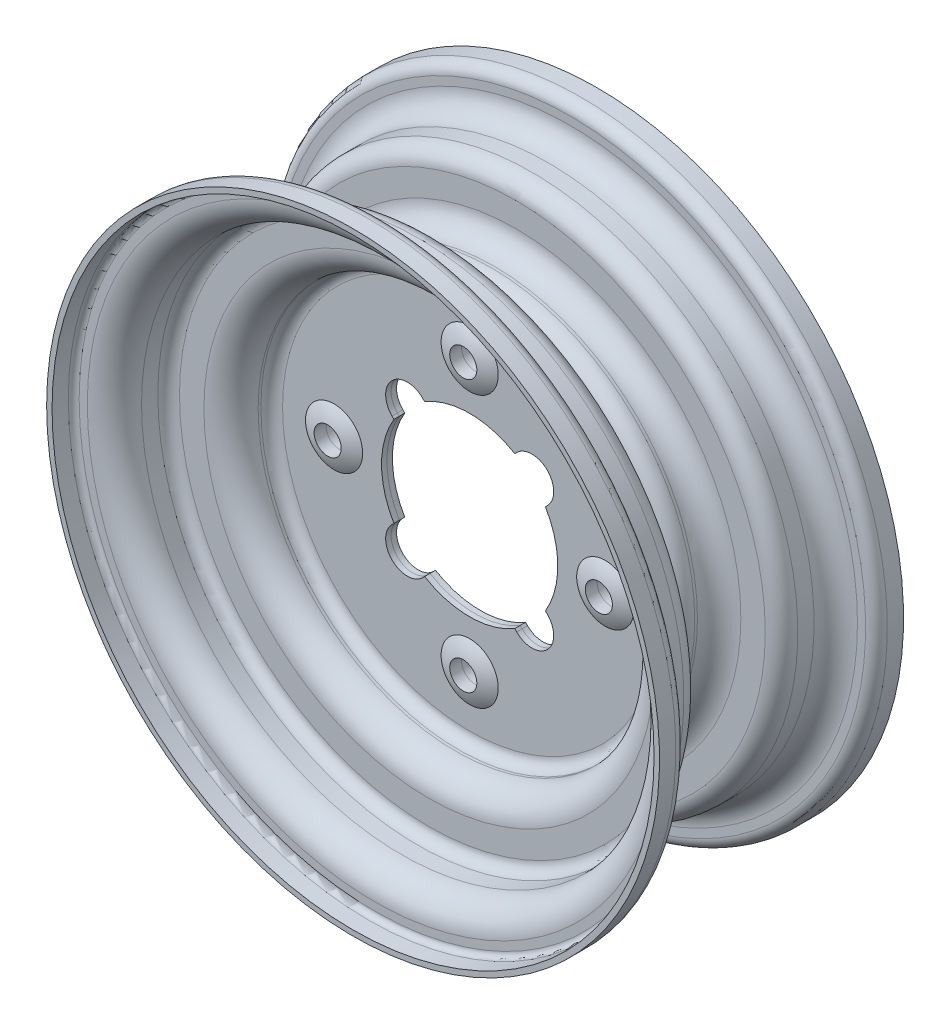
ISO-10303-21;
HEADER;
FILE_DESCRIPTION(('STEP AP214'),'2;1');
FILE_NAME('part.step','',(''),(''),'','','');
FILE_SCHEMA(('AUTOMOTIVE_DESIGN { 1 0 10303 214 1 1 1 1 }'));
ENDSEC;
DATA;
#1=APPLICATION_CONTEXT('core data for automotive mechanical design processes');
#2=APPLICATION_PROTOCOL_DEFINITION('international standard','automotive_design',2000,#1);
#3=PRODUCT_CONTEXT('',#1,'mechanical');
#4=PRODUCT('Part','Part','',(#3));
#5=PRODUCT_RELATED_PRODUCT_CATEGORY('part','',(#4));
#6=PRODUCT_DEFINITION_FORMATION('','',#4);
#7=PRODUCT_DEFINITION_CONTEXT('part definition',#1,'design');
#8=PRODUCT_DEFINITION('design','',#6,#7);
#9=PRODUCT_DEFINITION_SHAPE('','',#8);
#10=(LENGTH_UNIT() NAMED_UNIT(*) SI_UNIT(.MILLI.,.METRE.));
#11=(NAMED_UNIT(*) PLANE_ANGLE_UNIT() SI_UNIT($,.RADIAN.));
#12=(NAMED_UNIT(*) SI_UNIT($,.STERADIAN.) SOLID_ANGLE_UNIT());
#13=UNCERTAINTY_MEASURE_WITH_UNIT(LENGTH_MEASURE(1.E-05),#10,'distance_accuracy_value','');
#14=(GEOMETRIC_REPRESENTATION_CONTEXT(3) GLOBAL_UNCERTAINTY_ASSIGNED_CONTEXT((#13)) GLOBAL_UNIT_ASSIGNED_CONTEXT((#10,
#11,#12)) REPRESENTATION_CONTEXT('',''));
#15=CARTESIAN_POINT('',(0.,0.,0.));
#16=DIRECTION('',(0.,0.,1.));
#17=DIRECTION('',(1.,0.,0.));
#18=AXIS2_PLACEMENT_3D('',#15,#16,#17);
#19=CARTESIAN_POINT('',(0.,0.,-2.));
#20=DIRECTION('',(0.,0.,1.));
#21=DIRECTION('',(-1.,0.,0.));
#22=AXIS2_PLACEMENT_3D('',#19,#20,#21);
#23=PLANE('',#22);
#24=CARTESIAN_POINT('',(-5.23722504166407E-13,-50.,-2.00000000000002));
#25=DIRECTION('',(0.,0.,1.));
#26=DIRECTION('',(0.,1.,0.));
#27=AXIS2_PLACEMENT_3D('',#24,#25,#26);
#28=CIRCLE('',#27,10.5356537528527);
#29=CARTESIAN_POINT('',(-6.34077683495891E-13,-60.5356537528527,-2.00000000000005));
#30=VERTEX_POINT('',#29);
#31=EDGE_CURVE('E418',#30,#30,#28,.T.);
#32=ORIENTED_EDGE('',*,*,#31,.T.);
#33=EDGE_LOOP('',(#32));
#34=FACE_BOUND('',#33,.T.);
#35=CARTESIAN_POINT('',(50.,0.,-2.00000000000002));
#36=DIRECTION('',(0.,0.,1.));
#37=DIRECTION('',(-1.,0.,0.));
#38=AXIS2_PLACEMENT_3D('',#35,#36,#37);
#39=CIRCLE('',#38,10.5356537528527);
#40=CARTESIAN_POINT('',(60.5356537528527,0.,-2.00000000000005));
#41=VERTEX_POINT('',#40);
#42=EDGE_CURVE('E437',#41,#41,#39,.T.);
#43=ORIENTED_EDGE('',*,*,#42,.T.);
#44=EDGE_LOOP('',(#43));
#45=FACE_BOUND('',#44,.T.);
#46=CARTESIAN_POINT('',(1.74574168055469E-13,50.,-2.00000000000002));
#47=DIRECTION('',(0.,0.,1.));
#48=DIRECTION('',(0.,-1.,0.));
#49=AXIS2_PLACEMENT_3D('',#46,#47,#48);
#50=CIRCLE('',#49,10.5356537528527);
#51=CARTESIAN_POINT('',(2.11359227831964E-13,60.5356537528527,-2.00000000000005));
#52=VERTEX_POINT('',#51);
#53=EDGE_CURVE('E440',#52,#52,#50,.T.);
#54=ORIENTED_EDGE('',*,*,#53,.T.);
#55=EDGE_LOOP('',(#54));
#56=FACE_BOUND('',#55,.T.);
#57=CARTESIAN_POINT('',(-50.,0.,-2.00000000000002));
#58=DIRECTION('',(0.,0.,1.));
#59=DIRECTION('',(1.,0.,0.));
#60=AXIS2_PLACEMENT_3D('',#57,#58,#59);
#61=CIRCLE('',#60,10.5356537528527);
#62=CARTESIAN_POINT('',(-60.5356537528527,0.,-2.00000000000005));
#63=VERTEX_POINT('',#62);
#64=EDGE_CURVE('E260',#63,#63,#61,.T.);
#65=ORIENTED_EDGE('',*,*,#64,.T.);
#66=EDGE_LOOP('',(#65));
#67=FACE_BOUND('',#66,.T.);
#68=CARTESIAN_POINT('',(0.,0.,-2.));
#69=DIRECTION('',(0.,0.,-1.));
#70=DIRECTION('',(-1.,0.,0.));
#71=AXIS2_PLACEMENT_3D('',#68,#69,#70);
#72=CIRCLE('',#71,69.);
#73=CARTESIAN_POINT('',(-69.,0.,-2.));
#74=VERTEX_POINT('',#73);
#75=EDGE_CURVE('E380',#74,#74,#72,.T.);
#76=ORIENTED_EDGE('',*,*,#75,.T.);
#77=EDGE_LOOP('',(#76));
#78=FACE_BOUND('',#77,.T.);
#79=DIRECTION('',(-0.707106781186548,0.707106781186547,0.));
#80=VECTOR('',#79,1.);
#81=CARTESIAN_POINT('',(70.3138564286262,-81.6275649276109,-2.));
#82=LINE('',#81,#80);
#83=CARTESIAN_POINT('',(-27.9307178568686,16.6170093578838,-2.));
#84=VERTEX_POINT('',#83);
#85=CARTESIAN_POINT('',(-28.6378246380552,17.3241161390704,-2.));
#86=VERTEX_POINT('',#85);
#87=EDGE_CURVE('E253',#84,#86,#82,.T.);
#88=ORIENTED_EDGE('',*,*,#87,.F.);
#89=CARTESIAN_POINT('',(0.,0.,-2.));
#90=DIRECTION('',(0.,0.,1.));
#91=DIRECTION('',(1.,0.,0.));
#92=AXIS2_PLACEMENT_3D('',#89,#90,#91);
#93=CIRCLE('',#92,32.5);
#94=CARTESIAN_POINT('',(-27.9307178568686,-16.6170093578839,-2.));
#95=VERTEX_POINT('',#94);
#96=EDGE_CURVE('E350',#84,#95,#93,.T.);
#97=ORIENTED_EDGE('',*,*,#96,.T.);
#98=DIRECTION('',(0.707106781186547,0.707106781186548,0.));
#99=VECTOR('',#98,1.);
#100=CARTESIAN_POINT('',(-81.627564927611,-70.3138564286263,-2.));
#101=LINE('',#100,#99);
#102=CARTESIAN_POINT('',(-28.6378246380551,-17.3241161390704,-2.));
#103=VERTEX_POINT('',#102);
#104=EDGE_CURVE('E331',#103,#95,#101,.T.);
#105=ORIENTED_EDGE('',*,*,#104,.F.);
#106=CARTESIAN_POINT('',(-22.9809703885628,-22.9809703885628,-2.));
#107=DIRECTION('',(0.,0.,1.));
#108=DIRECTION('',(1.,0.,0.));
#109=AXIS2_PLACEMENT_3D('',#106,#107,#108);
#110=CIRCLE('',#109,8.);
#111=CARTESIAN_POINT('',(-17.3241161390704,-28.6378246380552,-2.));
#112=VERTEX_POINT('',#111);
#113=EDGE_CURVE('E334',#103,#112,#110,.T.);
#114=ORIENTED_EDGE('',*,*,#113,.T.);
#115=DIRECTION('',(0.707106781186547,0.707106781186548,0.));
#116=VECTOR('',#115,1.);
#117=CARTESIAN_POINT('',(-70.3138564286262,-81.6275649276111,-2.));
#118=LINE('',#117,#116);
#119=CARTESIAN_POINT('',(-16.6170093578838,-27.9307178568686,-2.));
#120=VERTEX_POINT('',#119);
#121=EDGE_CURVE('E325',#112,#120,#118,.T.);
#122=ORIENTED_EDGE('',*,*,#121,.T.);
#123=CARTESIAN_POINT('',(16.6170093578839,-27.9307178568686,-2.));
#124=VERTEX_POINT('',#123);
#125=EDGE_CURVE('E346',#120,#124,#93,.T.);
#126=ORIENTED_EDGE('',*,*,#125,.T.);
#127=DIRECTION('',(-0.707106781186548,0.707106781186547,0.));
#128=VECTOR('',#127,1.);
#129=CARTESIAN_POINT('',(70.3138564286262,-81.6275649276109,-2.));
#130=LINE('',#129,#128);
#131=CARTESIAN_POINT('',(17.3241161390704,-28.6378246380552,-2.));
#132=VERTEX_POINT('',#131);
#133=EDGE_CURVE('E308',#132,#124,#130,.T.);
#134=ORIENTED_EDGE('',*,*,#133,.F.);
#135=CARTESIAN_POINT('',(22.9809703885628,-22.9809703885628,-2.));
#136=DIRECTION('',(0.,0.,1.));
#137=DIRECTION('',(1.,0.,0.));
#138=AXIS2_PLACEMENT_3D('',#135,#136,#137);
#139=CIRCLE('',#138,8.00000000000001);
#140=CARTESIAN_POINT('',(28.6378246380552,-17.3241161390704,-2.));
#141=VERTEX_POINT('',#140);
#142=EDGE_CURVE('E310',#132,#141,#139,.T.);
#143=ORIENTED_EDGE('',*,*,#142,.T.);
#144=DIRECTION('',(-0.707106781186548,0.707106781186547,0.));
#145=VECTOR('',#144,1.);
#146=CARTESIAN_POINT('',(81.627564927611,-70.3138564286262,-2.));
#147=LINE('',#146,#145);
#148=CARTESIAN_POINT('',(27.9307178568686,-16.6170093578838,-2.));
#149=VERTEX_POINT('',#148);
#150=EDGE_CURVE('E302',#141,#149,#147,.T.);
#151=ORIENTED_EDGE('',*,*,#150,.T.);
#152=CARTESIAN_POINT('',(27.9307178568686,16.6170093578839,-2.));
#153=VERTEX_POINT('',#152);
#154=EDGE_CURVE('E349',#149,#153,#93,.T.);
#155=ORIENTED_EDGE('',*,*,#154,.T.);
#156=DIRECTION('',(0.707106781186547,0.707106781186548,0.));
#157=VECTOR('',#156,1.);
#158=CARTESIAN_POINT('',(-70.3138564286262,-81.6275649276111,-2.));
#159=LINE('',#158,#157);
#160=CARTESIAN_POINT('',(28.6378246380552,17.3241161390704,-2.));
#161=VERTEX_POINT('',#160);
#162=EDGE_CURVE('E283',#153,#161,#159,.T.);
#163=ORIENTED_EDGE('',*,*,#162,.T.);
#164=CARTESIAN_POINT('',(22.9809703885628,22.9809703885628,-2.));
#165=DIRECTION('',(0.,0.,1.));
#166=DIRECTION('',(1.,0.,0.));
#167=AXIS2_PLACEMENT_3D('',#164,#165,#166);
#168=CIRCLE('',#167,8.);
#169=CARTESIAN_POINT('',(17.3241161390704,28.6378246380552,-2.));
#170=VERTEX_POINT('',#169);
#171=EDGE_CURVE('E286',#161,#170,#168,.T.);
#172=ORIENTED_EDGE('',*,*,#171,.T.);
#173=DIRECTION('',(0.707106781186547,0.707106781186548,0.));
#174=VECTOR('',#173,1.);
#175=CARTESIAN_POINT('',(-81.627564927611,-70.3138564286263,-2.));
#176=LINE('',#175,#174);
#177=CARTESIAN_POINT('',(16.6170093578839,27.9307178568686,-2.));
#178=VERTEX_POINT('',#177);
#179=EDGE_CURVE('E277',#178,#170,#176,.T.);
#180=ORIENTED_EDGE('',*,*,#179,.F.);
#181=CARTESIAN_POINT('',(-16.6170093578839,27.9307178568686,-2.));
#182=VERTEX_POINT('',#181);
#183=EDGE_CURVE('E555',#178,#182,#93,.T.);
#184=ORIENTED_EDGE('',*,*,#183,.T.);
#185=DIRECTION('',(-0.707106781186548,0.707106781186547,0.));
#186=VECTOR('',#185,1.);
#187=CARTESIAN_POINT('',(81.627564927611,-70.3138564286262,-2.));
#188=LINE('',#187,#186);
#189=CARTESIAN_POINT('',(-17.3241161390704,28.6378246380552,-2.));
#190=VERTEX_POINT('',#189);
#191=EDGE_CURVE('E232',#182,#190,#188,.T.);
#192=ORIENTED_EDGE('',*,*,#191,.T.);
#193=CARTESIAN_POINT('',(-22.9809703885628,22.9809703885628,-2.));
#194=DIRECTION('',(0.,0.,1.));
#195=DIRECTION('',(1.,0.,0.));
#196=AXIS2_PLACEMENT_3D('',#193,#194,#195);
#197=CIRCLE('',#196,8.00000000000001);
#198=EDGE_CURVE('E257',#190,#86,#197,.T.);
#199=ORIENTED_EDGE('',*,*,#198,.T.);
#200=EDGE_LOOP('',(#88,#97,#105,#114,#122,#126,#134,#143,#151,#155,#163,#172,#180,#184,#192,#199));
#201=FACE_BOUND('',#200,.T.);
#202=ADVANCED_FACE('F108',(#34,#45,#56,#67,#78,#201),#23,.F.);
#203=CARTESIAN_POINT('',(0.,0.,0.));
#204=DIRECTION('',(0.,0.,1.));
#205=DIRECTION('',(-1.,0.,0.));
#206=AXIS2_PLACEMENT_3D('',#203,#204,#205);
#207=PLANE('',#206);
#208=CARTESIAN_POINT('',(-5.23722504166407E-13,-50.,0.));
#209=DIRECTION('',(0.,0.,1.));
#210=DIRECTION('',(0.,1.,0.));
#211=AXIS2_PLACEMENT_3D('',#208,#209,#210);
#212=CIRCLE('',#211,5.);
#213=CARTESIAN_POINT('',(-4.71350253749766E-13,-45.,0.));
#214=VERTEX_POINT('',#213);
#215=EDGE_CURVE('E432',#214,#214,#212,.T.);
#216=ORIENTED_EDGE('',*,*,#215,.F.);
#217=EDGE_LOOP('',(#216));
#218=FACE_BOUND('',#217,.T.);
#219=CARTESIAN_POINT('',(50.,0.,0.));
#220=DIRECTION('',(0.,0.,1.));
#221=DIRECTION('',(-1.,0.,0.));
#222=AXIS2_PLACEMENT_3D('',#219,#220,#221);
#223=CIRCLE('',#222,5.);
#224=CARTESIAN_POINT('',(45.,0.,0.));
#225=VERTEX_POINT('',#224);
#226=EDGE_CURVE('E422',#225,#225,#223,.T.);
#227=ORIENTED_EDGE('',*,*,#226,.F.);
#228=EDGE_LOOP('',(#227));
#229=FACE_BOUND('',#228,.T.);
#230=CARTESIAN_POINT('',(1.74574168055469E-13,50.,0.));
#231=DIRECTION('',(0.,0.,1.));
#232=DIRECTION('',(0.,-1.,0.));
#233=AXIS2_PLACEMENT_3D('',#230,#231,#232);
#234=CIRCLE('',#233,5.);
#235=CARTESIAN_POINT('',(1.57116751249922E-13,45.,0.));
#236=VERTEX_POINT('',#235);
#237=EDGE_CURVE('E419',#236,#236,#234,.T.);
#238=ORIENTED_EDGE('',*,*,#237,.F.);
#239=EDGE_LOOP('',(#238));
#240=FACE_BOUND('',#239,.T.);
#241=CARTESIAN_POINT('',(-50.,0.,0.));
#242=DIRECTION('',(0.,0.,1.));
#243=DIRECTION('',(1.,0.,0.));
#244=AXIS2_PLACEMENT_3D('',#241,#242,#243);
#245=CIRCLE('',#244,5.);
#246=CARTESIAN_POINT('',(-45.,0.,0.));
#247=VERTEX_POINT('',#246);
#248=EDGE_CURVE('E415',#247,#247,#245,.T.);
#249=ORIENTED_EDGE('',*,*,#248,.F.);
#250=EDGE_LOOP('',(#249));
#251=FACE_BOUND('',#250,.T.);
#252=CARTESIAN_POINT('',(0.,0.,0.));
#253=DIRECTION('',(0.,0.,-1.));
#254=DIRECTION('',(-1.,0.,0.));
#255=AXIS2_PLACEMENT_3D('',#252,#253,#254);
#256=CIRCLE('',#255,68.9999999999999);
#257=CARTESIAN_POINT('',(-68.9999999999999,0.,0.));
#258=VERTEX_POINT('',#257);
#259=EDGE_CURVE('E377',#258,#258,#256,.T.);
#260=ORIENTED_EDGE('',*,*,#259,.F.);
#261=EDGE_LOOP('',(#260));
#262=FACE_BOUND('',#261,.T.);
#263=CARTESIAN_POINT('',(-22.9809703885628,22.9809703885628,0.));
#264=DIRECTION('',(0.,0.,1.));
#265=DIRECTION('',(1.,0.,0.));
#266=AXIS2_PLACEMENT_3D('',#263,#264,#265);
#267=CIRCLE('',#266,8.00000000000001);
#268=CARTESIAN_POINT('',(-17.3241161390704,28.6378246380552,0.));
#269=VERTEX_POINT('',#268);
#270=CARTESIAN_POINT('',(-28.6378246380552,17.3241161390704,0.));
#271=VERTEX_POINT('',#270);
#272=EDGE_CURVE('E252',#269,#271,#267,.T.);
#273=ORIENTED_EDGE('',*,*,#272,.F.);
#274=DIRECTION('',(-0.707106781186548,0.707106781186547,0.));
#275=VECTOR('',#274,1.);
#276=CARTESIAN_POINT('',(81.627564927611,-70.3138564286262,0.));
#277=LINE('',#276,#275);
#278=CARTESIAN_POINT('',(-16.6170093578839,27.9307178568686,0.));
#279=VERTEX_POINT('',#278);
#280=EDGE_CURVE('E229',#279,#269,#277,.T.);
#281=ORIENTED_EDGE('',*,*,#280,.F.);
#282=CARTESIAN_POINT('',(0.,0.,0.));
#283=DIRECTION('',(0.,0.,1.));
#284=DIRECTION('',(1.,0.,0.));
#285=AXIS2_PLACEMENT_3D('',#282,#283,#284);
#286=CIRCLE('',#285,32.5);
#287=CARTESIAN_POINT('',(16.6170093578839,27.9307178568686,0.));
#288=VERTEX_POINT('',#287);
#289=EDGE_CURVE('E240',#288,#279,#286,.T.);
#290=ORIENTED_EDGE('',*,*,#289,.F.);
#291=DIRECTION('',(0.707106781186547,0.707106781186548,0.));
#292=VECTOR('',#291,1.);
#293=CARTESIAN_POINT('',(-81.627564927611,-70.3138564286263,0.));
#294=LINE('',#293,#292);
#295=CARTESIAN_POINT('',(17.3241161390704,28.6378246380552,0.));
#296=VERTEX_POINT('',#295);
#297=EDGE_CURVE('E280',#288,#296,#294,.T.);
#298=ORIENTED_EDGE('',*,*,#297,.T.);
#299=CARTESIAN_POINT('',(22.9809703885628,22.9809703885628,0.));
#300=DIRECTION('',(0.,0.,1.));
#301=DIRECTION('',(1.,0.,0.));
#302=AXIS2_PLACEMENT_3D('',#299,#300,#301);
#303=CIRCLE('',#302,8.);
#304=CARTESIAN_POINT('',(28.6378246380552,17.3241161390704,0.));
#305=VERTEX_POINT('',#304);
#306=EDGE_CURVE('E276',#305,#296,#303,.T.);
#307=ORIENTED_EDGE('',*,*,#306,.F.);
#308=DIRECTION('',(0.707106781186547,0.707106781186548,0.));
#309=VECTOR('',#308,1.);
#310=CARTESIAN_POINT('',(-70.3138564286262,-81.6275649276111,0.));
#311=LINE('',#310,#309);
#312=CARTESIAN_POINT('',(27.9307178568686,16.6170093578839,0.));
#313=VERTEX_POINT('',#312);
#314=EDGE_CURVE('E273',#313,#305,#311,.T.);
#315=ORIENTED_EDGE('',*,*,#314,.F.);
#316=CARTESIAN_POINT('',(27.9307178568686,-16.6170093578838,0.));
#317=VERTEX_POINT('',#316);
#318=EDGE_CURVE('E246',#317,#313,#286,.T.);
#319=ORIENTED_EDGE('',*,*,#318,.F.);
#320=DIRECTION('',(-0.707106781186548,0.707106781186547,0.));
#321=VECTOR('',#320,1.);
#322=CARTESIAN_POINT('',(81.627564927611,-70.3138564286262,0.));
#323=LINE('',#322,#321);
#324=CARTESIAN_POINT('',(28.6378246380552,-17.3241161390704,0.));
#325=VERTEX_POINT('',#324);
#326=EDGE_CURVE('E305',#325,#317,#323,.T.);
#327=ORIENTED_EDGE('',*,*,#326,.F.);
#328=CARTESIAN_POINT('',(22.9809703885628,-22.9809703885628,0.));
#329=DIRECTION('',(0.,0.,1.));
#330=DIRECTION('',(1.,0.,0.));
#331=AXIS2_PLACEMENT_3D('',#328,#329,#330);
#332=CIRCLE('',#331,8.00000000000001);
#333=CARTESIAN_POINT('',(17.3241161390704,-28.6378246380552,0.));
#334=VERTEX_POINT('',#333);
#335=EDGE_CURVE('E301',#334,#325,#332,.T.);
#336=ORIENTED_EDGE('',*,*,#335,.F.);
#337=DIRECTION('',(-0.707106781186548,0.707106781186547,0.));
#338=VECTOR('',#337,1.);
#339=CARTESIAN_POINT('',(70.3138564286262,-81.6275649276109,0.));
#340=LINE('',#339,#338);
#341=CARTESIAN_POINT('',(16.6170093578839,-27.9307178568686,0.));
#342=VERTEX_POINT('',#341);
#343=EDGE_CURVE('E298',#334,#342,#340,.T.);
#344=ORIENTED_EDGE('',*,*,#343,.T.);
#345=CARTESIAN_POINT('',(-16.6170093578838,-27.9307178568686,0.));
#346=VERTEX_POINT('',#345);
#347=EDGE_CURVE('E335',#346,#342,#286,.T.);
#348=ORIENTED_EDGE('',*,*,#347,.F.);
#349=DIRECTION('',(0.707106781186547,0.707106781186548,0.));
#350=VECTOR('',#349,1.);
#351=CARTESIAN_POINT('',(-70.3138564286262,-81.6275649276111,0.));
#352=LINE('',#351,#350);
#353=CARTESIAN_POINT('',(-17.3241161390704,-28.6378246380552,0.));
#354=VERTEX_POINT('',#353);
#355=EDGE_CURVE('E328',#354,#346,#352,.T.);
#356=ORIENTED_EDGE('',*,*,#355,.F.);
#357=CARTESIAN_POINT('',(-22.9809703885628,-22.9809703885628,0.));
#358=DIRECTION('',(0.,0.,1.));
#359=DIRECTION('',(1.,0.,0.));
#360=AXIS2_PLACEMENT_3D('',#357,#358,#359);
#361=CIRCLE('',#360,8.);
#362=CARTESIAN_POINT('',(-28.6378246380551,-17.3241161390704,0.));
#363=VERTEX_POINT('',#362);
#364=EDGE_CURVE('E324',#363,#354,#361,.T.);
#365=ORIENTED_EDGE('',*,*,#364,.F.);
#366=DIRECTION('',(0.707106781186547,0.707106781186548,0.));
#367=VECTOR('',#366,1.);
#368=CARTESIAN_POINT('',(-81.627564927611,-70.3138564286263,0.));
#369=LINE('',#368,#367);
#370=CARTESIAN_POINT('',(-27.9307178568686,-16.6170093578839,0.));
#371=VERTEX_POINT('',#370);
#372=EDGE_CURVE('E321',#363,#371,#369,.T.);
#373=ORIENTED_EDGE('',*,*,#372,.T.);
#374=CARTESIAN_POINT('',(-27.9307178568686,16.6170093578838,0.));
#375=VERTEX_POINT('',#374);
#376=EDGE_CURVE('E247',#375,#371,#286,.T.);
#377=ORIENTED_EDGE('',*,*,#376,.F.);
#378=DIRECTION('',(-0.707106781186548,0.707106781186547,0.));
#379=VECTOR('',#378,1.);
#380=CARTESIAN_POINT('',(70.3138564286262,-81.6275649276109,0.));
#381=LINE('',#380,#379);
#382=EDGE_CURVE('E237',#375,#271,#381,.T.);
#383=ORIENTED_EDGE('',*,*,#382,.T.);
#384=EDGE_LOOP('',(#273,#281,#290,#298,#307,#315,#319,#327,#336,#344,#348,#356,#365,#373,#377,#383));
#385=FACE_BOUND('',#384,.T.);
#386=ADVANCED_FACE('F249',(#218,#229,#240,#251,#262,#385),#207,.T.);
#387=CARTESIAN_POINT('',(0.,0.,0.));
#388=DIRECTION('',(0.,0.,1.));
#389=DIRECTION('',(-1.,0.,0.));
#390=AXIS2_PLACEMENT_3D('',#387,#388,#389);
#391=CYLINDRICAL_SURFACE('',#390,113.);
#392=CARTESIAN_POINT('',(0.,0.,-45.));
#393=DIRECTION('',(0.,0.,-1.));
#394=DIRECTION('',(-1.,0.,0.));
#395=AXIS2_PLACEMENT_3D('',#392,#393,#394);
#396=CIRCLE('',#395,113.);
#397=CARTESIAN_POINT('',(-113.,0.,-45.));
#398=VERTEX_POINT('',#397);
#399=EDGE_CURVE('E13',#398,#398,#396,.T.);
#400=ORIENTED_EDGE('',*,*,#399,.F.);
#401=EDGE_LOOP('',(#400));
#402=FACE_BOUND('',#401,.T.);
#403=CARTESIAN_POINT('',(0.,0.,-39.));
#404=DIRECTION('',(0.,0.,-1.));
#405=DIRECTION('',(-1.,0.,0.));
#406=AXIS2_PLACEMENT_3D('',#403,#404,#405);
#407=CIRCLE('',#406,113.);
#408=CARTESIAN_POINT('',(-113.,0.,-39.));
#409=VERTEX_POINT('',#408);
#410=EDGE_CURVE('E269',#409,#409,#407,.T.);
#411=ORIENTED_EDGE('',*,*,#410,.T.);
#412=EDGE_LOOP('',(#411));
#413=FACE_BOUND('',#412,.T.);
#414=ADVANCED_FACE('F110',(#402,#413),#391,.T.);
#415=CARTESIAN_POINT('',(0.,111.,-45.));
#416=DIRECTION('',(0.,0.,1.));
#417=DIRECTION('',(-1.,0.,0.));
#418=AXIS2_PLACEMENT_3D('',#415,#416,#417);
#419=PLANE('',#418);
#420=ORIENTED_EDGE('',*,*,#399,.T.);
#421=EDGE_LOOP('',(#420));
#422=FACE_BOUND('',#421,.T.);
#423=CARTESIAN_POINT('',(0.,0.,-45.));
#424=DIRECTION('',(0.,0.,-1.));
#425=DIRECTION('',(-1.,0.,0.));
#426=AXIS2_PLACEMENT_3D('',#423,#424,#425);
#427=CIRCLE('',#426,111.);
#428=CARTESIAN_POINT('',(-111.,0.,-45.));
#429=VERTEX_POINT('',#428);
#430=EDGE_CURVE('E117',#429,#429,#427,.T.);
#431=ORIENTED_EDGE('',*,*,#430,.F.);
#432=EDGE_LOOP('',(#431));
#433=FACE_BOUND('',#432,.T.);
#434=ADVANCED_FACE('F510',(#422,#433),#419,.F.);
#435=CARTESIAN_POINT('',(0.,0.,0.));
#436=DIRECTION('',(0.,0.,1.));
#437=DIRECTION('',(-1.,0.,0.));
#438=AXIS2_PLACEMENT_3D('',#435,#436,#437);
#439=CYLINDRICAL_SURFACE('',#438,111.);
#440=ORIENTED_EDGE('',*,*,#430,.T.);
#441=EDGE_LOOP('',(#440));
#442=FACE_BOUND('',#441,.T.);
#443=CARTESIAN_POINT('',(0.,0.,-39.));
#444=DIRECTION('',(0.,0.,-1.));
#445=DIRECTION('',(-1.,0.,0.));
#446=AXIS2_PLACEMENT_3D('',#443,#444,#445);
#447=CIRCLE('',#446,111.);
#448=CARTESIAN_POINT('',(-111.,0.,-39.));
#449=VERTEX_POINT('',#448);
#450=EDGE_CURVE('E407',#449,#449,#447,.T.);
#451=ORIENTED_EDGE('',*,*,#450,.F.);
#452=EDGE_LOOP('',(#451));
#453=FACE_BOUND('',#452,.T.);
#454=ADVANCED_FACE('F507',(#442,#453),#439,.F.);
#455=CARTESIAN_POINT('',(0.,0.,-39.));
#456=DIRECTION('',(0.,0.,1.));
#457=DIRECTION('',(-1.,0.,0.));
#458=AXIS2_PLACEMENT_3D('',#455,#456,#457);
#459=TOROIDAL_SURFACE('',#458,109.,2.);
#460=ORIENTED_EDGE('',*,*,#450,.T.);
#461=EDGE_LOOP('',(#460));
#462=FACE_BOUND('',#461,.T.);
#463=CARTESIAN_POINT('',(0.,0.,-37.));
#464=DIRECTION('',(0.,0.,-1.));
#465=DIRECTION('',(-1.,0.,0.));
#466=AXIS2_PLACEMENT_3D('',#463,#464,#465);
#467=CIRCLE('',#466,109.);
#468=CARTESIAN_POINT('',(-109.,0.,-37.));
#469=VERTEX_POINT('',#468);
#470=EDGE_CURVE('E404',#469,#469,#467,.T.);
#471=ORIENTED_EDGE('',*,*,#470,.F.);
#472=EDGE_LOOP('',(#471));
#473=FACE_BOUND('',#472,.T.);
#474=ADVANCED_FACE('F503',(#462,#473),#459,.F.);
#475=CARTESIAN_POINT('',(0.,106.,-37.));
#476=DIRECTION('',(0.,0.,1.));
#477=DIRECTION('',(-1.,0.,0.));
#478=AXIS2_PLACEMENT_3D('',#475,#476,#477);
#479=PLANE('',#478);
#480=ORIENTED_EDGE('',*,*,#470,.T.);
#481=EDGE_LOOP('',(#480));
#482=FACE_BOUND('',#481,.T.);
#483=CARTESIAN_POINT('',(0.,0.,-37.));
#484=DIRECTION('',(0.,0.,-1.));
#485=DIRECTION('',(-1.,0.,0.));
#486=AXIS2_PLACEMENT_3D('',#483,#484,#485);
#487=CIRCLE('',#486,106.);
#488=CARTESIAN_POINT('',(-106.,0.,-37.));
#489=VERTEX_POINT('',#488);
#490=EDGE_CURVE('E401',#489,#489,#487,.T.);
#491=ORIENTED_EDGE('',*,*,#490,.F.);
#492=EDGE_LOOP('',(#491));
#493=FACE_BOUND('',#492,.T.);
#494=ADVANCED_FACE('F499',(#482,#493),#479,.F.);
#495=CARTESIAN_POINT('',(0.,0.,-27.));
#496=DIRECTION('',(0.,0.,1.));
#497=DIRECTION('',(-1.,0.,0.));
#498=AXIS2_PLACEMENT_3D('',#495,#496,#497);
#499=TOROIDAL_SURFACE('',#498,106.,10.);
#500=ORIENTED_EDGE('',*,*,#490,.T.);
#501=EDGE_LOOP('',(#500));
#502=FACE_BOUND('',#501,.T.);
#503=CARTESIAN_POINT('',(0.,0.,-26.9999999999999));
#504=DIRECTION('',(0.,0.,-1.));
#505=DIRECTION('',(-1.,0.,0.));
#506=AXIS2_PLACEMENT_3D('',#503,#504,#505);
#507=CIRCLE('',#506,96.);
#508=CARTESIAN_POINT('',(-96.,0.,-26.9999999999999));
#509=VERTEX_POINT('',#508);
#510=EDGE_CURVE('E398',#509,#509,#507,.T.);
#511=ORIENTED_EDGE('',*,*,#510,.F.);
#512=EDGE_LOOP('',(#511));
#513=FACE_BOUND('',#512,.T.);
#514=ADVANCED_FACE('F495',(#502,#513),#499,.T.);
#515=CARTESIAN_POINT('',(0.,0.,0.));
#516=DIRECTION('',(0.,0.,1.));
#517=DIRECTION('',(-1.,0.,0.));
#518=AXIS2_PLACEMENT_3D('',#515,#516,#517);
#519=CYLINDRICAL_SURFACE('',#518,96.);
#520=ORIENTED_EDGE('',*,*,#510,.T.);
#521=EDGE_LOOP('',(#520));
#522=FACE_BOUND('',#521,.T.);
#523=CARTESIAN_POINT('',(0.,0.,-21.));
#524=DIRECTION('',(0.,0.,-1.));
#525=DIRECTION('',(-1.,0.,0.));
#526=AXIS2_PLACEMENT_3D('',#523,#524,#525);
#527=CIRCLE('',#526,96.);
#528=CARTESIAN_POINT('',(-96.,0.,-21.));
#529=VERTEX_POINT('',#528);
#530=EDGE_CURVE('E395',#529,#529,#527,.T.);
#531=ORIENTED_EDGE('',*,*,#530,.F.);
#532=EDGE_LOOP('',(#531));
#533=FACE_BOUND('',#532,.T.);
#534=ADVANCED_FACE('F491',(#522,#533),#519,.F.);
#535=CARTESIAN_POINT('',(0.,0.,-21.));
#536=DIRECTION('',(0.,0.,1.));
#537=DIRECTION('',(-1.,0.,0.));
#538=AXIS2_PLACEMENT_3D('',#535,#536,#537);
#539=TOROIDAL_SURFACE('',#538,92.,3.99999999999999);
#540=ORIENTED_EDGE('',*,*,#530,.T.);
#541=EDGE_LOOP('',(#540));
#542=FACE_BOUND('',#541,.T.);
#543=CARTESIAN_POINT('',(0.,0.,-17.));
#544=DIRECTION('',(0.,0.,-1.));
#545=DIRECTION('',(-1.,0.,0.));
#546=AXIS2_PLACEMENT_3D('',#543,#544,#545);
#547=CIRCLE('',#546,92.);
#548=CARTESIAN_POINT('',(-92.,0.,-17.));
#549=VERTEX_POINT('',#548);
#550=EDGE_CURVE('E392',#549,#549,#547,.T.);
#551=ORIENTED_EDGE('',*,*,#550,.F.);
#552=EDGE_LOOP('',(#551));
#553=FACE_BOUND('',#552,.T.);
#554=ADVANCED_FACE('F487',(#542,#553),#539,.F.);
#555=CARTESIAN_POINT('',(0.,83.,-17.));
#556=DIRECTION('',(0.,0.,1.));
#557=DIRECTION('',(-1.,0.,0.));
#558=AXIS2_PLACEMENT_3D('',#555,#556,#557);
#559=PLANE('',#558);
#560=ORIENTED_EDGE('',*,*,#550,.T.);
#561=EDGE_LOOP('',(#560));
#562=FACE_BOUND('',#561,.T.);
#563=CARTESIAN_POINT('',(0.,0.,-17.));
#564=DIRECTION('',(0.,0.,-1.));
#565=DIRECTION('',(-1.,0.,0.));
#566=AXIS2_PLACEMENT_3D('',#563,#564,#565);
#567=CIRCLE('',#566,83.);
#568=CARTESIAN_POINT('',(-83.,0.,-17.));
#569=VERTEX_POINT('',#568);
#570=EDGE_CURVE('E389',#569,#569,#567,.T.);
#571=ORIENTED_EDGE('',*,*,#570,.F.);
#572=EDGE_LOOP('',(#571));
#573=FACE_BOUND('',#572,.T.);
#574=ADVANCED_FACE('F483',(#562,#573),#559,.F.);
#575=CARTESIAN_POINT('',(0.,0.,-7.));
#576=DIRECTION('',(0.,0.,1.));
#577=DIRECTION('',(-1.,0.,0.));
#578=AXIS2_PLACEMENT_3D('',#575,#576,#577);
#579=TOROIDAL_SURFACE('',#578,83.,10.);
#580=ORIENTED_EDGE('',*,*,#570,.T.);
#581=EDGE_LOOP('',(#580));
#582=FACE_BOUND('',#581,.T.);
#583=CARTESIAN_POINT('',(0.,0.,-6.99999999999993));
#584=DIRECTION('',(0.,0.,-1.));
#585=DIRECTION('',(-1.,0.,0.));
#586=AXIS2_PLACEMENT_3D('',#583,#584,#585);
#587=CIRCLE('',#586,73.);
#588=CARTESIAN_POINT('',(-73.,0.,-6.99999999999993));
#589=VERTEX_POINT('',#588);
#590=EDGE_CURVE('E386',#589,#589,#587,.T.);
#591=ORIENTED_EDGE('',*,*,#590,.F.);
#592=EDGE_LOOP('',(#591));
#593=FACE_BOUND('',#592,.T.);
#594=ADVANCED_FACE('F479',(#582,#593),#579,.T.);
#595=CARTESIAN_POINT('',(0.,0.,0.));
#596=DIRECTION('',(0.,0.,1.));
#597=DIRECTION('',(-1.,0.,0.));
#598=AXIS2_PLACEMENT_3D('',#595,#596,#597);
#599=CYLINDRICAL_SURFACE('',#598,73.);
#600=ORIENTED_EDGE('',*,*,#590,.T.);
#601=EDGE_LOOP('',(#600));
#602=FACE_BOUND('',#601,.T.);
#603=CARTESIAN_POINT('',(0.,0.,-6.00000000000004));
#604=DIRECTION('',(0.,0.,-1.));
#605=DIRECTION('',(-1.,0.,0.));
#606=AXIS2_PLACEMENT_3D('',#603,#604,#605);
#607=CIRCLE('',#606,73.);
#608=CARTESIAN_POINT('',(-73.,0.,-6.00000000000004));
#609=VERTEX_POINT('',#608);
#610=EDGE_CURVE('E383',#609,#609,#607,.T.);
#611=ORIENTED_EDGE('',*,*,#610,.F.);
#612=EDGE_LOOP('',(#611));
#613=FACE_BOUND('',#612,.T.);
#614=ADVANCED_FACE('F466',(#602,#613),#599,.F.);
#615=CARTESIAN_POINT('',(0.,0.,-6.));
#616=DIRECTION('',(0.,0.,1.));
#617=DIRECTION('',(-1.,0.,0.));
#618=AXIS2_PLACEMENT_3D('',#615,#616,#617);
#619=TOROIDAL_SURFACE('',#618,69.,4.);
#620=ORIENTED_EDGE('',*,*,#610,.T.);
#621=EDGE_LOOP('',(#620));
#622=FACE_BOUND('',#621,.T.);
#623=ORIENTED_EDGE('',*,*,#75,.F.);
#624=EDGE_LOOP('',(#623));
#625=FACE_BOUND('',#624,.T.);
#626=ADVANCED_FACE('F456',(#622,#625),#619,.F.);
#627=CARTESIAN_POINT('',(0.,0.,-6.));
#628=DIRECTION('',(0.,0.,1.));
#629=DIRECTION('',(-1.,0.,0.));
#630=AXIS2_PLACEMENT_3D('',#627,#628,#629);
#631=TOROIDAL_SURFACE('',#630,69.,6.);
#632=CARTESIAN_POINT('',(0.,0.,-6.00000000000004));
#633=DIRECTION('',(0.,0.,-1.));
#634=DIRECTION('',(-1.,0.,0.));
#635=AXIS2_PLACEMENT_3D('',#632,#633,#634);
#636=CIRCLE('',#635,75.);
#637=CARTESIAN_POINT('',(-75.,0.,-6.00000000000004));
#638=VERTEX_POINT('',#637);
#639=EDGE_CURVE('E374',#638,#638,#636,.T.);
#640=ORIENTED_EDGE('',*,*,#639,.F.);
#641=EDGE_LOOP('',(#640));
#642=FACE_BOUND('',#641,.T.);
#643=ORIENTED_EDGE('',*,*,#259,.T.);
#644=EDGE_LOOP('',(#643));
#645=FACE_BOUND('',#644,.T.);
#646=ADVANCED_FACE('F453',(#642,#645),#631,.T.);
#647=CARTESIAN_POINT('',(0.,0.,0.));
#648=DIRECTION('',(0.,0.,1.));
#649=DIRECTION('',(-1.,0.,0.));
#650=AXIS2_PLACEMENT_3D('',#647,#648,#649);
#651=CYLINDRICAL_SURFACE('',#650,75.);
#652=CARTESIAN_POINT('',(0.,0.,-6.99999999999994));
#653=DIRECTION('',(0.,0.,-1.));
#654=DIRECTION('',(-1.,0.,0.));
#655=AXIS2_PLACEMENT_3D('',#652,#653,#654);
#656=CIRCLE('',#655,75.);
#657=CARTESIAN_POINT('',(-75.,0.,-6.99999999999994));
#658=VERTEX_POINT('',#657);
#659=EDGE_CURVE('E371',#658,#658,#656,.T.);
#660=ORIENTED_EDGE('',*,*,#659,.F.);
#661=EDGE_LOOP('',(#660));
#662=FACE_BOUND('',#661,.T.);
#663=ORIENTED_EDGE('',*,*,#639,.T.);
#664=EDGE_LOOP('',(#663));
#665=FACE_BOUND('',#664,.T.);
#666=ADVANCED_FACE('F455',(#662,#665),#651,.T.);
#667=CARTESIAN_POINT('',(0.,0.,-7.));
#668=DIRECTION('',(0.,0.,1.));
#669=DIRECTION('',(-1.,0.,0.));
#670=AXIS2_PLACEMENT_3D('',#667,#668,#669);
#671=TOROIDAL_SURFACE('',#670,83.,8.);
#672=CARTESIAN_POINT('',(0.,0.,-15.));
#673=DIRECTION('',(0.,0.,-1.));
#674=DIRECTION('',(-1.,0.,0.));
#675=AXIS2_PLACEMENT_3D('',#672,#673,#674);
#676=CIRCLE('',#675,83.);
#677=CARTESIAN_POINT('',(-83.,0.,-15.));
#678=VERTEX_POINT('',#677);
#679=EDGE_CURVE('E368',#678,#678,#676,.T.);
#680=ORIENTED_EDGE('',*,*,#679,.F.);
#681=EDGE_LOOP('',(#680));
#682=FACE_BOUND('',#681,.T.);
#683=ORIENTED_EDGE('',*,*,#659,.T.);
#684=EDGE_LOOP('',(#683));
#685=FACE_BOUND('',#684,.T.);
#686=ADVANCED_FACE('F463',(#682,#685),#671,.F.);
#687=CARTESIAN_POINT('',(0.,83.,-15.));
#688=DIRECTION('',(0.,0.,1.));
#689=DIRECTION('',(-1.,0.,0.));
#690=AXIS2_PLACEMENT_3D('',#687,#688,#689);
#691=PLANE('',#690);
#692=CARTESIAN_POINT('',(0.,0.,-15.));
#693=DIRECTION('',(0.,0.,-1.));
#694=DIRECTION('',(-1.,0.,0.));
#695=AXIS2_PLACEMENT_3D('',#692,#693,#694);
#696=CIRCLE('',#695,92.);
#697=CARTESIAN_POINT('',(-92.,0.,-15.));
#698=VERTEX_POINT('',#697);
#699=EDGE_CURVE('E365',#698,#698,#696,.T.);
#700=ORIENTED_EDGE('',*,*,#699,.F.);
#701=EDGE_LOOP('',(#700));
#702=FACE_BOUND('',#701,.T.);
#703=ORIENTED_EDGE('',*,*,#679,.T.);
#704=EDGE_LOOP('',(#703));
#705=FACE_BOUND('',#704,.T.);
#706=ADVANCED_FACE('F640',(#702,#705),#691,.T.);
#707=CARTESIAN_POINT('',(0.,0.,-21.));
#708=DIRECTION('',(0.,0.,1.));
#709=DIRECTION('',(-1.,0.,0.));
#710=AXIS2_PLACEMENT_3D('',#707,#708,#709);
#711=TOROIDAL_SURFACE('',#710,92.,5.99999999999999);
#712=CARTESIAN_POINT('',(0.,0.,-21.));
#713=DIRECTION('',(0.,0.,-1.));
#714=DIRECTION('',(-1.,0.,0.));
#715=AXIS2_PLACEMENT_3D('',#712,#713,#714);
#716=CIRCLE('',#715,98.);
#717=CARTESIAN_POINT('',(-98.,0.,-21.));
#718=VERTEX_POINT('',#717);
#719=EDGE_CURVE('E362',#718,#718,#716,.T.);
#720=ORIENTED_EDGE('',*,*,#719,.F.);
#721=EDGE_LOOP('',(#720));
#722=FACE_BOUND('',#721,.T.);
#723=ORIENTED_EDGE('',*,*,#699,.T.);
#724=EDGE_LOOP('',(#723));
#725=FACE_BOUND('',#724,.T.);
#726=ADVANCED_FACE('F636',(#722,#725),#711,.T.);
#727=CARTESIAN_POINT('',(0.,0.,0.));
#728=DIRECTION('',(0.,0.,1.));
#729=DIRECTION('',(-1.,0.,0.));
#730=AXIS2_PLACEMENT_3D('',#727,#728,#729);
#731=CYLINDRICAL_SURFACE('',#730,98.);
#732=CARTESIAN_POINT('',(0.,0.,-26.9999999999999));
#733=DIRECTION('',(0.,0.,-1.));
#734=DIRECTION('',(-1.,0.,0.));
#735=AXIS2_PLACEMENT_3D('',#732,#733,#734);
#736=CIRCLE('',#735,98.);
#737=CARTESIAN_POINT('',(-98.,0.,-26.9999999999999));
#738=VERTEX_POINT('',#737);
#739=EDGE_CURVE('E359',#738,#738,#736,.T.);
#740=ORIENTED_EDGE('',*,*,#739,.F.);
#741=EDGE_LOOP('',(#740));
#742=FACE_BOUND('',#741,.T.);
#743=ORIENTED_EDGE('',*,*,#719,.T.);
#744=EDGE_LOOP('',(#743));
#745=FACE_BOUND('',#744,.T.);
#746=ADVANCED_FACE('F632',(#742,#745),#731,.T.);
#747=CARTESIAN_POINT('',(0.,0.,-27.));
#748=DIRECTION('',(0.,0.,1.));
#749=DIRECTION('',(-1.,0.,0.));
#750=AXIS2_PLACEMENT_3D('',#747,#748,#749);
#751=TOROIDAL_SURFACE('',#750,106.,8.);
#752=CARTESIAN_POINT('',(0.,0.,-35.));
#753=DIRECTION('',(0.,0.,-1.));
#754=DIRECTION('',(-1.,0.,0.));
#755=AXIS2_PLACEMENT_3D('',#752,#753,#754);
#756=CIRCLE('',#755,106.);
#757=CARTESIAN_POINT('',(-106.,0.,-35.));
#758=VERTEX_POINT('',#757);
#759=EDGE_CURVE('E356',#758,#758,#756,.T.);
#760=ORIENTED_EDGE('',*,*,#759,.F.);
#761=EDGE_LOOP('',(#760));
#762=FACE_BOUND('',#761,.T.);
#763=ORIENTED_EDGE('',*,*,#739,.T.);
#764=EDGE_LOOP('',(#763));
#765=FACE_BOUND('',#764,.T.);
#766=ADVANCED_FACE('F628',(#762,#765),#751,.F.);
#767=CARTESIAN_POINT('',(0.,106.,-35.));
#768=DIRECTION('',(0.,0.,1.));
#769=DIRECTION('',(-1.,0.,0.));
#770=AXIS2_PLACEMENT_3D('',#767,#768,#769);
#771=PLANE('',#770);
#772=CARTESIAN_POINT('',(0.,0.,-35.));
#773=DIRECTION('',(0.,0.,-1.));
#774=DIRECTION('',(-1.,0.,0.));
#775=AXIS2_PLACEMENT_3D('',#772,#773,#774);
#776=CIRCLE('',#775,109.);
#777=CARTESIAN_POINT('',(-109.,0.,-35.));
#778=VERTEX_POINT('',#777);
#779=EDGE_CURVE('E353',#778,#778,#776,.T.);
#780=ORIENTED_EDGE('',*,*,#779,.F.);
#781=EDGE_LOOP('',(#780));
#782=FACE_BOUND('',#781,.T.);
#783=ORIENTED_EDGE('',*,*,#759,.T.);
#784=EDGE_LOOP('',(#783));
#785=FACE_BOUND('',#784,.T.);
#786=ADVANCED_FACE('F624',(#782,#785),#771,.T.);
#787=CARTESIAN_POINT('',(0.,0.,-39.));
#788=DIRECTION('',(0.,0.,1.));
#789=DIRECTION('',(-1.,0.,0.));
#790=AXIS2_PLACEMENT_3D('',#787,#788,#789);
#791=TOROIDAL_SURFACE('',#790,109.,4.);
#792=ORIENTED_EDGE('',*,*,#410,.F.);
#793=EDGE_LOOP('',(#792));
#794=FACE_BOUND('',#793,.T.);
#795=ORIENTED_EDGE('',*,*,#779,.T.);
#796=EDGE_LOOP('',(#795));
#797=FACE_BOUND('',#796,.T.);
#798=ADVANCED_FACE('F580',(#794,#797),#791,.T.);
#799=CARTESIAN_POINT('',(70.3138564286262,-81.6275649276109,0.));
#800=DIRECTION('',(0.707106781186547,0.707106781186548,0.));
#801=DIRECTION('',(-0.707106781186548,0.707106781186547,0.));
#802=AXIS2_PLACEMENT_3D('',#799,#800,#801);
#803=PLANE('',#802);
#804=ORIENTED_EDGE('',*,*,#87,.T.);
#805=DIRECTION('',(0.,0.,-1.));
#806=VECTOR('',#805,1.);
#807=CARTESIAN_POINT('',(-28.6378246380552,17.3241161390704,0.));
#808=LINE('',#807,#806);
#809=EDGE_CURVE('E270',#271,#86,#808,.T.);
#810=ORIENTED_EDGE('',*,*,#809,.F.);
#811=ORIENTED_EDGE('',*,*,#382,.F.);
#812=DIRECTION('',(0.,0.,-1.));
#813=VECTOR('',#812,1.);
#814=CARTESIAN_POINT('',(-27.9307178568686,16.6170093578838,0.));
#815=LINE('',#814,#813);
#816=EDGE_CURVE('E267',#375,#84,#815,.T.);
#817=ORIENTED_EDGE('',*,*,#816,.T.);
#818=EDGE_LOOP('',(#804,#810,#811,#817));
#819=FACE_BOUND('',#818,.T.);
#820=ADVANCED_FACE('F549',(#819),#803,.T.);
#821=CARTESIAN_POINT('',(-22.9809703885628,22.9809703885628,0.));
#822=DIRECTION('',(0.,0.,-1.));
#823=DIRECTION('',(1.,0.,0.));
#824=AXIS2_PLACEMENT_3D('',#821,#822,#823);
#825=CYLINDRICAL_SURFACE('',#824,8.00000000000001);
#826=ORIENTED_EDGE('',*,*,#198,.F.);
#827=DIRECTION('',(0.,0.,-1.));
#828=VECTOR('',#827,1.);
#829=CARTESIAN_POINT('',(-17.3241161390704,28.6378246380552,0.));
#830=LINE('',#829,#828);
#831=EDGE_CURVE('E236',#269,#190,#830,.T.);
#832=ORIENTED_EDGE('',*,*,#831,.F.);
#833=ORIENTED_EDGE('',*,*,#272,.T.);
#834=ORIENTED_EDGE('',*,*,#809,.T.);
#835=EDGE_LOOP('',(#826,#832,#833,#834));
#836=FACE_BOUND('',#835,.T.);
#837=ADVANCED_FACE('F579',(#836),#825,.F.);
#838=CARTESIAN_POINT('',(81.627564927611,-70.3138564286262,0.));
#839=DIRECTION('',(0.707106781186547,0.707106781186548,0.));
#840=DIRECTION('',(-0.707106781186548,0.707106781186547,0.));
#841=AXIS2_PLACEMENT_3D('',#838,#839,#840);
#842=PLANE('',#841);
#843=ORIENTED_EDGE('',*,*,#191,.F.);
#844=DIRECTION('',(0.,0.,-1.));
#845=VECTOR('',#844,1.);
#846=CARTESIAN_POINT('',(-16.6170093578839,27.9307178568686,0.));
#847=LINE('',#846,#845);
#848=EDGE_CURVE('E225',#279,#182,#847,.T.);
#849=ORIENTED_EDGE('',*,*,#848,.F.);
#850=ORIENTED_EDGE('',*,*,#280,.T.);
#851=ORIENTED_EDGE('',*,*,#831,.T.);
#852=EDGE_LOOP('',(#843,#849,#850,#851));
#853=FACE_BOUND('',#852,.T.);
#854=ADVANCED_FACE('F227',(#853),#842,.F.);
#855=CARTESIAN_POINT('',(22.9809703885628,22.9809703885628,0.));
#856=DIRECTION('',(0.,0.,-1.));
#857=DIRECTION('',(1.,0.,0.));
#858=AXIS2_PLACEMENT_3D('',#855,#856,#857);
#859=CYLINDRICAL_SURFACE('',#858,8.);
#860=ORIENTED_EDGE('',*,*,#171,.F.);
#861=DIRECTION('',(0.,0.,-1.));
#862=VECTOR('',#861,1.);
#863=CARTESIAN_POINT('',(28.6378246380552,17.3241161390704,0.));
#864=LINE('',#863,#862);
#865=EDGE_CURVE('E295',#305,#161,#864,.T.);
#866=ORIENTED_EDGE('',*,*,#865,.F.);
#867=ORIENTED_EDGE('',*,*,#306,.T.);
#868=DIRECTION('',(0.,0.,-1.));
#869=VECTOR('',#868,1.);
#870=CARTESIAN_POINT('',(17.3241161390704,28.6378246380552,0.));
#871=LINE('',#870,#869);
#872=EDGE_CURVE('E293',#296,#170,#871,.T.);
#873=ORIENTED_EDGE('',*,*,#872,.T.);
#874=EDGE_LOOP('',(#860,#866,#867,#873));
#875=FACE_BOUND('',#874,.T.);
#876=ADVANCED_FACE('F586',(#875),#859,.F.);
#877=CARTESIAN_POINT('',(-70.3138564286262,-81.6275649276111,0.));
#878=DIRECTION('',(0.707106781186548,-0.707106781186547,0.));
#879=DIRECTION('',(0.707106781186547,0.707106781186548,0.));
#880=AXIS2_PLACEMENT_3D('',#877,#878,#879);
#881=PLANE('',#880);
#882=ORIENTED_EDGE('',*,*,#162,.F.);
#883=DIRECTION('',(0.,0.,-1.));
#884=VECTOR('',#883,1.);
#885=CARTESIAN_POINT('',(27.9307178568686,16.6170093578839,0.));
#886=LINE('',#885,#884);
#887=EDGE_CURVE('E282',#313,#153,#886,.T.);
#888=ORIENTED_EDGE('',*,*,#887,.F.);
#889=ORIENTED_EDGE('',*,*,#314,.T.);
#890=ORIENTED_EDGE('',*,*,#865,.T.);
#891=EDGE_LOOP('',(#882,#888,#889,#890));
#892=FACE_BOUND('',#891,.T.);
#893=ADVANCED_FACE('F594',(#892),#881,.F.);
#894=CARTESIAN_POINT('',(81.627564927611,-70.3138564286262,0.));
#895=DIRECTION('',(0.707106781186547,0.707106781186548,0.));
#896=DIRECTION('',(-0.707106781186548,0.707106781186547,0.));
#897=AXIS2_PLACEMENT_3D('',#894,#895,#896);
#898=PLANE('',#897);
#899=ORIENTED_EDGE('',*,*,#150,.F.);
#900=DIRECTION('',(0.,0.,-1.));
#901=VECTOR('',#900,1.);
#902=CARTESIAN_POINT('',(28.6378246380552,-17.3241161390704,0.));
#903=LINE('',#902,#901);
#904=EDGE_CURVE('E316',#325,#141,#903,.T.);
#905=ORIENTED_EDGE('',*,*,#904,.F.);
#906=ORIENTED_EDGE('',*,*,#326,.T.);
#907=DIRECTION('',(0.,0.,-1.));
#908=VECTOR('',#907,1.);
#909=CARTESIAN_POINT('',(27.9307178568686,-16.6170093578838,0.));
#910=LINE('',#909,#908);
#911=EDGE_CURVE('E287',#317,#149,#910,.T.);
#912=ORIENTED_EDGE('',*,*,#911,.T.);
#913=EDGE_LOOP('',(#899,#905,#906,#912));
#914=FACE_BOUND('',#913,.T.);
#915=ADVANCED_FACE('F598',(#914),#898,.F.);
#916=CARTESIAN_POINT('',(22.9809703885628,-22.9809703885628,0.));
#917=DIRECTION('',(0.,0.,-1.));
#918=DIRECTION('',(1.,0.,0.));
#919=AXIS2_PLACEMENT_3D('',#916,#917,#918);
#920=CYLINDRICAL_SURFACE('',#919,8.00000000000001);
#921=ORIENTED_EDGE('',*,*,#142,.F.);
#922=DIRECTION('',(0.,0.,-1.));
#923=VECTOR('',#922,1.);
#924=CARTESIAN_POINT('',(17.3241161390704,-28.6378246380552,0.));
#925=LINE('',#924,#923);
#926=EDGE_CURVE('E318',#334,#132,#925,.T.);
#927=ORIENTED_EDGE('',*,*,#926,.F.);
#928=ORIENTED_EDGE('',*,*,#335,.T.);
#929=ORIENTED_EDGE('',*,*,#904,.T.);
#930=EDGE_LOOP('',(#921,#927,#928,#929));
#931=FACE_BOUND('',#930,.T.);
#932=ADVANCED_FACE('F602',(#931),#920,.F.);
#933=CARTESIAN_POINT('',(70.3138564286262,-81.6275649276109,0.));
#934=DIRECTION('',(0.707106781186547,0.707106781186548,0.));
#935=DIRECTION('',(-0.707106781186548,0.707106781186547,0.));
#936=AXIS2_PLACEMENT_3D('',#933,#934,#935);
#937=PLANE('',#936);
#938=ORIENTED_EDGE('',*,*,#133,.T.);
#939=DIRECTION('',(0.,0.,-1.));
#940=VECTOR('',#939,1.);
#941=CARTESIAN_POINT('',(16.6170093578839,-27.9307178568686,0.));
#942=LINE('',#941,#940);
#943=EDGE_CURVE('E133',#342,#124,#942,.T.);
#944=ORIENTED_EDGE('',*,*,#943,.F.);
#945=ORIENTED_EDGE('',*,*,#343,.F.);
#946=ORIENTED_EDGE('',*,*,#926,.T.);
#947=EDGE_LOOP('',(#938,#944,#945,#946));
#948=FACE_BOUND('',#947,.T.);
#949=ADVANCED_FACE('F606',(#948),#937,.T.);
#950=CARTESIAN_POINT('',(-70.3138564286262,-81.6275649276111,0.));
#951=DIRECTION('',(0.707106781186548,-0.707106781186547,0.));
#952=DIRECTION('',(0.707106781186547,0.707106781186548,0.));
#953=AXIS2_PLACEMENT_3D('',#950,#951,#952);
#954=PLANE('',#953);
#955=ORIENTED_EDGE('',*,*,#121,.F.);
#956=DIRECTION('',(0.,0.,-1.));
#957=VECTOR('',#956,1.);
#958=CARTESIAN_POINT('',(-17.3241161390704,-28.6378246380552,0.));
#959=LINE('',#958,#957);
#960=EDGE_CURVE('E341',#354,#112,#959,.T.);
#961=ORIENTED_EDGE('',*,*,#960,.F.);
#962=ORIENTED_EDGE('',*,*,#355,.T.);
#963=DIRECTION('',(0.,0.,-1.));
#964=VECTOR('',#963,1.);
#965=CARTESIAN_POINT('',(-16.6170093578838,-27.9307178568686,0.));
#966=LINE('',#965,#964);
#967=EDGE_CURVE('E125',#346,#120,#966,.T.);
#968=ORIENTED_EDGE('',*,*,#967,.T.);
#969=EDGE_LOOP('',(#955,#961,#962,#968));
#970=FACE_BOUND('',#969,.T.);
#971=ADVANCED_FACE('F610',(#970),#954,.F.);
#972=CARTESIAN_POINT('',(-22.9809703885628,-22.9809703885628,0.));
#973=DIRECTION('',(0.,0.,-1.));
#974=DIRECTION('',(1.,0.,0.));
#975=AXIS2_PLACEMENT_3D('',#972,#973,#974);
#976=CYLINDRICAL_SURFACE('',#975,8.);
#977=ORIENTED_EDGE('',*,*,#113,.F.);
#978=DIRECTION('',(0.,0.,-1.));
#979=VECTOR('',#978,1.);
#980=CARTESIAN_POINT('',(-28.6378246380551,-17.3241161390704,0.));
#981=LINE('',#980,#979);
#982=EDGE_CURVE('E343',#363,#103,#981,.T.);
#983=ORIENTED_EDGE('',*,*,#982,.F.);
#984=ORIENTED_EDGE('',*,*,#364,.T.);
#985=ORIENTED_EDGE('',*,*,#960,.T.);
#986=EDGE_LOOP('',(#977,#983,#984,#985));
#987=FACE_BOUND('',#986,.T.);
#988=ADVANCED_FACE('F613',(#987),#976,.F.);
#989=CARTESIAN_POINT('',(-81.627564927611,-70.3138564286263,0.));
#990=DIRECTION('',(0.707106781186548,-0.707106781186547,0.));
#991=DIRECTION('',(0.707106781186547,0.707106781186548,0.));
#992=AXIS2_PLACEMENT_3D('',#989,#990,#991);
#993=PLANE('',#992);
#994=ORIENTED_EDGE('',*,*,#104,.T.);
#995=DIRECTION('',(0.,0.,-1.));
#996=VECTOR('',#995,1.);
#997=CARTESIAN_POINT('',(-27.9307178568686,-16.6170093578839,0.));
#998=LINE('',#997,#996);
#999=EDGE_CURVE('E330',#371,#95,#998,.T.);
#1000=ORIENTED_EDGE('',*,*,#999,.F.);
#1001=ORIENTED_EDGE('',*,*,#372,.F.);
#1002=ORIENTED_EDGE('',*,*,#982,.T.);
#1003=EDGE_LOOP('',(#994,#1000,#1001,#1002));
#1004=FACE_BOUND('',#1003,.T.);
#1005=ADVANCED_FACE('F590',(#1004),#993,.T.);
#1006=CARTESIAN_POINT('',(-81.627564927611,-70.3138564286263,0.));
#1007=DIRECTION('',(0.707106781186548,-0.707106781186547,0.));
#1008=DIRECTION('',(0.707106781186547,0.707106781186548,0.));
#1009=AXIS2_PLACEMENT_3D('',#1006,#1007,#1008);
#1010=PLANE('',#1009);
#1011=ORIENTED_EDGE('',*,*,#179,.T.);
#1012=ORIENTED_EDGE('',*,*,#872,.F.);
#1013=ORIENTED_EDGE('',*,*,#297,.F.);
#1014=DIRECTION('',(0.,0.,-1.));
#1015=VECTOR('',#1014,1.);
#1016=CARTESIAN_POINT('',(16.6170093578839,27.9307178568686,0.));
#1017=LINE('',#1016,#1015);
#1018=EDGE_CURVE('E242',#288,#178,#1017,.T.);
#1019=ORIENTED_EDGE('',*,*,#1018,.T.);
#1020=EDGE_LOOP('',(#1011,#1012,#1013,#1019));
#1021=FACE_BOUND('',#1020,.T.);
#1022=ADVANCED_FACE('F587',(#1021),#1010,.T.);
#1023=CARTESIAN_POINT('',(0.,0.,0.));
#1024=DIRECTION('',(0.,0.,-1.));
#1025=DIRECTION('',(1.,0.,0.));
#1026=AXIS2_PLACEMENT_3D('',#1023,#1024,#1025);
#1027=CYLINDRICAL_SURFACE('',#1026,32.5);
#1028=ORIENTED_EDGE('',*,*,#816,.F.);
#1029=ORIENTED_EDGE('',*,*,#376,.T.);
#1030=ORIENTED_EDGE('',*,*,#999,.T.);
#1031=ORIENTED_EDGE('',*,*,#96,.F.);
#1032=EDGE_LOOP('',(#1028,#1029,#1030,#1031));
#1033=FACE_BOUND('',#1032,.T.);
#1034=ADVANCED_FACE('F554',(#1033),#1027,.F.);
#1035=ORIENTED_EDGE('',*,*,#289,.T.);
#1036=ORIENTED_EDGE('',*,*,#848,.T.);
#1037=ORIENTED_EDGE('',*,*,#183,.F.);
#1038=ORIENTED_EDGE('',*,*,#1018,.F.);
#1039=EDGE_LOOP('',(#1035,#1036,#1037,#1038));
#1040=FACE_BOUND('',#1039,.T.);
#1041=ADVANCED_FACE('F241',(#1040),#1027,.F.);
#1042=ORIENTED_EDGE('',*,*,#318,.T.);
#1043=ORIENTED_EDGE('',*,*,#887,.T.);
#1044=ORIENTED_EDGE('',*,*,#154,.F.);
#1045=ORIENTED_EDGE('',*,*,#911,.F.);
#1046=EDGE_LOOP('',(#1042,#1043,#1044,#1045));
#1047=FACE_BOUND('',#1046,.T.);
#1048=ADVANCED_FACE('F572',(#1047),#1027,.F.);
#1049=ORIENTED_EDGE('',*,*,#943,.T.);
#1050=ORIENTED_EDGE('',*,*,#125,.F.);
#1051=ORIENTED_EDGE('',*,*,#967,.F.);
#1052=ORIENTED_EDGE('',*,*,#347,.T.);
#1053=EDGE_LOOP('',(#1049,#1050,#1051,#1052));
#1054=FACE_BOUND('',#1053,.T.);
#1055=ADVANCED_FACE('F562',(#1054),#1027,.F.);
#1056=CARTESIAN_POINT('',(-50.,0.,15.));
#1057=DIRECTION('',(0.,0.,-1.));
#1058=DIRECTION('',(-1.,0.,0.));
#1059=AXIS2_PLACEMENT_3D('',#1056,#1057,#1058);
#1060=SPHERICAL_SURFACE('',#1059,20.);
#1061=CARTESIAN_POINT('',(-50.,0.,-4.36491673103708));
#1062=DIRECTION('',(0.,0.,-1.));
#1063=DIRECTION('',(-1.,0.,0.));
#1064=AXIS2_PLACEMENT_3D('',#1061,#1062,#1063);
#1065=CIRCLE('',#1064,5.);
#1066=CARTESIAN_POINT('',(-55.,0.,-4.36491673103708));
#1067=VERTEX_POINT('',#1066);
#1068=EDGE_CURVE('E412',#1067,#1067,#1065,.F.);
#1069=CARTESIAN_POINT('',(-55.,0.,-4.36491673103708));
#1070=CARTESIAN_POINT('',(-55.0609451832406,0.,-4.34918076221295));
#1071=CARTESIAN_POINT('',(-55.1218160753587,0.,-4.33315706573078));
#1072=CARTESIAN_POINT('',(-55.2434038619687,0.,-4.30053568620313));
#1073=CARTESIAN_POINT('',(-55.3041207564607,0.,-4.28393800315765));
#1074=CARTESIAN_POINT('',(-55.4253951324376,0.,-4.25017011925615));
#1075=CARTESIAN_POINT('',(-55.4859526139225,0.,-4.23299991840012));
#1076=CARTESIAN_POINT('',(-55.6069027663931,0.,-4.1980885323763));
#1077=CARTESIAN_POINT('',(-55.6672954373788,0.,-4.1803473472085));
#1078=CARTESIAN_POINT('',(-55.7879105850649,0.,-4.14429557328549));
#1079=CARTESIAN_POINT('',(-55.8481330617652,0.,-4.12598498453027));
#1080=CARTESIAN_POINT('',(-55.9684024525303,0.,-4.0887960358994));
#1081=CARTESIAN_POINT('',(-56.028449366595,0.,-4.06991767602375));
#1082=CARTESIAN_POINT('',(-56.1483622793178,0.,-4.03159486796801));
#1083=CARTESIAN_POINT('',(-56.2082282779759,0.,-4.01215041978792));
#1084=CARTESIAN_POINT('',(-56.3277740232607,0.,-3.97269716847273));
#1085=CARTESIAN_POINT('',(-56.3874537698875,0.,-3.95268836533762));
#1086=CARTESIAN_POINT('',(-56.506621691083,0.,-3.9121081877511));
#1087=CARTESIAN_POINT('',(-56.5661098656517,0.,-3.89153681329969));
#1088=CARTESIAN_POINT('',(-56.6848893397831,0.,-3.8498333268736));
#1089=CARTESIAN_POINT('',(-56.7441806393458,0.,-3.82870121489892));
#1090=CARTESIAN_POINT('',(-56.8625610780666,0.,-3.78587813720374));
#1091=CARTESIAN_POINT('',(-56.9216502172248,0.,-3.76418717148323));
#1092=CARTESIAN_POINT('',(-57.0396210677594,0.,-3.72024831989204));
#1093=CARTESIAN_POINT('',(-57.0985027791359,0.,-3.69800043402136));
#1094=CARTESIAN_POINT('',(-57.2160535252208,0.,-3.65294972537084));
#1095=CARTESIAN_POINT('',(-57.2747225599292,0.,-3.63014690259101));
#1096=CARTESIAN_POINT('',(-57.3918427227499,0.,-3.58398835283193));
#1097=CARTESIAN_POINT('',(-57.4502938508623,0.,-3.56063262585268));
#1098=CARTESIAN_POINT('',(-57.5669729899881,0.,-3.51337034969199));
#1099=CARTESIAN_POINT('',(-57.6252010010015,0.,-3.48946380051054));
#1100=CARTESIAN_POINT('',(-57.7414287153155,0.,-3.44110201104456));
#1101=CARTESIAN_POINT('',(-57.7994284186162,0.,-3.41664677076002));
#1102=CARTESIAN_POINT('',(-57.9151943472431,0.,-3.36718977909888));
#1103=CARTESIAN_POINT('',(-57.9729605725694,0.,-3.34218802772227));
#1104=CARTESIAN_POINT('',(-58.0882543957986,0.,-3.29164024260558));
#1105=CARTESIAN_POINT('',(-58.1457819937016,0.,-3.26609420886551));
#1106=CARTESIAN_POINT('',(-58.2605934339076,0.,-3.21446013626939));
#1107=CARTESIAN_POINT('',(-58.3178772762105,0.,-3.18837209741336));
#1108=CARTESIAN_POINT('',(-58.4321960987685,0.,-3.13565634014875));
#1109=CARTESIAN_POINT('',(-58.4892310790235,0.,-3.10902862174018));
#1110=CARTESIAN_POINT('',(-58.6030470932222,0.,-3.05523587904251));
#1111=CARTESIAN_POINT('',(-58.6598281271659,0.,-3.02807085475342));
#1112=CARTESIAN_POINT('',(-58.7731311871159,0.,-2.97320592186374));
#1113=CARTESIAN_POINT('',(-58.8296532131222,0.,-2.94550601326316));
#1114=CARTESIAN_POINT('',(-58.9424332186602,0.,-2.88957378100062));
#1115=CARTESIAN_POINT('',(-58.9986911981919,0.,-2.86134145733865));
#1116=CARTESIAN_POINT('',(-59.1109380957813,0.,-2.80434691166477));
#1117=CARTESIAN_POINT('',(-59.1669270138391,0.,-2.77558468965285));
#1118=CARTESIAN_POINT('',(-59.2786307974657,0.,-2.71753291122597));
#1119=CARTESIAN_POINT('',(-59.3343456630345,0.,-2.688243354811));
#1120=CARTESIAN_POINT('',(-59.4454963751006,0.,-2.62913951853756));
#1121=CARTESIAN_POINT('',(-59.5009322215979,0.,-2.59932523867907));
#1122=CARTESIAN_POINT('',(-59.6115199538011,0.,-2.5391746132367));
#1123=CARTESIAN_POINT('',(-59.6666718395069,0.,-2.50883826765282));
#1124=CARTESIAN_POINT('',(-59.7766867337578,0.,-2.44764621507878));
#1125=CARTESIAN_POINT('',(-59.831549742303,0.,-2.41679050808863));
#1126=CARTESIAN_POINT('',(-59.9409819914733,0.,-2.35456248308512));
#1127=CARTESIAN_POINT('',(-59.9955512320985,0.,-2.32319016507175));
#1128=CARTESIAN_POINT('',(-60.1043910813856,0.,-2.25993171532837));
#1129=CARTESIAN_POINT('',(-60.1586616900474,0.,-2.22804558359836));
#1130=CARTESIAN_POINT('',(-60.2668994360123,0.,-2.16376234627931));
#1131=CARTESIAN_POINT('',(-60.3208665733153,0.,-2.13136524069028));
#1132=CARTESIAN_POINT('',(-60.4284925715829,0.,-2.06606295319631));
#1133=CARTESIAN_POINT('',(-60.4821514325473,0.,-2.03315777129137));
#1134=CARTESIAN_POINT('',(-60.5356537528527,0.,-2.00000000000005));
#1135=B_SPLINE_CURVE_WITH_KNOTS('',3,(#1069,#1070,#1071,#1072,#1073,#1074,#1075,#1076,#1077,
#1078,#1079,#1080,#1081,#1082,#1083,#1084,#1085,#1086,#1087,#1088,#1089,#1090,#1091,#1092,#1093,
#1094,#1095,#1096,#1097,#1098,#1099,#1100,#1101,#1102,#1103,#1104,#1105,#1106,#1107,#1108,#1109,
#1110,#1111,#1112,#1113,#1114,#1115,#1116,#1117,#1118,#1119,#1120,#1121,#1122,#1123,#1124,#1125,
#1126,#1127,#1128,#1129,#1130,#1131,#1132,#1133,#1134),.UNSPECIFIED.,.F.,.F.,(4,2,2,2,2,2,2,2,2,
2,2,2,2,2,2,2,2,2,2,2,2,2,2,2,2,2,2,2,2,2,2,2,4),(0.,0.188831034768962,0.377662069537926,
0.566493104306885,0.755324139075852,0.94415517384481,1.13298620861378,1.32181724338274,
1.5106482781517,1.69947931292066,1.88831034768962,2.07714138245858,2.26597241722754,
2.45480345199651,2.64363448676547,2.83246552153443,3.02129655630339,3.21012759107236,
3.39895862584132,3.58778966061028,3.77662069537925,3.96545173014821,4.15428276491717,
4.34311379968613,4.53194483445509,4.72077586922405,4.90960690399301,5.09843793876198,
5.28726897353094,5.4761000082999,5.66493104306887,5.85376207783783,6.04259311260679),.UNSPECIFIED.);
#1136=EDGE_CURVE('BSEAM560',#1067,#63,#1135,.T.);
#1137=ORIENTED_EDGE('',*,*,#1068,.T.);
#1138=ORIENTED_EDGE('',*,*,#64,.F.);
#1139=ORIENTED_EDGE('',*,*,#1136,.T.);
#1140=ORIENTED_EDGE('',*,*,#1136,.F.);
#1141=EDGE_LOOP('',(#1137,#1139,#1138,#1140));
#1142=FACE_BOUND('',#1141,.T.);
#1143=ADVANCED_FACE('F560',(#1142),#1060,.T.);
#1144=CARTESIAN_POINT('',(-50.,0.,0.));
#1145=DIRECTION('',(0.,0.,-1.));
#1146=DIRECTION('',(1.,0.,0.));
#1147=AXIS2_PLACEMENT_3D('',#1144,#1145,#1146);
#1148=CYLINDRICAL_SURFACE('',#1147,5.);
#1149=ORIENTED_EDGE('',*,*,#1068,.F.);
#1150=EDGE_LOOP('',(#1149));
#1151=FACE_BOUND('',#1150,.T.);
#1152=ORIENTED_EDGE('',*,*,#248,.T.);
#1153=EDGE_LOOP('',(#1152));
#1154=FACE_BOUND('',#1153,.T.);
#1155=ADVANCED_FACE('F445',(#1151,#1154),#1148,.F.);
#1156=CARTESIAN_POINT('',(1.74574168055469E-13,50.,15.));
#1157=DIRECTION('',(0.,0.,-1.));
#1158=DIRECTION('',(0.,1.,0.));
#1159=AXIS2_PLACEMENT_3D('',#1156,#1157,#1158);
#1160=SPHERICAL_SURFACE('',#1159,20.);
#1161=CARTESIAN_POINT('',(1.74574168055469E-13,50.,-4.36491673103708));
#1162=DIRECTION('',(0.,0.,-1.));
#1163=DIRECTION('',(-1.,0.,0.));
#1164=AXIS2_PLACEMENT_3D('',#1161,#1162,#1163);
#1165=CIRCLE('',#1164,5.);
#1166=CARTESIAN_POINT('',(1.92031584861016E-13,55.,-4.36491673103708));
#1167=VERTEX_POINT('',#1166);
#1168=EDGE_CURVE('E416',#1167,#1167,#1165,.F.);
#1169=CARTESIAN_POINT('',(1.92031584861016E-13,55.,-4.36491673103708));
#1170=CARTESIAN_POINT('',(1.9224437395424E-13,55.0609451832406,-4.34918076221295));
#1171=CARTESIAN_POINT('',(1.92456903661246E-13,55.1218160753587,-4.33315706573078));
#1172=CARTESIAN_POINT('',(1.9288142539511E-13,55.2434038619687,-4.30053568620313));
#1173=CARTESIAN_POINT('',(1.93093417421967E-13,55.3041207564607,-4.28393800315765));
#1174=CARTESIAN_POINT('',(1.93516844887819E-13,55.4253951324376,-4.25017011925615));
#1175=CARTESIAN_POINT('',(1.93728280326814E-13,55.4859526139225,-4.23299991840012));
#1176=CARTESIAN_POINT('',(1.94150575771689E-13,55.6069027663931,-4.1980885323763));
#1177=CARTESIAN_POINT('',(1.94361435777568E-13,55.6672954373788,-4.1803473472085));
#1178=CARTESIAN_POINT('',(1.94782561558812E-13,55.7879105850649,-4.14429557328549));
#1179=CARTESIAN_POINT('',(1.94992827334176E-13,55.8481330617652,-4.12598498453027));
#1180=CARTESIAN_POINT('',(1.95412745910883E-13,55.9684024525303,-4.0887960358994));
#1181=CARTESIAN_POINT('',(1.95622398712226E-13,56.028449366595,-4.06991767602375));
#1182=CARTESIAN_POINT('',(1.9604107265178E-13,56.1483622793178,-4.03159486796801));
#1183=CARTESIAN_POINT('',(1.96250093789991E-13,56.2082282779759,-4.01215041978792));
#1184=CARTESIAN_POINT('',(1.96667485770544E-13,56.3277740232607,-3.97269716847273));
#1185=CARTESIAN_POINT('',(1.96875856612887E-13,56.3874537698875,-3.95268836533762));
#1186=CARTESIAN_POINT('',(1.97291929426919E-13,56.506621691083,-3.9121081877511));
#1187=CARTESIAN_POINT('',(1.97499631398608E-13,56.5661098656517,-3.89153681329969));
#1188=CARTESIAN_POINT('',(1.97914347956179E-13,56.6848893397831,-3.8498333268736));
#1189=CARTESIAN_POINT('',(1.98121362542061E-13,56.7441806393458,-3.82870121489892));
#1190=CARTESIAN_POINT('',(1.98534685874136E-13,56.8625610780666,-3.78587813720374));
#1191=CARTESIAN_POINT('',(1.98740994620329E-13,56.9216502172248,-3.76418717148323));
#1192=CARTESIAN_POINT('',(1.99152887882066E-13,57.0396210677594,-3.72024831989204));
#1193=CARTESIAN_POINT('',(1.99358472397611E-13,57.0985027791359,-3.69800043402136));
#1194=CARTESIAN_POINT('',(1.99768898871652E-13,57.2160535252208,-3.65294972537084));
#1195=CARTESIAN_POINT('',(1.99973740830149E-13,57.2747225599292,-3.63014690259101));
#1196=CARTESIAN_POINT('',(2.00382663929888E-13,57.3918427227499,-3.58398835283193));
#1197=CARTESIAN_POINT('',(2.0058674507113E-13,57.4502938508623,-3.56063262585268));
#1198=CARTESIAN_POINT('',(2.00994128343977E-13,57.5669729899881,-3.51337034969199));
#1199=CARTESIAN_POINT('',(2.0119743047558E-13,57.6252010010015,-3.48946380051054));
#1200=CARTESIAN_POINT('',(2.01603237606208E-13,57.7414287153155,-3.44110201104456));
#1201=CARTESIAN_POINT('',(2.01805742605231E-13,57.7994284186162,-3.41664677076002));
#1202=CARTESIAN_POINT('',(2.02209937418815E-13,57.9151943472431,-3.36718977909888));
#1203=CARTESIAN_POINT('',(2.02411627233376E-13,57.9729605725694,-3.34218802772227));
#1204=CARTESIAN_POINT('',(2.0281417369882E-13,58.0882543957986,-3.29164024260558));
#1205=CARTESIAN_POINT('',(2.03015030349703E-13,58.1457819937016,-3.26609420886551));
#1206=CARTESIAN_POINT('',(2.03415892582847E-13,58.2605934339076,-3.21446013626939));
#1207=CARTESIAN_POINT('',(2.03615898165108E-13,58.3178772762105,-3.18837209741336));
#1208=CARTESIAN_POINT('',(2.04015040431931E-13,58.4321960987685,-3.13565634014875));
#1209=CARTESIAN_POINT('',(2.04214177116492E-13,58.4892310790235,-3.10902862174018));
#1210=CARTESIAN_POINT('',(2.04611563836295E-13,58.6030470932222,-3.05523587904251));
#1211=CARTESIAN_POINT('',(2.04809813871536E-13,58.6598281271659,-3.02807085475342));
#1212=CARTESIAN_POINT('',(2.05205409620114E-13,58.7731311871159,-2.97320592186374));
#1213=CARTESIAN_POINT('',(2.05402755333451E-13,58.8296532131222,-2.94550601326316));
#1214=CARTESIAN_POINT('',(2.05796524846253E-13,58.9424332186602,-2.88957378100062));
#1215=CARTESIAN_POINT('',(2.05992948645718E-13,58.9986911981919,-2.86134145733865));
#1216=CARTESIAN_POINT('',(2.06384856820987E-13,59.1109380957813,-2.80434691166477));
#1217=CARTESIAN_POINT('',(2.06580341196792E-13,59.1669270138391,-2.77558468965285));
#1218=CARTESIAN_POINT('',(2.06970353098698E-13,59.2786307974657,-2.71753291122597));
#1219=CARTESIAN_POINT('',(2.07164880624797E-13,59.3343456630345,-2.688243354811));
#1220=CARTESIAN_POINT('',(2.07552961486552E-13,59.4454963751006,-2.62913951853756));
#1221=CARTESIAN_POINT('',(2.07746514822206E-13,59.5009322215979,-2.59932523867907));
#1222=CARTESIAN_POINT('',(2.08132630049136E-13,59.6115199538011,-2.5391746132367));
#1223=CARTESIAN_POINT('',(2.08325191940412E-13,59.6666718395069,-2.50883826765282));
#1224=CARTESIAN_POINT('',(2.08709307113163E-13,59.7766867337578,-2.44764621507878));
#1225=CARTESIAN_POINT('',(2.08900860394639E-13,59.831549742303,-2.41679050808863));
#1226=CARTESIAN_POINT('',(2.09282941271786E-13,59.9409819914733,-2.35456248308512));
#1227=CARTESIAN_POINT('',(2.09473468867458E-13,59.9955512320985,-2.32319016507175));
#1228=CARTESIAN_POINT('',(2.09853481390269E-13,60.1043910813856,-2.25993171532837));
#1229=CARTESIAN_POINT('',(2.10042966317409E-13,60.1586616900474,-2.22804558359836));
#1230=CARTESIAN_POINT('',(2.10420876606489E-13,60.2668994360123,-2.16376234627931));
#1231=CARTESIAN_POINT('',(2.1060930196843E-13,60.3208665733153,-2.13136524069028));
#1232=CARTESIAN_POINT('',(2.10985076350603E-13,60.4284925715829,-2.06606295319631));
#1233=CARTESIAN_POINT('',(2.11172425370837E-13,60.4821514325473,-2.03315777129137));
#1234=CARTESIAN_POINT('',(2.11359227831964E-13,60.5356537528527,-2.00000000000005));
#1235=B_SPLINE_CURVE_WITH_KNOTS('',3,(#1169,#1170,#1171,#1172,#1173,#1174,#1175,#1176,#1177,
#1178,#1179,#1180,#1181,#1182,#1183,#1184,#1185,#1186,#1187,#1188,#1189,#1190,#1191,#1192,#1193,
#1194,#1195,#1196,#1197,#1198,#1199,#1200,#1201,#1202,#1203,#1204,#1205,#1206,#1207,#1208,#1209,
#1210,#1211,#1212,#1213,#1214,#1215,#1216,#1217,#1218,#1219,#1220,#1221,#1222,#1223,#1224,#1225,
#1226,#1227,#1228,#1229,#1230,#1231,#1232,#1233,#1234),.UNSPECIFIED.,.F.,.F.,(4,2,2,2,2,2,2,2,2,
2,2,2,2,2,2,2,2,2,2,2,2,2,2,2,2,2,2,2,2,2,2,2,4),(0.,0.188831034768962,0.377662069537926,
0.566493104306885,0.755324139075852,0.94415517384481,1.13298620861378,1.32181724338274,
1.5106482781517,1.69947931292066,1.88831034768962,2.07714138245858,2.26597241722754,
2.45480345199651,2.64363448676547,2.83246552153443,3.02129655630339,3.21012759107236,
3.39895862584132,3.58778966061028,3.77662069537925,3.96545173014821,4.15428276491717,
4.34311379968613,4.53194483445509,4.72077586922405,4.90960690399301,5.09843793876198,
5.28726897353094,5.4761000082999,5.66493104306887,5.85376207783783,6.04259311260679),.UNSPECIFIED.);
#1236=EDGE_CURVE('BSEAM569',#1167,#52,#1235,.T.);
#1237=ORIENTED_EDGE('',*,*,#1168,.T.);
#1238=ORIENTED_EDGE('',*,*,#53,.F.);
#1239=ORIENTED_EDGE('',*,*,#1236,.T.);
#1240=ORIENTED_EDGE('',*,*,#1236,.F.);
#1241=EDGE_LOOP('',(#1237,#1239,#1238,#1240));
#1242=FACE_BOUND('',#1241,.T.);
#1243=ADVANCED_FACE('F569',(#1242),#1160,.T.);
#1244=CARTESIAN_POINT('',(50.,0.,15.));
#1245=DIRECTION('',(0.,0.,-1.));
#1246=DIRECTION('',(1.,0.,0.));
#1247=AXIS2_PLACEMENT_3D('',#1244,#1245,#1246);
#1248=SPHERICAL_SURFACE('',#1247,20.);
#1249=CARTESIAN_POINT('',(50.,0.,-4.36491673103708));
#1250=DIRECTION('',(0.,0.,-1.));
#1251=DIRECTION('',(-1.,0.,0.));
#1252=AXIS2_PLACEMENT_3D('',#1249,#1250,#1251);
#1253=CIRCLE('',#1252,5.);
#1254=CARTESIAN_POINT('',(55.,0.,-4.36491673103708));
#1255=VERTEX_POINT('',#1254);
#1256=EDGE_CURVE('E420',#1255,#1255,#1253,.F.);
#1257=CARTESIAN_POINT('',(55.,0.,-4.36491673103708));
#1258=CARTESIAN_POINT('',(55.0609451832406,0.,-4.34918076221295));
#1259=CARTESIAN_POINT('',(55.1218160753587,0.,-4.33315706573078));
#1260=CARTESIAN_POINT('',(55.2434038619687,0.,-4.30053568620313));
#1261=CARTESIAN_POINT('',(55.3041207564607,0.,-4.28393800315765));
#1262=CARTESIAN_POINT('',(55.4253951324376,0.,-4.25017011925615));
#1263=CARTESIAN_POINT('',(55.4859526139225,0.,-4.23299991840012));
#1264=CARTESIAN_POINT('',(55.6069027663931,0.,-4.1980885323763));
#1265=CARTESIAN_POINT('',(55.6672954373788,0.,-4.1803473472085));
#1266=CARTESIAN_POINT('',(55.7879105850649,0.,-4.14429557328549));
#1267=CARTESIAN_POINT('',(55.8481330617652,0.,-4.12598498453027));
#1268=CARTESIAN_POINT('',(55.9684024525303,0.,-4.0887960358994));
#1269=CARTESIAN_POINT('',(56.028449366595,0.,-4.06991767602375));
#1270=CARTESIAN_POINT('',(56.1483622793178,0.,-4.03159486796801));
#1271=CARTESIAN_POINT('',(56.2082282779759,0.,-4.01215041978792));
#1272=CARTESIAN_POINT('',(56.3277740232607,0.,-3.97269716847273));
#1273=CARTESIAN_POINT('',(56.3874537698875,0.,-3.95268836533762));
#1274=CARTESIAN_POINT('',(56.506621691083,0.,-3.9121081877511));
#1275=CARTESIAN_POINT('',(56.5661098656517,0.,-3.89153681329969));
#1276=CARTESIAN_POINT('',(56.6848893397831,0.,-3.8498333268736));
#1277=CARTESIAN_POINT('',(56.7441806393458,0.,-3.82870121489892));
#1278=CARTESIAN_POINT('',(56.8625610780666,0.,-3.78587813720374));
#1279=CARTESIAN_POINT('',(56.9216502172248,0.,-3.76418717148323));
#1280=CARTESIAN_POINT('',(57.0396210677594,0.,-3.72024831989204));
#1281=CARTESIAN_POINT('',(57.0985027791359,0.,-3.69800043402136));
#1282=CARTESIAN_POINT('',(57.2160535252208,0.,-3.65294972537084));
#1283=CARTESIAN_POINT('',(57.2747225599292,0.,-3.63014690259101));
#1284=CARTESIAN_POINT('',(57.3918427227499,0.,-3.58398835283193));
#1285=CARTESIAN_POINT('',(57.4502938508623,0.,-3.56063262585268));
#1286=CARTESIAN_POINT('',(57.5669729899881,0.,-3.51337034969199));
#1287=CARTESIAN_POINT('',(57.6252010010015,0.,-3.48946380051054));
#1288=CARTESIAN_POINT('',(57.7414287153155,0.,-3.44110201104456));
#1289=CARTESIAN_POINT('',(57.7994284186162,0.,-3.41664677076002));
#1290=CARTESIAN_POINT('',(57.9151943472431,0.,-3.36718977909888));
#1291=CARTESIAN_POINT('',(57.9729605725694,0.,-3.34218802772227));
#1292=CARTESIAN_POINT('',(58.0882543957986,0.,-3.29164024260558));
#1293=CARTESIAN_POINT('',(58.1457819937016,0.,-3.26609420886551));
#1294=CARTESIAN_POINT('',(58.2605934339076,0.,-3.21446013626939));
#1295=CARTESIAN_POINT('',(58.3178772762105,0.,-3.18837209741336));
#1296=CARTESIAN_POINT('',(58.4321960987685,0.,-3.13565634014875));
#1297=CARTESIAN_POINT('',(58.4892310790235,0.,-3.10902862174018));
#1298=CARTESIAN_POINT('',(58.6030470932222,0.,-3.05523587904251));
#1299=CARTESIAN_POINT('',(58.6598281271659,0.,-3.02807085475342));
#1300=CARTESIAN_POINT('',(58.7731311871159,0.,-2.97320592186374));
#1301=CARTESIAN_POINT('',(58.8296532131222,0.,-2.94550601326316));
#1302=CARTESIAN_POINT('',(58.9424332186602,0.,-2.88957378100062));
#1303=CARTESIAN_POINT('',(58.9986911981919,0.,-2.86134145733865));
#1304=CARTESIAN_POINT('',(59.1109380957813,0.,-2.80434691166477));
#1305=CARTESIAN_POINT('',(59.1669270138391,0.,-2.77558468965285));
#1306=CARTESIAN_POINT('',(59.2786307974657,0.,-2.71753291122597));
#1307=CARTESIAN_POINT('',(59.3343456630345,0.,-2.688243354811));
#1308=CARTESIAN_POINT('',(59.4454963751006,0.,-2.62913951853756));
#1309=CARTESIAN_POINT('',(59.5009322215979,0.,-2.59932523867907));
#1310=CARTESIAN_POINT('',(59.6115199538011,0.,-2.5391746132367));
#1311=CARTESIAN_POINT('',(59.6666718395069,0.,-2.50883826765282));
#1312=CARTESIAN_POINT('',(59.7766867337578,0.,-2.44764621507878));
#1313=CARTESIAN_POINT('',(59.831549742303,0.,-2.41679050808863));
#1314=CARTESIAN_POINT('',(59.9409819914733,0.,-2.35456248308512));
#1315=CARTESIAN_POINT('',(59.9955512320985,0.,-2.32319016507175));
#1316=CARTESIAN_POINT('',(60.1043910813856,0.,-2.25993171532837));
#1317=CARTESIAN_POINT('',(60.1586616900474,0.,-2.22804558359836));
#1318=CARTESIAN_POINT('',(60.2668994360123,0.,-2.16376234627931));
#1319=CARTESIAN_POINT('',(60.3208665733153,0.,-2.13136524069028));
#1320=CARTESIAN_POINT('',(60.4284925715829,0.,-2.06606295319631));
#1321=CARTESIAN_POINT('',(60.4821514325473,0.,-2.03315777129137));
#1322=CARTESIAN_POINT('',(60.5356537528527,0.,-2.00000000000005));
#1323=B_SPLINE_CURVE_WITH_KNOTS('',3,(#1257,#1258,#1259,#1260,#1261,#1262,#1263,#1264,#1265,
#1266,#1267,#1268,#1269,#1270,#1271,#1272,#1273,#1274,#1275,#1276,#1277,#1278,#1279,#1280,#1281,
#1282,#1283,#1284,#1285,#1286,#1287,#1288,#1289,#1290,#1291,#1292,#1293,#1294,#1295,#1296,#1297,
#1298,#1299,#1300,#1301,#1302,#1303,#1304,#1305,#1306,#1307,#1308,#1309,#1310,#1311,#1312,#1313,
#1314,#1315,#1316,#1317,#1318,#1319,#1320,#1321,#1322),.UNSPECIFIED.,.F.,.F.,(4,2,2,2,2,2,2,2,2,
2,2,2,2,2,2,2,2,2,2,2,2,2,2,2,2,2,2,2,2,2,2,2,4),(0.,0.188831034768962,0.377662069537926,
0.566493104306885,0.755324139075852,0.94415517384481,1.13298620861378,1.32181724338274,
1.5106482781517,1.69947931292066,1.88831034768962,2.07714138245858,2.26597241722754,
2.45480345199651,2.64363448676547,2.83246552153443,3.02129655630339,3.21012759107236,
3.39895862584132,3.58778966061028,3.77662069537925,3.96545173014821,4.15428276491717,
4.34311379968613,4.53194483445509,4.72077586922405,4.90960690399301,5.09843793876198,
5.28726897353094,5.4761000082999,5.66493104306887,5.85376207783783,6.04259311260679),.UNSPECIFIED.);
#1324=EDGE_CURVE('BSEAM765',#1255,#41,#1323,.T.);
#1325=ORIENTED_EDGE('',*,*,#1256,.T.);
#1326=ORIENTED_EDGE('',*,*,#42,.F.);
#1327=ORIENTED_EDGE('',*,*,#1324,.T.);
#1328=ORIENTED_EDGE('',*,*,#1324,.F.);
#1329=EDGE_LOOP('',(#1325,#1327,#1326,#1328));
#1330=FACE_BOUND('',#1329,.T.);
#1331=ADVANCED_FACE('F765',(#1330),#1248,.T.);
#1332=CARTESIAN_POINT('',(-5.23722504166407E-13,-50.,15.));
#1333=DIRECTION('',(0.,0.,-1.));
#1334=DIRECTION('',(0.,-1.,0.));
#1335=AXIS2_PLACEMENT_3D('',#1332,#1333,#1334);
#1336=SPHERICAL_SURFACE('',#1335,20.);
#1337=CARTESIAN_POINT('',(-5.23722504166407E-13,-50.,-4.36491673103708));
#1338=DIRECTION('',(0.,0.,-1.));
#1339=DIRECTION('',(-1.,0.,0.));
#1340=AXIS2_PLACEMENT_3D('',#1337,#1338,#1339);
#1341=CIRCLE('',#1340,5.);
#1342=CARTESIAN_POINT('',(-5.76094754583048E-13,-55.,-4.36491673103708));
#1343=VERTEX_POINT('',#1342);
#1344=EDGE_CURVE('E112',#1343,#1343,#1341,.F.);
#1345=CARTESIAN_POINT('',(-5.76094754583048E-13,-55.,-4.36491673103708));
#1346=CARTESIAN_POINT('',(-5.76733121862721E-13,-55.0609451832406,-4.34918076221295));
#1347=CARTESIAN_POINT('',(-5.77370710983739E-13,-55.1218160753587,-4.33315706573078));
#1348=CARTESIAN_POINT('',(-5.78644276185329E-13,-55.2434038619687,-4.30053568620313));
#1349=CARTESIAN_POINT('',(-5.792802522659E-13,-55.3041207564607,-4.28393800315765));
#1350=CARTESIAN_POINT('',(-5.80550534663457E-13,-55.4253951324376,-4.25017011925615));
#1351=CARTESIAN_POINT('',(-5.81184840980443E-13,-55.4859526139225,-4.23299991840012));
#1352=CARTESIAN_POINT('',(-5.82451727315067E-13,-55.6069027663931,-4.1980885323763));
#1353=CARTESIAN_POINT('',(-5.83084307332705E-13,-55.6672954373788,-4.1803473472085));
#1354=CARTESIAN_POINT('',(-5.84347684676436E-13,-55.7879105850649,-4.14429557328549));
#1355=CARTESIAN_POINT('',(-5.84978482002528E-13,-55.8481330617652,-4.12598498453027));
#1356=CARTESIAN_POINT('',(-5.86238237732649E-13,-55.9684024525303,-4.0887960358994));
#1357=CARTESIAN_POINT('',(-5.86867196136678E-13,-56.028449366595,-4.06991767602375));
#1358=CARTESIAN_POINT('',(-5.88123217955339E-13,-56.1483622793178,-4.03159486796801));
#1359=CARTESIAN_POINT('',(-5.88750281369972E-13,-56.2082282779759,-4.01215041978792));
#1360=CARTESIAN_POINT('',(-5.90002457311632E-13,-56.3277740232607,-3.97269716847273));
#1361=CARTESIAN_POINT('',(-5.9062756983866E-13,-56.3874537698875,-3.95268836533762));
#1362=CARTESIAN_POINT('',(-5.91875788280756E-13,-56.506621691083,-3.9121081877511));
#1363=CARTESIAN_POINT('',(-5.92498894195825E-13,-56.5661098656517,-3.89153681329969));
#1364=CARTESIAN_POINT('',(-5.93743043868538E-13,-56.6848893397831,-3.8498333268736));
#1365=CARTESIAN_POINT('',(-5.94364087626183E-13,-56.7441806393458,-3.82870121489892));
#1366=CARTESIAN_POINT('',(-5.95604057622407E-13,-56.8625610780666,-3.78587813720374));
#1367=CARTESIAN_POINT('',(-5.96222983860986E-13,-56.9216502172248,-3.76418717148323));
#1368=CARTESIAN_POINT('',(-5.97458663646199E-13,-57.0396210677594,-3.72024831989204));
#1369=CARTESIAN_POINT('',(-5.98075417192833E-13,-57.0985027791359,-3.69800043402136));
#1370=CARTESIAN_POINT('',(-5.99306696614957E-13,-57.2160535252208,-3.65294972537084));
#1371=CARTESIAN_POINT('',(-5.99921222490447E-13,-57.2747225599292,-3.63014690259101));
#1372=CARTESIAN_POINT('',(-6.01147991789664E-13,-57.3918427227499,-3.58398835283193));
#1373=CARTESIAN_POINT('',(-6.01760235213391E-13,-57.4502938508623,-3.56063262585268));
#1374=CARTESIAN_POINT('',(-6.0298238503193E-13,-57.5669729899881,-3.51337034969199));
#1375=CARTESIAN_POINT('',(-6.03592291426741E-13,-57.6252010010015,-3.48946380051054));
#1376=CARTESIAN_POINT('',(-6.04809712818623E-13,-57.7414287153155,-3.44110201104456));
#1377=CARTESIAN_POINT('',(-6.05417227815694E-13,-57.7994284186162,-3.41664677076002));
#1378=CARTESIAN_POINT('',(-6.06629812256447E-13,-57.9151943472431,-3.36718977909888));
#1379=CARTESIAN_POINT('',(-6.07234881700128E-13,-57.9729605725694,-3.34218802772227));
#1380=CARTESIAN_POINT('',(-6.08442521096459E-13,-58.0882543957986,-3.29164024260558));
#1381=CARTESIAN_POINT('',(-6.09045091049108E-13,-58.1457819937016,-3.26609420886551));
#1382=CARTESIAN_POINT('',(-6.1024767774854E-13,-58.2605934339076,-3.21446013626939));
#1383=CARTESIAN_POINT('',(-6.10847694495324E-13,-58.3178772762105,-3.18837209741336));
#1384=CARTESIAN_POINT('',(-6.12045121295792E-13,-58.4321960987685,-3.13565634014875));
#1385=CARTESIAN_POINT('',(-6.12642531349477E-13,-58.4892310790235,-3.10902862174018));
#1386=CARTESIAN_POINT('',(-6.13834691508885E-13,-58.6030470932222,-3.05523587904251));
#1387=CARTESIAN_POINT('',(-6.14429441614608E-13,-58.6598281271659,-3.02807085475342));
#1388=CARTESIAN_POINT('',(-6.15616228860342E-13,-58.7731311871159,-2.97320592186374));
#1389=CARTESIAN_POINT('',(-6.16208266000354E-13,-58.8296532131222,-2.94550601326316));
#1390=CARTESIAN_POINT('',(-6.17389574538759E-13,-58.9424332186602,-2.88957378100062));
#1391=CARTESIAN_POINT('',(-6.17978845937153E-13,-58.9986911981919,-2.86134145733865));
#1392=CARTESIAN_POINT('',(-6.19154570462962E-13,-59.1109380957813,-2.80434691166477));
#1393=CARTESIAN_POINT('',(-6.19741023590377E-13,-59.1669270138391,-2.77558468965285));
#1394=CARTESIAN_POINT('',(-6.20911059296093E-13,-59.2786307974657,-2.71753291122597));
#1395=CARTESIAN_POINT('',(-6.21494641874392E-13,-59.3343456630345,-2.688243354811));
#1396=CARTESIAN_POINT('',(-6.22658884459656E-13,-59.4454963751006,-2.62913951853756));
#1397=CARTESIAN_POINT('',(-6.23239544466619E-13,-59.5009322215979,-2.59932523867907));
#1398=CARTESIAN_POINT('',(-6.24397890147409E-13,-59.6115199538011,-2.5391746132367));
#1399=CARTESIAN_POINT('',(-6.24975575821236E-13,-59.6666718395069,-2.50883826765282));
#1400=CARTESIAN_POINT('',(-6.2612792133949E-13,-59.7766867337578,-2.44764621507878));
#1401=CARTESIAN_POINT('',(-6.26702581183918E-13,-59.831549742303,-2.41679050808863));
#1402=CARTESIAN_POINT('',(-6.27848823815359E-13,-59.9409819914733,-2.35456248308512));
#1403=CARTESIAN_POINT('',(-6.28420406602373E-13,-59.9955512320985,-2.32319016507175));
#1404=CARTESIAN_POINT('',(-6.29560444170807E-13,-60.1043910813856,-2.25993171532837));
#1405=CARTESIAN_POINT('',(-6.30128898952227E-13,-60.1586616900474,-2.22804558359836));
#1406=CARTESIAN_POINT('',(-6.31262629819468E-13,-60.2668994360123,-2.16376234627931));
#1407=CARTESIAN_POINT('',(-6.31827905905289E-13,-60.3208665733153,-2.13136524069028));
#1408=CARTESIAN_POINT('',(-6.3295522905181E-13,-60.4284925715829,-2.06606295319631));
#1409=CARTESIAN_POINT('',(-6.33517276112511E-13,-60.4821514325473,-2.03315777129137));
#1410=CARTESIAN_POINT('',(-6.34077683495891E-13,-60.5356537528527,-2.00000000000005));
#1411=B_SPLINE_CURVE_WITH_KNOTS('',3,(#1345,#1346,#1347,#1348,#1349,#1350,#1351,#1352,#1353,
#1354,#1355,#1356,#1357,#1358,#1359,#1360,#1361,#1362,#1363,#1364,#1365,#1366,#1367,#1368,#1369,
#1370,#1371,#1372,#1373,#1374,#1375,#1376,#1377,#1378,#1379,#1380,#1381,#1382,#1383,#1384,#1385,
#1386,#1387,#1388,#1389,#1390,#1391,#1392,#1393,#1394,#1395,#1396,#1397,#1398,#1399,#1400,#1401,
#1402,#1403,#1404,#1405,#1406,#1407,#1408,#1409,#1410),.UNSPECIFIED.,.F.,.F.,(4,2,2,2,2,2,2,2,2,
2,2,2,2,2,2,2,2,2,2,2,2,2,2,2,2,2,2,2,2,2,2,2,4),(0.,0.188831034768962,0.377662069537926,
0.566493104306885,0.755324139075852,0.94415517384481,1.13298620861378,1.32181724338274,
1.5106482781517,1.69947931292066,1.88831034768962,2.07714138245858,2.26597241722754,
2.45480345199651,2.64363448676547,2.83246552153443,3.02129655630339,3.21012759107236,
3.39895862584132,3.58778966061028,3.77662069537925,3.96545173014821,4.15428276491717,
4.34311379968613,4.53194483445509,4.72077586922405,4.90960690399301,5.09843793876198,
5.28726897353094,5.4761000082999,5.66493104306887,5.85376207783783,6.04259311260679),.UNSPECIFIED.);
#1412=EDGE_CURVE('BSEAM774',#1343,#30,#1411,.T.);
#1413=ORIENTED_EDGE('',*,*,#1344,.T.);
#1414=ORIENTED_EDGE('',*,*,#31,.F.);
#1415=ORIENTED_EDGE('',*,*,#1412,.T.);
#1416=ORIENTED_EDGE('',*,*,#1412,.F.);
#1417=EDGE_LOOP('',(#1413,#1415,#1414,#1416));
#1418=FACE_BOUND('',#1417,.T.);
#1419=ADVANCED_FACE('F774',(#1418),#1336,.T.);
#1420=CARTESIAN_POINT('',(1.74574168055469E-13,50.,0.));
#1421=DIRECTION('',(0.,0.,-1.));
#1422=DIRECTION('',(1.,0.,0.));
#1423=AXIS2_PLACEMENT_3D('',#1420,#1421,#1422);
#1424=CYLINDRICAL_SURFACE('',#1423,5.);
#1425=ORIENTED_EDGE('',*,*,#1168,.F.);
#1426=EDGE_LOOP('',(#1425));
#1427=FACE_BOUND('',#1426,.T.);
#1428=ORIENTED_EDGE('',*,*,#237,.T.);
#1429=EDGE_LOOP('',(#1428));
#1430=FACE_BOUND('',#1429,.T.);
#1431=ADVANCED_FACE('F783',(#1427,#1430),#1424,.F.);
#1432=CARTESIAN_POINT('',(50.,0.,0.));
#1433=DIRECTION('',(0.,0.,-1.));
#1434=DIRECTION('',(1.,0.,0.));
#1435=AXIS2_PLACEMENT_3D('',#1432,#1433,#1434);
#1436=CYLINDRICAL_SURFACE('',#1435,5.);
#1437=ORIENTED_EDGE('',*,*,#1256,.F.);
#1438=EDGE_LOOP('',(#1437));
#1439=FACE_BOUND('',#1438,.T.);
#1440=ORIENTED_EDGE('',*,*,#226,.T.);
#1441=EDGE_LOOP('',(#1440));
#1442=FACE_BOUND('',#1441,.T.);
#1443=ADVANCED_FACE('F793',(#1439,#1442),#1436,.F.);
#1444=CARTESIAN_POINT('',(-5.23722504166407E-13,-50.,0.));
#1445=DIRECTION('',(0.,0.,-1.));
#1446=DIRECTION('',(1.,0.,0.));
#1447=AXIS2_PLACEMENT_3D('',#1444,#1445,#1446);
#1448=CYLINDRICAL_SURFACE('',#1447,5.);
#1449=ORIENTED_EDGE('',*,*,#1344,.F.);
#1450=EDGE_LOOP('',(#1449));
#1451=FACE_BOUND('',#1450,.T.);
#1452=ORIENTED_EDGE('',*,*,#215,.T.);
#1453=EDGE_LOOP('',(#1452));
#1454=FACE_BOUND('',#1453,.T.);
#1455=ADVANCED_FACE('F803',(#1451,#1454),#1448,.F.);
#1456=CLOSED_SHELL('',(#202,#386,#414,#434,#454,#474,#494,#514,#534,#554,#574,#594,#614,#626,
#646,#666,#686,#706,#726,#746,#766,#786,#798,#820,#837,#854,#876,#893,#915,#932,#949,#971,#988,
#1005,#1022,#1034,#1041,#1048,#1055,#1143,#1155,#1243,#1331,#1419,#1431,#1443,#1455));
#1457=MANIFOLD_SOLID_BREP('B2',#1456);
#1458=CARTESIAN_POINT('',(0.,0.,2.));
#1459=DIRECTION('',(0.,0.,-1.));
#1460=DIRECTION('',(-1.,0.,0.));
#1461=AXIS2_PLACEMENT_3D('',#1458,#1459,#1460);
#1462=PLANE('',#1461);
#1463=CARTESIAN_POINT('',(-5.23722504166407E-13,-50.,2.00000000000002));
#1464=DIRECTION('',(0.,0.,1.));
#1465=DIRECTION('',(0.,1.,0.));
#1466=AXIS2_PLACEMENT_3D('',#1463,#1464,#1465);
#1467=CIRCLE('',#1466,10.5356537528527);
#1468=CARTESIAN_POINT('',(-6.34077683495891E-13,-60.5356537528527,2.00000000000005));
#1469=VERTEX_POINT('',#1468);
#1470=EDGE_CURVE('E1227',#1469,#1469,#1467,.T.);
#1471=ORIENTED_EDGE('',*,*,#1470,.F.);
#1472=EDGE_LOOP('',(#1471));
#1473=FACE_BOUND('',#1472,.T.);
#1474=CARTESIAN_POINT('',(50.,0.,2.00000000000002));
#1475=DIRECTION('',(0.,0.,1.));
#1476=DIRECTION('',(-1.,0.,0.));
#1477=AXIS2_PLACEMENT_3D('',#1474,#1475,#1476);
#1478=CIRCLE('',#1477,10.5356537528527);
#1479=CARTESIAN_POINT('',(60.5356537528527,0.,2.00000000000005));
#1480=VERTEX_POINT('',#1479);
#1481=EDGE_CURVE('E1246',#1480,#1480,#1478,.T.);
#1482=ORIENTED_EDGE('',*,*,#1481,.F.);
#1483=EDGE_LOOP('',(#1482));
#1484=FACE_BOUND('',#1483,.T.);
#1485=CARTESIAN_POINT('',(1.74574168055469E-13,50.,2.00000000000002));
#1486=DIRECTION('',(0.,0.,1.));
#1487=DIRECTION('',(0.,-1.,0.));
#1488=AXIS2_PLACEMENT_3D('',#1485,#1486,#1487);
#1489=CIRCLE('',#1488,10.5356537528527);
#1490=CARTESIAN_POINT('',(2.11359227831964E-13,60.5356537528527,2.00000000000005));
#1491=VERTEX_POINT('',#1490);
#1492=EDGE_CURVE('E1249',#1491,#1491,#1489,.T.);
#1493=ORIENTED_EDGE('',*,*,#1492,.F.);
#1494=EDGE_LOOP('',(#1493));
#1495=FACE_BOUND('',#1494,.T.);
#1496=CARTESIAN_POINT('',(-50.,0.,2.00000000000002));
#1497=DIRECTION('',(0.,0.,1.));
#1498=DIRECTION('',(1.,0.,0.));
#1499=AXIS2_PLACEMENT_3D('',#1496,#1497,#1498);
#1500=CIRCLE('',#1499,10.5356537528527);
#1501=CARTESIAN_POINT('',(-60.5356537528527,0.,2.00000000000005));
#1502=VERTEX_POINT('',#1501);
#1503=EDGE_CURVE('E1223',#1502,#1502,#1500,.T.);
#1504=ORIENTED_EDGE('',*,*,#1503,.F.);
#1505=EDGE_LOOP('',(#1504));
#1506=FACE_BOUND('',#1505,.T.);
#1507=CARTESIAN_POINT('',(0.,0.,2.));
#1508=DIRECTION('',(0.,0.,-1.));
#1509=DIRECTION('',(-1.,0.,0.));
#1510=AXIS2_PLACEMENT_3D('',#1507,#1508,#1509);
#1511=CIRCLE('',#1510,69.);
#1512=CARTESIAN_POINT('',(-69.,0.,2.));
#1513=VERTEX_POINT('',#1512);
#1514=EDGE_CURVE('E1188',#1513,#1513,#1511,.T.);
#1515=ORIENTED_EDGE('',*,*,#1514,.F.);
#1516=EDGE_LOOP('',(#1515));
#1517=FACE_BOUND('',#1516,.T.);
#1518=DIRECTION('',(-0.707106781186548,0.707106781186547,0.));
#1519=VECTOR('',#1518,1.);
#1520=CARTESIAN_POINT('',(70.3138564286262,-81.6275649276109,2.));
#1521=LINE('',#1520,#1519);
#1522=CARTESIAN_POINT('',(-27.9307178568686,16.6170093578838,2.));
#1523=VERTEX_POINT('',#1522);
#1524=CARTESIAN_POINT('',(-28.6378246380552,17.3241161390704,2.));
#1525=VERTEX_POINT('',#1524);
#1526=EDGE_CURVE('E1135',#1523,#1525,#1521,.T.);
#1527=ORIENTED_EDGE('',*,*,#1526,.T.);
#1528=CARTESIAN_POINT('',(-22.9809703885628,22.9809703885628,2.));
#1529=DIRECTION('',(0.,0.,1.));
#1530=DIRECTION('',(1.,0.,0.));
#1531=AXIS2_PLACEMENT_3D('',#1528,#1529,#1530);
#1532=CIRCLE('',#1531,8.00000000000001);
#1533=CARTESIAN_POINT('',(-17.3241161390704,28.6378246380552,2.));
#1534=VERTEX_POINT('',#1533);
#1535=EDGE_CURVE('E1260',#1534,#1525,#1532,.T.);
#1536=ORIENTED_EDGE('',*,*,#1535,.F.);
#1537=DIRECTION('',(-0.707106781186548,0.707106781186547,0.));
#1538=VECTOR('',#1537,1.);
#1539=CARTESIAN_POINT('',(81.627564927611,-70.3138564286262,2.));
#1540=LINE('',#1539,#1538);
#1541=CARTESIAN_POINT('',(-16.6170093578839,27.9307178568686,2.));
#1542=VERTEX_POINT('',#1541);
#1543=EDGE_CURVE('E1258',#1542,#1534,#1540,.T.);
#1544=ORIENTED_EDGE('',*,*,#1543,.F.);
#1545=CARTESIAN_POINT('',(0.,0.,2.));
#1546=DIRECTION('',(0.,0.,1.));
#1547=DIRECTION('',(1.,0.,0.));
#1548=AXIS2_PLACEMENT_3D('',#1545,#1546,#1547);
#1549=CIRCLE('',#1548,32.5);
#1550=CARTESIAN_POINT('',(16.6170093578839,27.9307178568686,2.));
#1551=VERTEX_POINT('',#1550);
#1552=EDGE_CURVE('E1121',#1551,#1542,#1549,.T.);
#1553=ORIENTED_EDGE('',*,*,#1552,.F.);
#1554=DIRECTION('',(0.707106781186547,0.707106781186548,0.));
#1555=VECTOR('',#1554,1.);
#1556=CARTESIAN_POINT('',(-81.627564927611,-70.3138564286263,2.));
#1557=LINE('',#1556,#1555);
#1558=CARTESIAN_POINT('',(17.3241161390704,28.6378246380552,2.));
#1559=VERTEX_POINT('',#1558);
#1560=EDGE_CURVE('E1274',#1551,#1559,#1557,.T.);
#1561=ORIENTED_EDGE('',*,*,#1560,.T.);
#1562=CARTESIAN_POINT('',(22.9809703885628,22.9809703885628,2.));
#1563=DIRECTION('',(0.,0.,1.));
#1564=DIRECTION('',(1.,0.,0.));
#1565=AXIS2_PLACEMENT_3D('',#1562,#1563,#1564);
#1566=CIRCLE('',#1565,8.);
#1567=CARTESIAN_POINT('',(28.6378246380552,17.3241161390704,2.));
#1568=VERTEX_POINT('',#1567);
#1569=EDGE_CURVE('E1281',#1568,#1559,#1566,.T.);
#1570=ORIENTED_EDGE('',*,*,#1569,.F.);
#1571=DIRECTION('',(0.707106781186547,0.707106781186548,0.));
#1572=VECTOR('',#1571,1.);
#1573=CARTESIAN_POINT('',(-70.3138564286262,-81.6275649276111,2.));
#1574=LINE('',#1573,#1572);
#1575=CARTESIAN_POINT('',(27.9307178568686,16.6170093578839,2.));
#1576=VERTEX_POINT('',#1575);
#1577=EDGE_CURVE('E1278',#1576,#1568,#1574,.T.);
#1578=ORIENTED_EDGE('',*,*,#1577,.F.);
#1579=CARTESIAN_POINT('',(27.9307178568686,-16.6170093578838,2.));
#1580=VERTEX_POINT('',#1579);
#1581=EDGE_CURVE('E1155',#1580,#1576,#1549,.T.);
#1582=ORIENTED_EDGE('',*,*,#1581,.F.);
#1583=DIRECTION('',(-0.707106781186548,0.707106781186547,0.));
#1584=VECTOR('',#1583,1.);
#1585=CARTESIAN_POINT('',(81.627564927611,-70.3138564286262,2.));
#1586=LINE('',#1585,#1584);
#1587=CARTESIAN_POINT('',(28.6378246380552,-17.3241161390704,2.));
#1588=VERTEX_POINT('',#1587);
#1589=EDGE_CURVE('E1295',#1588,#1580,#1586,.T.);
#1590=ORIENTED_EDGE('',*,*,#1589,.F.);
#1591=CARTESIAN_POINT('',(22.9809703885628,-22.9809703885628,2.));
#1592=DIRECTION('',(0.,0.,1.));
#1593=DIRECTION('',(1.,0.,0.));
#1594=AXIS2_PLACEMENT_3D('',#1591,#1592,#1593);
#1595=CIRCLE('',#1594,8.00000000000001);
#1596=CARTESIAN_POINT('',(17.3241161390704,-28.6378246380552,2.));
#1597=VERTEX_POINT('',#1596);
#1598=EDGE_CURVE('E1305',#1597,#1588,#1595,.T.);
#1599=ORIENTED_EDGE('',*,*,#1598,.F.);
#1600=DIRECTION('',(-0.707106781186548,0.707106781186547,0.));
#1601=VECTOR('',#1600,1.);
#1602=CARTESIAN_POINT('',(70.3138564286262,-81.6275649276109,2.));
#1603=LINE('',#1602,#1601);
#1604=CARTESIAN_POINT('',(16.6170093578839,-27.9307178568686,2.));
#1605=VERTEX_POINT('',#1604);
#1606=EDGE_CURVE('E1302',#1597,#1605,#1603,.T.);
#1607=ORIENTED_EDGE('',*,*,#1606,.T.);
#1608=CARTESIAN_POINT('',(-16.6170093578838,-27.9307178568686,2.));
#1609=VERTEX_POINT('',#1608);
#1610=EDGE_CURVE('E1146',#1609,#1605,#1549,.T.);
#1611=ORIENTED_EDGE('',*,*,#1610,.F.);
#1612=DIRECTION('',(0.707106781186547,0.707106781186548,0.));
#1613=VECTOR('',#1612,1.);
#1614=CARTESIAN_POINT('',(-70.3138564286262,-81.6275649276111,2.));
#1615=LINE('',#1614,#1613);
#1616=CARTESIAN_POINT('',(-17.3241161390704,-28.6378246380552,2.));
#1617=VERTEX_POINT('',#1616);
#1618=EDGE_CURVE('E1016',#1617,#1609,#1615,.T.);
#1619=ORIENTED_EDGE('',*,*,#1618,.F.);
#1620=CARTESIAN_POINT('',(-22.9809703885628,-22.9809703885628,2.));
#1621=DIRECTION('',(0.,0.,1.));
#1622=DIRECTION('',(1.,0.,0.));
#1623=AXIS2_PLACEMENT_3D('',#1620,#1621,#1622);
#1624=CIRCLE('',#1623,8.);
#1625=CARTESIAN_POINT('',(-28.6378246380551,-17.3241161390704,2.));
#1626=VERTEX_POINT('',#1625);
#1627=EDGE_CURVE('E1328',#1626,#1617,#1624,.T.);
#1628=ORIENTED_EDGE('',*,*,#1627,.F.);
#1629=DIRECTION('',(0.707106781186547,0.707106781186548,0.));
#1630=VECTOR('',#1629,1.);
#1631=CARTESIAN_POINT('',(-81.627564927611,-70.3138564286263,2.));
#1632=LINE('',#1631,#1630);
#1633=CARTESIAN_POINT('',(-27.9307178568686,-16.6170093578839,2.));
#1634=VERTEX_POINT('',#1633);
#1635=EDGE_CURVE('E1150',#1626,#1634,#1632,.T.);
#1636=ORIENTED_EDGE('',*,*,#1635,.T.);
#1637=EDGE_CURVE('E1156',#1523,#1634,#1549,.T.);
#1638=ORIENTED_EDGE('',*,*,#1637,.F.);
#1639=EDGE_LOOP('',(#1527,#1536,#1544,#1553,#1561,#1570,#1578,#1582,#1590,#1599,#1607,#1611,
#1619,#1628,#1636,#1638));
#1640=FACE_BOUND('',#1639,.T.);
#1641=ADVANCED_FACE('F999',(#1473,#1484,#1495,#1506,#1517,#1640),#1462,.F.);
#1642=CARTESIAN_POINT('',(0.,0.,0.));
#1643=DIRECTION('',(0.,0.,-1.));
#1644=DIRECTION('',(-1.,0.,0.));
#1645=AXIS2_PLACEMENT_3D('',#1642,#1643,#1644);
#1646=PLANE('',#1645);
#1647=CARTESIAN_POINT('',(-5.23722504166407E-13,-50.,0.));
#1648=DIRECTION('',(0.,0.,1.));
#1649=DIRECTION('',(0.,1.,0.));
#1650=AXIS2_PLACEMENT_3D('',#1647,#1648,#1649);
#1651=CIRCLE('',#1650,5.);
#1652=CARTESIAN_POINT('',(-4.71350253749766E-13,-45.,0.));
#1653=VERTEX_POINT('',#1652);
#1654=EDGE_CURVE('E1241',#1653,#1653,#1651,.T.);
#1655=ORIENTED_EDGE('',*,*,#1654,.T.);
#1656=EDGE_LOOP('',(#1655));
#1657=FACE_BOUND('',#1656,.T.);
#1658=CARTESIAN_POINT('',(50.,0.,0.));
#1659=DIRECTION('',(0.,0.,1.));
#1660=DIRECTION('',(-1.,0.,0.));
#1661=AXIS2_PLACEMENT_3D('',#1658,#1659,#1660);
#1662=CIRCLE('',#1661,5.);
#1663=CARTESIAN_POINT('',(45.,0.,0.));
#1664=VERTEX_POINT('',#1663);
#1665=EDGE_CURVE('E1231',#1664,#1664,#1662,.T.);
#1666=ORIENTED_EDGE('',*,*,#1665,.T.);
#1667=EDGE_LOOP('',(#1666));
#1668=FACE_BOUND('',#1667,.T.);
#1669=CARTESIAN_POINT('',(1.74574168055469E-13,50.,0.));
#1670=DIRECTION('',(0.,0.,1.));
#1671=DIRECTION('',(0.,-1.,0.));
#1672=AXIS2_PLACEMENT_3D('',#1669,#1670,#1671);
#1673=CIRCLE('',#1672,5.);
#1674=CARTESIAN_POINT('',(1.57116751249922E-13,45.,0.));
#1675=VERTEX_POINT('',#1674);
#1676=EDGE_CURVE('E1228',#1675,#1675,#1673,.T.);
#1677=ORIENTED_EDGE('',*,*,#1676,.T.);
#1678=EDGE_LOOP('',(#1677));
#1679=FACE_BOUND('',#1678,.T.);
#1680=CARTESIAN_POINT('',(-50.,0.,0.));
#1681=DIRECTION('',(0.,0.,1.));
#1682=DIRECTION('',(1.,0.,0.));
#1683=AXIS2_PLACEMENT_3D('',#1680,#1681,#1682);
#1684=CIRCLE('',#1683,5.);
#1685=CARTESIAN_POINT('',(-45.,0.,0.));
#1686=VERTEX_POINT('',#1685);
#1687=EDGE_CURVE('E1224',#1686,#1686,#1684,.T.);
#1688=ORIENTED_EDGE('',*,*,#1687,.T.);
#1689=EDGE_LOOP('',(#1688));
#1690=FACE_BOUND('',#1689,.T.);
#1691=CARTESIAN_POINT('',(0.,0.,0.));
#1692=DIRECTION('',(0.,0.,-1.));
#1693=DIRECTION('',(-1.,0.,0.));
#1694=AXIS2_PLACEMENT_3D('',#1691,#1692,#1693);
#1695=CIRCLE('',#1694,68.9999999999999);
#1696=CARTESIAN_POINT('',(-68.9999999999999,0.,0.));
#1697=VERTEX_POINT('',#1696);
#1698=EDGE_CURVE('E1185',#1697,#1697,#1695,.T.);
#1699=ORIENTED_EDGE('',*,*,#1698,.T.);
#1700=EDGE_LOOP('',(#1699));
#1701=FACE_BOUND('',#1700,.T.);
#1702=CARTESIAN_POINT('',(-22.9809703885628,22.9809703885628,0.));
#1703=DIRECTION('',(0.,0.,1.));
#1704=DIRECTION('',(1.,0.,0.));
#1705=AXIS2_PLACEMENT_3D('',#1702,#1703,#1704);
#1706=CIRCLE('',#1705,8.00000000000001);
#1707=CARTESIAN_POINT('',(-17.3241161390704,28.6378246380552,0.));
#1708=VERTEX_POINT('',#1707);
#1709=CARTESIAN_POINT('',(-28.6378246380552,17.3241161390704,0.));
#1710=VERTEX_POINT('',#1709);
#1711=EDGE_CURVE('E1134',#1708,#1710,#1706,.T.);
#1712=ORIENTED_EDGE('',*,*,#1711,.T.);
#1713=DIRECTION('',(-0.707106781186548,0.707106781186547,0.));
#1714=VECTOR('',#1713,1.);
#1715=CARTESIAN_POINT('',(70.3138564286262,-81.6275649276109,0.));
#1716=LINE('',#1715,#1714);
#1717=CARTESIAN_POINT('',(-27.9307178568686,16.6170093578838,0.));
#1718=VERTEX_POINT('',#1717);
#1719=EDGE_CURVE('E1126',#1718,#1710,#1716,.T.);
#1720=ORIENTED_EDGE('',*,*,#1719,.F.);
#1721=CARTESIAN_POINT('',(0.,0.,0.));
#1722=DIRECTION('',(0.,0.,1.));
#1723=DIRECTION('',(1.,0.,0.));
#1724=AXIS2_PLACEMENT_3D('',#1721,#1722,#1723);
#1725=CIRCLE('',#1724,32.5);
#1726=CARTESIAN_POINT('',(-27.9307178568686,-16.6170093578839,0.));
#1727=VERTEX_POINT('',#1726);
#1728=EDGE_CURVE('E1141',#1718,#1727,#1725,.T.);
#1729=ORIENTED_EDGE('',*,*,#1728,.T.);
#1730=DIRECTION('',(0.707106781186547,0.707106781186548,0.));
#1731=VECTOR('',#1730,1.);
#1732=CARTESIAN_POINT('',(-81.627564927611,-70.3138564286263,0.));
#1733=LINE('',#1732,#1731);
#1734=CARTESIAN_POINT('',(-28.6378246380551,-17.3241161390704,0.));
#1735=VERTEX_POINT('',#1734);
#1736=EDGE_CURVE('E1317',#1735,#1727,#1733,.T.);
#1737=ORIENTED_EDGE('',*,*,#1736,.F.);
#1738=CARTESIAN_POINT('',(-22.9809703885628,-22.9809703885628,0.));
#1739=DIRECTION('',(0.,0.,1.));
#1740=DIRECTION('',(1.,0.,0.));
#1741=AXIS2_PLACEMENT_3D('',#1738,#1739,#1740);
#1742=CIRCLE('',#1741,8.);
#1743=CARTESIAN_POINT('',(-17.3241161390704,-28.6378246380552,0.));
#1744=VERTEX_POINT('',#1743);
#1745=EDGE_CURVE('E1320',#1735,#1744,#1742,.T.);
#1746=ORIENTED_EDGE('',*,*,#1745,.T.);
#1747=DIRECTION('',(0.707106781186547,0.707106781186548,0.));
#1748=VECTOR('',#1747,1.);
#1749=CARTESIAN_POINT('',(-70.3138564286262,-81.6275649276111,0.));
#1750=LINE('',#1749,#1748);
#1751=CARTESIAN_POINT('',(-16.6170093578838,-27.9307178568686,0.));
#1752=VERTEX_POINT('',#1751);
#1753=EDGE_CURVE('E1323',#1744,#1752,#1750,.T.);
#1754=ORIENTED_EDGE('',*,*,#1753,.T.);
#1755=CARTESIAN_POINT('',(16.6170093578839,-27.9307178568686,0.));
#1756=VERTEX_POINT('',#1755);
#1757=EDGE_CURVE('E1144',#1752,#1756,#1725,.T.);
#1758=ORIENTED_EDGE('',*,*,#1757,.T.);
#1759=DIRECTION('',(-0.707106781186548,0.707106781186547,0.));
#1760=VECTOR('',#1759,1.);
#1761=CARTESIAN_POINT('',(70.3138564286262,-81.6275649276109,0.));
#1762=LINE('',#1761,#1760);
#1763=CARTESIAN_POINT('',(17.3241161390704,-28.6378246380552,0.));
#1764=VERTEX_POINT('',#1763);
#1765=EDGE_CURVE('E1024',#1764,#1756,#1762,.T.);
#1766=ORIENTED_EDGE('',*,*,#1765,.F.);
#1767=CARTESIAN_POINT('',(22.9809703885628,-22.9809703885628,0.));
#1768=DIRECTION('',(0.,0.,1.));
#1769=DIRECTION('',(1.,0.,0.));
#1770=AXIS2_PLACEMENT_3D('',#1767,#1768,#1769);
#1771=CIRCLE('',#1770,8.00000000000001);
#1772=CARTESIAN_POINT('',(28.6378246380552,-17.3241161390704,0.));
#1773=VERTEX_POINT('',#1772);
#1774=EDGE_CURVE('E1294',#1764,#1773,#1771,.T.);
#1775=ORIENTED_EDGE('',*,*,#1774,.T.);
#1776=DIRECTION('',(-0.707106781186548,0.707106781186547,0.));
#1777=VECTOR('',#1776,1.);
#1778=CARTESIAN_POINT('',(81.627564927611,-70.3138564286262,0.));
#1779=LINE('',#1778,#1777);
#1780=CARTESIAN_POINT('',(27.9307178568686,-16.6170093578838,0.));
#1781=VERTEX_POINT('',#1780);
#1782=EDGE_CURVE('E1298',#1773,#1781,#1779,.T.);
#1783=ORIENTED_EDGE('',*,*,#1782,.T.);
#1784=CARTESIAN_POINT('',(27.9307178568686,16.6170093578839,0.));
#1785=VERTEX_POINT('',#1784);
#1786=EDGE_CURVE('E1140',#1781,#1785,#1725,.T.);
#1787=ORIENTED_EDGE('',*,*,#1786,.T.);
#1788=DIRECTION('',(0.707106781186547,0.707106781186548,0.));
#1789=VECTOR('',#1788,1.);
#1790=CARTESIAN_POINT('',(-70.3138564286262,-81.6275649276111,0.));
#1791=LINE('',#1790,#1789);
#1792=CARTESIAN_POINT('',(28.6378246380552,17.3241161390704,0.));
#1793=VERTEX_POINT('',#1792);
#1794=EDGE_CURVE('E1270',#1785,#1793,#1791,.T.);
#1795=ORIENTED_EDGE('',*,*,#1794,.T.);
#1796=CARTESIAN_POINT('',(22.9809703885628,22.9809703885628,0.));
#1797=DIRECTION('',(0.,0.,1.));
#1798=DIRECTION('',(1.,0.,0.));
#1799=AXIS2_PLACEMENT_3D('',#1796,#1797,#1798);
#1800=CIRCLE('',#1799,8.);
#1801=CARTESIAN_POINT('',(17.3241161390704,28.6378246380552,0.));
#1802=VERTEX_POINT('',#1801);
#1803=EDGE_CURVE('E1273',#1793,#1802,#1800,.T.);
#1804=ORIENTED_EDGE('',*,*,#1803,.T.);
#1805=DIRECTION('',(0.707106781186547,0.707106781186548,0.));
#1806=VECTOR('',#1805,1.);
#1807=CARTESIAN_POINT('',(-81.627564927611,-70.3138564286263,0.));
#1808=LINE('',#1807,#1806);
#1809=CARTESIAN_POINT('',(16.6170093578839,27.9307178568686,0.));
#1810=VERTEX_POINT('',#1809);
#1811=EDGE_CURVE('E1139',#1810,#1802,#1808,.T.);
#1812=ORIENTED_EDGE('',*,*,#1811,.F.);
#1813=CARTESIAN_POINT('',(-16.6170093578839,27.9307178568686,0.));
#1814=VERTEX_POINT('',#1813);
#1815=EDGE_CURVE('E1118',#1810,#1814,#1725,.T.);
#1816=ORIENTED_EDGE('',*,*,#1815,.T.);
#1817=DIRECTION('',(-0.707106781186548,0.707106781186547,0.));
#1818=VECTOR('',#1817,1.);
#1819=CARTESIAN_POINT('',(81.627564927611,-70.3138564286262,0.));
#1820=LINE('',#1819,#1818);
#1821=EDGE_CURVE('E1129',#1814,#1708,#1820,.T.);
#1822=ORIENTED_EDGE('',*,*,#1821,.T.);
#1823=EDGE_LOOP('',(#1712,#1720,#1729,#1737,#1746,#1754,#1758,#1766,#1775,#1783,#1787,#1795,
#1804,#1812,#1816,#1822));
#1824=FACE_BOUND('',#1823,.T.);
#1825=ADVANCED_FACE('F1137',(#1657,#1668,#1679,#1690,#1701,#1824),#1646,.T.);
#1826=CARTESIAN_POINT('',(0.,0.,0.));
#1827=DIRECTION('',(0.,0.,-1.));
#1828=DIRECTION('',(-1.,0.,0.));
#1829=AXIS2_PLACEMENT_3D('',#1826,#1827,#1828);
#1830=CYLINDRICAL_SURFACE('',#1829,113.);
#1831=CARTESIAN_POINT('',(0.,0.,45.));
#1832=DIRECTION('',(0.,0.,-1.));
#1833=DIRECTION('',(-1.,0.,0.));
#1834=AXIS2_PLACEMENT_3D('',#1831,#1832,#1833);
#1835=CIRCLE('',#1834,113.);
#1836=CARTESIAN_POINT('',(-113.,0.,45.));
#1837=VERTEX_POINT('',#1836);
#1838=EDGE_CURVE('E106',#1837,#1837,#1835,.T.);
#1839=ORIENTED_EDGE('',*,*,#1838,.T.);
#1840=EDGE_LOOP('',(#1839));
#1841=FACE_BOUND('',#1840,.T.);
#1842=CARTESIAN_POINT('',(0.,0.,39.));
#1843=DIRECTION('',(0.,0.,-1.));
#1844=DIRECTION('',(-1.,0.,0.));
#1845=AXIS2_PLACEMENT_3D('',#1842,#1843,#1844);
#1846=CIRCLE('',#1845,113.);
#1847=CARTESIAN_POINT('',(-113.,0.,39.));
#1848=VERTEX_POINT('',#1847);
#1849=EDGE_CURVE('E1157',#1848,#1848,#1846,.T.);
#1850=ORIENTED_EDGE('',*,*,#1849,.F.);
#1851=EDGE_LOOP('',(#1850));
#1852=FACE_BOUND('',#1851,.T.);
#1853=ADVANCED_FACE('F1001',(#1841,#1852),#1830,.T.);
#1854=CARTESIAN_POINT('',(0.,111.,45.));
#1855=DIRECTION('',(0.,0.,-1.));
#1856=DIRECTION('',(-1.,0.,0.));
#1857=AXIS2_PLACEMENT_3D('',#1854,#1855,#1856);
#1858=PLANE('',#1857);
#1859=ORIENTED_EDGE('',*,*,#1838,.F.);
#1860=EDGE_LOOP('',(#1859));
#1861=FACE_BOUND('',#1860,.T.);
#1862=CARTESIAN_POINT('',(0.,0.,45.));
#1863=DIRECTION('',(0.,0.,-1.));
#1864=DIRECTION('',(-1.,0.,0.));
#1865=AXIS2_PLACEMENT_3D('',#1862,#1863,#1864);
#1866=CIRCLE('',#1865,111.);
#1867=CARTESIAN_POINT('',(-111.,0.,45.));
#1868=VERTEX_POINT('',#1867);
#1869=EDGE_CURVE('E1008',#1868,#1868,#1866,.T.);
#1870=ORIENTED_EDGE('',*,*,#1869,.T.);
#1871=EDGE_LOOP('',(#1870));
#1872=FACE_BOUND('',#1871,.T.);
#1873=ADVANCED_FACE('F1424',(#1861,#1872),#1858,.F.);
#1874=CARTESIAN_POINT('',(0.,0.,0.));
#1875=DIRECTION('',(0.,0.,-1.));
#1876=DIRECTION('',(-1.,0.,0.));
#1877=AXIS2_PLACEMENT_3D('',#1874,#1875,#1876);
#1878=CYLINDRICAL_SURFACE('',#1877,111.);
#1879=ORIENTED_EDGE('',*,*,#1869,.F.);
#1880=EDGE_LOOP('',(#1879));
#1881=FACE_BOUND('',#1880,.T.);
#1882=CARTESIAN_POINT('',(0.,0.,39.));
#1883=DIRECTION('',(0.,0.,-1.));
#1884=DIRECTION('',(-1.,0.,0.));
#1885=AXIS2_PLACEMENT_3D('',#1882,#1883,#1884);
#1886=CIRCLE('',#1885,111.);
#1887=CARTESIAN_POINT('',(-111.,0.,39.));
#1888=VERTEX_POINT('',#1887);
#1889=EDGE_CURVE('E1215',#1888,#1888,#1886,.T.);
#1890=ORIENTED_EDGE('',*,*,#1889,.T.);
#1891=EDGE_LOOP('',(#1890));
#1892=FACE_BOUND('',#1891,.T.);
#1893=ADVANCED_FACE('F1421',(#1881,#1892),#1878,.F.);
#1894=CARTESIAN_POINT('',(0.,0.,39.));
#1895=DIRECTION('',(0.,0.,-1.));
#1896=DIRECTION('',(-1.,0.,0.));
#1897=AXIS2_PLACEMENT_3D('',#1894,#1895,#1896);
#1898=TOROIDAL_SURFACE('',#1897,109.,2.);
#1899=ORIENTED_EDGE('',*,*,#1889,.F.);
#1900=EDGE_LOOP('',(#1899));
#1901=FACE_BOUND('',#1900,.T.);
#1902=CARTESIAN_POINT('',(0.,0.,37.));
#1903=DIRECTION('',(0.,0.,-1.));
#1904=DIRECTION('',(-1.,0.,0.));
#1905=AXIS2_PLACEMENT_3D('',#1902,#1903,#1904);
#1906=CIRCLE('',#1905,109.);
#1907=CARTESIAN_POINT('',(-109.,0.,37.));
#1908=VERTEX_POINT('',#1907);
#1909=EDGE_CURVE('E1212',#1908,#1908,#1906,.T.);
#1910=ORIENTED_EDGE('',*,*,#1909,.T.);
#1911=EDGE_LOOP('',(#1910));
#1912=FACE_BOUND('',#1911,.T.);
#1913=ADVANCED_FACE('F1417',(#1901,#1912),#1898,.F.);
#1914=CARTESIAN_POINT('',(0.,106.,37.));
#1915=DIRECTION('',(0.,0.,-1.));
#1916=DIRECTION('',(-1.,0.,0.));
#1917=AXIS2_PLACEMENT_3D('',#1914,#1915,#1916);
#1918=PLANE('',#1917);
#1919=ORIENTED_EDGE('',*,*,#1909,.F.);
#1920=EDGE_LOOP('',(#1919));
#1921=FACE_BOUND('',#1920,.T.);
#1922=CARTESIAN_POINT('',(0.,0.,37.));
#1923=DIRECTION('',(0.,0.,-1.));
#1924=DIRECTION('',(-1.,0.,0.));
#1925=AXIS2_PLACEMENT_3D('',#1922,#1923,#1924);
#1926=CIRCLE('',#1925,106.);
#1927=CARTESIAN_POINT('',(-106.,0.,37.));
#1928=VERTEX_POINT('',#1927);
#1929=EDGE_CURVE('E1209',#1928,#1928,#1926,.T.);
#1930=ORIENTED_EDGE('',*,*,#1929,.T.);
#1931=EDGE_LOOP('',(#1930));
#1932=FACE_BOUND('',#1931,.T.);
#1933=ADVANCED_FACE('F1413',(#1921,#1932),#1918,.F.);
#1934=CARTESIAN_POINT('',(0.,0.,27.));
#1935=DIRECTION('',(0.,0.,-1.));
#1936=DIRECTION('',(-1.,0.,0.));
#1937=AXIS2_PLACEMENT_3D('',#1934,#1935,#1936);
#1938=TOROIDAL_SURFACE('',#1937,106.,10.);
#1939=ORIENTED_EDGE('',*,*,#1929,.F.);
#1940=EDGE_LOOP('',(#1939));
#1941=FACE_BOUND('',#1940,.T.);
#1942=CARTESIAN_POINT('',(0.,0.,26.9999999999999));
#1943=DIRECTION('',(0.,0.,-1.));
#1944=DIRECTION('',(-1.,0.,0.));
#1945=AXIS2_PLACEMENT_3D('',#1942,#1943,#1944);
#1946=CIRCLE('',#1945,96.);
#1947=CARTESIAN_POINT('',(-96.,0.,26.9999999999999));
#1948=VERTEX_POINT('',#1947);
#1949=EDGE_CURVE('E1206',#1948,#1948,#1946,.T.);
#1950=ORIENTED_EDGE('',*,*,#1949,.T.);
#1951=EDGE_LOOP('',(#1950));
#1952=FACE_BOUND('',#1951,.T.);
#1953=ADVANCED_FACE('F1409',(#1941,#1952),#1938,.T.);
#1954=CARTESIAN_POINT('',(0.,0.,0.));
#1955=DIRECTION('',(0.,0.,-1.));
#1956=DIRECTION('',(-1.,0.,0.));
#1957=AXIS2_PLACEMENT_3D('',#1954,#1955,#1956);
#1958=CYLINDRICAL_SURFACE('',#1957,96.);
#1959=ORIENTED_EDGE('',*,*,#1949,.F.);
#1960=EDGE_LOOP('',(#1959));
#1961=FACE_BOUND('',#1960,.T.);
#1962=CARTESIAN_POINT('',(0.,0.,21.));
#1963=DIRECTION('',(0.,0.,-1.));
#1964=DIRECTION('',(-1.,0.,0.));
#1965=AXIS2_PLACEMENT_3D('',#1962,#1963,#1964);
#1966=CIRCLE('',#1965,96.);
#1967=CARTESIAN_POINT('',(-96.,0.,21.));
#1968=VERTEX_POINT('',#1967);
#1969=EDGE_CURVE('E1203',#1968,#1968,#1966,.T.);
#1970=ORIENTED_EDGE('',*,*,#1969,.T.);
#1971=EDGE_LOOP('',(#1970));
#1972=FACE_BOUND('',#1971,.T.);
#1973=ADVANCED_FACE('F1405',(#1961,#1972),#1958,.F.);
#1974=CARTESIAN_POINT('',(0.,0.,21.));
#1975=DIRECTION('',(0.,0.,-1.));
#1976=DIRECTION('',(-1.,0.,0.));
#1977=AXIS2_PLACEMENT_3D('',#1974,#1975,#1976);
#1978=TOROIDAL_SURFACE('',#1977,92.,3.99999999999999);
#1979=ORIENTED_EDGE('',*,*,#1969,.F.);
#1980=EDGE_LOOP('',(#1979));
#1981=FACE_BOUND('',#1980,.T.);
#1982=CARTESIAN_POINT('',(0.,0.,17.));
#1983=DIRECTION('',(0.,0.,-1.));
#1984=DIRECTION('',(-1.,0.,0.));
#1985=AXIS2_PLACEMENT_3D('',#1982,#1983,#1984);
#1986=CIRCLE('',#1985,92.);
#1987=CARTESIAN_POINT('',(-92.,0.,17.));
#1988=VERTEX_POINT('',#1987);
#1989=EDGE_CURVE('E1200',#1988,#1988,#1986,.T.);
#1990=ORIENTED_EDGE('',*,*,#1989,.T.);
#1991=EDGE_LOOP('',(#1990));
#1992=FACE_BOUND('',#1991,.T.);
#1993=ADVANCED_FACE('F1401',(#1981,#1992),#1978,.F.);
#1994=CARTESIAN_POINT('',(0.,83.,17.));
#1995=DIRECTION('',(0.,0.,-1.));
#1996=DIRECTION('',(-1.,0.,0.));
#1997=AXIS2_PLACEMENT_3D('',#1994,#1995,#1996);
#1998=PLANE('',#1997);
#1999=ORIENTED_EDGE('',*,*,#1989,.F.);
#2000=EDGE_LOOP('',(#1999));
#2001=FACE_BOUND('',#2000,.T.);
#2002=CARTESIAN_POINT('',(0.,0.,17.));
#2003=DIRECTION('',(0.,0.,-1.));
#2004=DIRECTION('',(-1.,0.,0.));
#2005=AXIS2_PLACEMENT_3D('',#2002,#2003,#2004);
#2006=CIRCLE('',#2005,83.);
#2007=CARTESIAN_POINT('',(-83.,0.,17.));
#2008=VERTEX_POINT('',#2007);
#2009=EDGE_CURVE('E1197',#2008,#2008,#2006,.T.);
#2010=ORIENTED_EDGE('',*,*,#2009,.T.);
#2011=EDGE_LOOP('',(#2010));
#2012=FACE_BOUND('',#2011,.T.);
#2013=ADVANCED_FACE('F1397',(#2001,#2012),#1998,.F.);
#2014=CARTESIAN_POINT('',(0.,0.,7.));
#2015=DIRECTION('',(0.,0.,-1.));
#2016=DIRECTION('',(-1.,0.,0.));
#2017=AXIS2_PLACEMENT_3D('',#2014,#2015,#2016);
#2018=TOROIDAL_SURFACE('',#2017,83.,10.);
#2019=ORIENTED_EDGE('',*,*,#2009,.F.);
#2020=EDGE_LOOP('',(#2019));
#2021=FACE_BOUND('',#2020,.T.);
#2022=CARTESIAN_POINT('',(0.,0.,6.99999999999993));
#2023=DIRECTION('',(0.,0.,-1.));
#2024=DIRECTION('',(-1.,0.,0.));
#2025=AXIS2_PLACEMENT_3D('',#2022,#2023,#2024);
#2026=CIRCLE('',#2025,73.);
#2027=CARTESIAN_POINT('',(-73.,0.,6.99999999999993));
#2028=VERTEX_POINT('',#2027);
#2029=EDGE_CURVE('E1194',#2028,#2028,#2026,.T.);
#2030=ORIENTED_EDGE('',*,*,#2029,.T.);
#2031=EDGE_LOOP('',(#2030));
#2032=FACE_BOUND('',#2031,.T.);
#2033=ADVANCED_FACE('F1393',(#2021,#2032),#2018,.T.);
#2034=CARTESIAN_POINT('',(0.,0.,0.));
#2035=DIRECTION('',(0.,0.,-1.));
#2036=DIRECTION('',(-1.,0.,0.));
#2037=AXIS2_PLACEMENT_3D('',#2034,#2035,#2036);
#2038=CYLINDRICAL_SURFACE('',#2037,73.);
#2039=ORIENTED_EDGE('',*,*,#2029,.F.);
#2040=EDGE_LOOP('',(#2039));
#2041=FACE_BOUND('',#2040,.T.);
#2042=CARTESIAN_POINT('',(0.,0.,6.00000000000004));
#2043=DIRECTION('',(0.,0.,-1.));
#2044=DIRECTION('',(-1.,0.,0.));
#2045=AXIS2_PLACEMENT_3D('',#2042,#2043,#2044);
#2046=CIRCLE('',#2045,73.);
#2047=CARTESIAN_POINT('',(-73.,0.,6.00000000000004));
#2048=VERTEX_POINT('',#2047);
#2049=EDGE_CURVE('E1191',#2048,#2048,#2046,.T.);
#2050=ORIENTED_EDGE('',*,*,#2049,.T.);
#2051=EDGE_LOOP('',(#2050));
#2052=FACE_BOUND('',#2051,.T.);
#2053=ADVANCED_FACE('F1389',(#2041,#2052),#2038,.F.);
#2054=CARTESIAN_POINT('',(0.,0.,6.));
#2055=DIRECTION('',(0.,0.,-1.));
#2056=DIRECTION('',(-1.,0.,0.));
#2057=AXIS2_PLACEMENT_3D('',#2054,#2055,#2056);
#2058=TOROIDAL_SURFACE('',#2057,69.,4.);
#2059=ORIENTED_EDGE('',*,*,#2049,.F.);
#2060=EDGE_LOOP('',(#2059));
#2061=FACE_BOUND('',#2060,.T.);
#2062=ORIENTED_EDGE('',*,*,#1514,.T.);
#2063=EDGE_LOOP('',(#2062));
#2064=FACE_BOUND('',#2063,.T.);
#2065=ADVANCED_FACE('F1385',(#2061,#2064),#2058,.F.);
#2066=CARTESIAN_POINT('',(0.,0.,6.));
#2067=DIRECTION('',(0.,0.,-1.));
#2068=DIRECTION('',(-1.,0.,0.));
#2069=AXIS2_PLACEMENT_3D('',#2066,#2067,#2068);
#2070=TOROIDAL_SURFACE('',#2069,69.,6.);
#2071=CARTESIAN_POINT('',(0.,0.,6.00000000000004));
#2072=DIRECTION('',(0.,0.,-1.));
#2073=DIRECTION('',(-1.,0.,0.));
#2074=AXIS2_PLACEMENT_3D('',#2071,#2072,#2073);
#2075=CIRCLE('',#2074,75.);
#2076=CARTESIAN_POINT('',(-75.,0.,6.00000000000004));
#2077=VERTEX_POINT('',#2076);
#2078=EDGE_CURVE('E1182',#2077,#2077,#2075,.T.);
#2079=ORIENTED_EDGE('',*,*,#2078,.T.);
#2080=EDGE_LOOP('',(#2079));
#2081=FACE_BOUND('',#2080,.T.);
#2082=ORIENTED_EDGE('',*,*,#1698,.F.);
#2083=EDGE_LOOP('',(#2082));
#2084=FACE_BOUND('',#2083,.T.);
#2085=ADVANCED_FACE('F1388',(#2081,#2084),#2070,.T.);
#2086=CARTESIAN_POINT('',(0.,0.,0.));
#2087=DIRECTION('',(0.,0.,-1.));
#2088=DIRECTION('',(-1.,0.,0.));
#2089=AXIS2_PLACEMENT_3D('',#2086,#2087,#2088);
#2090=CYLINDRICAL_SURFACE('',#2089,75.);
#2091=CARTESIAN_POINT('',(0.,0.,6.99999999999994));
#2092=DIRECTION('',(0.,0.,-1.));
#2093=DIRECTION('',(-1.,0.,0.));
#2094=AXIS2_PLACEMENT_3D('',#2091,#2092,#2093);
#2095=CIRCLE('',#2094,75.);
#2096=CARTESIAN_POINT('',(-75.,0.,6.99999999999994));
#2097=VERTEX_POINT('',#2096);
#2098=EDGE_CURVE('E1179',#2097,#2097,#2095,.T.);
#2099=ORIENTED_EDGE('',*,*,#2098,.T.);
#2100=EDGE_LOOP('',(#2099));
#2101=FACE_BOUND('',#2100,.T.);
#2102=ORIENTED_EDGE('',*,*,#2078,.F.);
#2103=EDGE_LOOP('',(#2102));
#2104=FACE_BOUND('',#2103,.T.);
#2105=ADVANCED_FACE('F1497',(#2101,#2104),#2090,.T.);
#2106=CARTESIAN_POINT('',(0.,0.,7.));
#2107=DIRECTION('',(0.,0.,-1.));
#2108=DIRECTION('',(-1.,0.,0.));
#2109=AXIS2_PLACEMENT_3D('',#2106,#2107,#2108);
#2110=TOROIDAL_SURFACE('',#2109,83.,8.);
#2111=CARTESIAN_POINT('',(0.,0.,15.));
#2112=DIRECTION('',(0.,0.,-1.));
#2113=DIRECTION('',(-1.,0.,0.));
#2114=AXIS2_PLACEMENT_3D('',#2111,#2112,#2113);
#2115=CIRCLE('',#2114,83.);
#2116=CARTESIAN_POINT('',(-83.,0.,15.));
#2117=VERTEX_POINT('',#2116);
#2118=EDGE_CURVE('E1176',#2117,#2117,#2115,.T.);
#2119=ORIENTED_EDGE('',*,*,#2118,.T.);
#2120=EDGE_LOOP('',(#2119));
#2121=FACE_BOUND('',#2120,.T.);
#2122=ORIENTED_EDGE('',*,*,#2098,.F.);
#2123=EDGE_LOOP('',(#2122));
#2124=FACE_BOUND('',#2123,.T.);
#2125=ADVANCED_FACE('F1491',(#2121,#2124),#2110,.F.);
#2126=CARTESIAN_POINT('',(0.,83.,15.));
#2127=DIRECTION('',(0.,0.,-1.));
#2128=DIRECTION('',(-1.,0.,0.));
#2129=AXIS2_PLACEMENT_3D('',#2126,#2127,#2128);
#2130=PLANE('',#2129);
#2131=CARTESIAN_POINT('',(0.,0.,15.));
#2132=DIRECTION('',(0.,0.,-1.));
#2133=DIRECTION('',(-1.,0.,0.));
#2134=AXIS2_PLACEMENT_3D('',#2131,#2132,#2133);
#2135=CIRCLE('',#2134,92.);
#2136=CARTESIAN_POINT('',(-92.,0.,15.));
#2137=VERTEX_POINT('',#2136);
#2138=EDGE_CURVE('E1173',#2137,#2137,#2135,.T.);
#2139=ORIENTED_EDGE('',*,*,#2138,.T.);
#2140=EDGE_LOOP('',(#2139));
#2141=FACE_BOUND('',#2140,.T.);
#2142=ORIENTED_EDGE('',*,*,#2118,.F.);
#2143=EDGE_LOOP('',(#2142));
#2144=FACE_BOUND('',#2143,.T.);
#2145=ADVANCED_FACE('F1485',(#2141,#2144),#2130,.T.);
#2146=CARTESIAN_POINT('',(0.,0.,21.));
#2147=DIRECTION('',(0.,0.,-1.));
#2148=DIRECTION('',(-1.,0.,0.));
#2149=AXIS2_PLACEMENT_3D('',#2146,#2147,#2148);
#2150=TOROIDAL_SURFACE('',#2149,92.,5.99999999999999);
#2151=CARTESIAN_POINT('',(0.,0.,21.));
#2152=DIRECTION('',(0.,0.,-1.));
#2153=DIRECTION('',(-1.,0.,0.));
#2154=AXIS2_PLACEMENT_3D('',#2151,#2152,#2153);
#2155=CIRCLE('',#2154,98.);
#2156=CARTESIAN_POINT('',(-98.,0.,21.));
#2157=VERTEX_POINT('',#2156);
#2158=EDGE_CURVE('E1170',#2157,#2157,#2155,.T.);
#2159=ORIENTED_EDGE('',*,*,#2158,.T.);
#2160=EDGE_LOOP('',(#2159));
#2161=FACE_BOUND('',#2160,.T.);
#2162=ORIENTED_EDGE('',*,*,#2138,.F.);
#2163=EDGE_LOOP('',(#2162));
#2164=FACE_BOUND('',#2163,.T.);
#2165=ADVANCED_FACE('F1479',(#2161,#2164),#2150,.T.);
#2166=CARTESIAN_POINT('',(0.,0.,0.));
#2167=DIRECTION('',(0.,0.,-1.));
#2168=DIRECTION('',(-1.,0.,0.));
#2169=AXIS2_PLACEMENT_3D('',#2166,#2167,#2168);
#2170=CYLINDRICAL_SURFACE('',#2169,98.);
#2171=CARTESIAN_POINT('',(0.,0.,26.9999999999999));
#2172=DIRECTION('',(0.,0.,-1.));
#2173=DIRECTION('',(-1.,0.,0.));
#2174=AXIS2_PLACEMENT_3D('',#2171,#2172,#2173);
#2175=CIRCLE('',#2174,98.);
#2176=CARTESIAN_POINT('',(-98.,0.,26.9999999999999));
#2177=VERTEX_POINT('',#2176);
#2178=EDGE_CURVE('E1167',#2177,#2177,#2175,.T.);
#2179=ORIENTED_EDGE('',*,*,#2178,.T.);
#2180=EDGE_LOOP('',(#2179));
#2181=FACE_BOUND('',#2180,.T.);
#2182=ORIENTED_EDGE('',*,*,#2158,.F.);
#2183=EDGE_LOOP('',(#2182));
#2184=FACE_BOUND('',#2183,.T.);
#2185=ADVANCED_FACE('F1473',(#2181,#2184),#2170,.T.);
#2186=CARTESIAN_POINT('',(0.,0.,27.));
#2187=DIRECTION('',(0.,0.,-1.));
#2188=DIRECTION('',(-1.,0.,0.));
#2189=AXIS2_PLACEMENT_3D('',#2186,#2187,#2188);
#2190=TOROIDAL_SURFACE('',#2189,106.,8.);
#2191=CARTESIAN_POINT('',(0.,0.,35.));
#2192=DIRECTION('',(0.,0.,-1.));
#2193=DIRECTION('',(-1.,0.,0.));
#2194=AXIS2_PLACEMENT_3D('',#2191,#2192,#2193);
#2195=CIRCLE('',#2194,106.);
#2196=CARTESIAN_POINT('',(-106.,0.,35.));
#2197=VERTEX_POINT('',#2196);
#2198=EDGE_CURVE('E1164',#2197,#2197,#2195,.T.);
#2199=ORIENTED_EDGE('',*,*,#2198,.T.);
#2200=EDGE_LOOP('',(#2199));
#2201=FACE_BOUND('',#2200,.T.);
#2202=ORIENTED_EDGE('',*,*,#2178,.F.);
#2203=EDGE_LOOP('',(#2202));
#2204=FACE_BOUND('',#2203,.T.);
#2205=ADVANCED_FACE('F1467',(#2201,#2204),#2190,.F.);
#2206=CARTESIAN_POINT('',(0.,106.,35.));
#2207=DIRECTION('',(0.,0.,-1.));
#2208=DIRECTION('',(-1.,0.,0.));
#2209=AXIS2_PLACEMENT_3D('',#2206,#2207,#2208);
#2210=PLANE('',#2209);
#2211=CARTESIAN_POINT('',(0.,0.,35.));
#2212=DIRECTION('',(0.,0.,-1.));
#2213=DIRECTION('',(-1.,0.,0.));
#2214=AXIS2_PLACEMENT_3D('',#2211,#2212,#2213);
#2215=CIRCLE('',#2214,109.);
#2216=CARTESIAN_POINT('',(-109.,0.,35.));
#2217=VERTEX_POINT('',#2216);
#2218=EDGE_CURVE('E1160',#2217,#2217,#2215,.T.);
#2219=ORIENTED_EDGE('',*,*,#2218,.T.);
#2220=EDGE_LOOP('',(#2219));
#2221=FACE_BOUND('',#2220,.T.);
#2222=ORIENTED_EDGE('',*,*,#2198,.F.);
#2223=EDGE_LOOP('',(#2222));
#2224=FACE_BOUND('',#2223,.T.);
#2225=ADVANCED_FACE('F1461',(#2221,#2224),#2210,.T.);
#2226=CARTESIAN_POINT('',(0.,0.,39.));
#2227=DIRECTION('',(0.,0.,-1.));
#2228=DIRECTION('',(-1.,0.,0.));
#2229=AXIS2_PLACEMENT_3D('',#2226,#2227,#2228);
#2230=TOROIDAL_SURFACE('',#2229,109.,4.);
#2231=ORIENTED_EDGE('',*,*,#1849,.T.);
#2232=EDGE_LOOP('',(#2231));
#2233=FACE_BOUND('',#2232,.T.);
#2234=ORIENTED_EDGE('',*,*,#2218,.F.);
#2235=EDGE_LOOP('',(#2234));
#2236=FACE_BOUND('',#2235,.T.);
#2237=ADVANCED_FACE('F1370',(#2233,#2236),#2230,.T.);
#2238=CARTESIAN_POINT('',(70.3138564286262,-81.6275649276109,0.));
#2239=DIRECTION('',(0.707106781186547,0.707106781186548,0.));
#2240=DIRECTION('',(-0.707106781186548,0.707106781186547,0.));
#2241=AXIS2_PLACEMENT_3D('',#2238,#2239,#2240);
#2242=PLANE('',#2241);
#2243=ORIENTED_EDGE('',*,*,#1526,.F.);
#2244=DIRECTION('',(0.,0.,1.));
#2245=VECTOR('',#2244,1.);
#2246=CARTESIAN_POINT('',(-27.9307178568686,16.6170093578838,0.));
#2247=LINE('',#2246,#2245);
#2248=EDGE_CURVE('E1161',#1718,#1523,#2247,.T.);
#2249=ORIENTED_EDGE('',*,*,#2248,.F.);
#2250=ORIENTED_EDGE('',*,*,#1719,.T.);
#2251=DIRECTION('',(0.,0.,1.));
#2252=VECTOR('',#2251,1.);
#2253=CARTESIAN_POINT('',(-28.6378246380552,17.3241161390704,0.));
#2254=LINE('',#2253,#2252);
#2255=EDGE_CURVE('E1267',#1710,#1525,#2254,.T.);
#2256=ORIENTED_EDGE('',*,*,#2255,.T.);
#2257=EDGE_LOOP('',(#2243,#2249,#2250,#2256));
#2258=FACE_BOUND('',#2257,.T.);
#2259=ADVANCED_FACE('F1356',(#2258),#2242,.T.);
#2260=CARTESIAN_POINT('',(-22.9809703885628,22.9809703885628,0.));
#2261=DIRECTION('',(0.,0.,1.));
#2262=DIRECTION('',(1.,0.,0.));
#2263=AXIS2_PLACEMENT_3D('',#2260,#2261,#2262);
#2264=CYLINDRICAL_SURFACE('',#2263,8.00000000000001);
#2265=ORIENTED_EDGE('',*,*,#1535,.T.);
#2266=ORIENTED_EDGE('',*,*,#2255,.F.);
#2267=ORIENTED_EDGE('',*,*,#1711,.F.);
#2268=DIRECTION('',(0.,0.,1.));
#2269=VECTOR('',#2268,1.);
#2270=CARTESIAN_POINT('',(-17.3241161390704,28.6378246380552,0.));
#2271=LINE('',#2270,#2269);
#2272=EDGE_CURVE('E1125',#1708,#1534,#2271,.T.);
#2273=ORIENTED_EDGE('',*,*,#2272,.T.);
#2274=EDGE_LOOP('',(#2265,#2266,#2267,#2273));
#2275=FACE_BOUND('',#2274,.T.);
#2276=ADVANCED_FACE('F1360',(#2275),#2264,.F.);
#2277=CARTESIAN_POINT('',(81.627564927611,-70.3138564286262,0.));
#2278=DIRECTION('',(0.707106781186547,0.707106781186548,0.));
#2279=DIRECTION('',(-0.707106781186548,0.707106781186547,0.));
#2280=AXIS2_PLACEMENT_3D('',#2277,#2278,#2279);
#2281=PLANE('',#2280);
#2282=ORIENTED_EDGE('',*,*,#1543,.T.);
#2283=ORIENTED_EDGE('',*,*,#2272,.F.);
#2284=ORIENTED_EDGE('',*,*,#1821,.F.);
#2285=DIRECTION('',(0.,0.,1.));
#2286=VECTOR('',#2285,1.);
#2287=CARTESIAN_POINT('',(-16.6170093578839,27.9307178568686,0.));
#2288=LINE('',#2287,#2286);
#2289=EDGE_CURVE('E1114',#1814,#1542,#2288,.T.);
#2290=ORIENTED_EDGE('',*,*,#2289,.T.);
#2291=EDGE_LOOP('',(#2282,#2283,#2284,#2290));
#2292=FACE_BOUND('',#2291,.T.);
#2293=ADVANCED_FACE('F1130',(#2292),#2281,.F.);
#2294=CARTESIAN_POINT('',(22.9809703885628,22.9809703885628,0.));
#2295=DIRECTION('',(0.,0.,1.));
#2296=DIRECTION('',(1.,0.,0.));
#2297=AXIS2_PLACEMENT_3D('',#2294,#2295,#2296);
#2298=CYLINDRICAL_SURFACE('',#2297,8.);
#2299=ORIENTED_EDGE('',*,*,#1569,.T.);
#2300=DIRECTION('',(0.,0.,1.));
#2301=VECTOR('',#2300,1.);
#2302=CARTESIAN_POINT('',(17.3241161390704,28.6378246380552,0.));
#2303=LINE('',#2302,#2301);
#2304=EDGE_CURVE('E1288',#1802,#1559,#2303,.T.);
#2305=ORIENTED_EDGE('',*,*,#2304,.F.);
#2306=ORIENTED_EDGE('',*,*,#1803,.F.);
#2307=DIRECTION('',(0.,0.,1.));
#2308=VECTOR('',#2307,1.);
#2309=CARTESIAN_POINT('',(28.6378246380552,17.3241161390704,0.));
#2310=LINE('',#2309,#2308);
#2311=EDGE_CURVE('E1290',#1793,#1568,#2310,.T.);
#2312=ORIENTED_EDGE('',*,*,#2311,.T.);
#2313=EDGE_LOOP('',(#2299,#2305,#2306,#2312));
#2314=FACE_BOUND('',#2313,.T.);
#2315=ADVANCED_FACE('F1367',(#2314),#2298,.F.);
#2316=CARTESIAN_POINT('',(-70.3138564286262,-81.6275649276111,0.));
#2317=DIRECTION('',(0.707106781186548,-0.707106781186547,0.));
#2318=DIRECTION('',(0.707106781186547,0.707106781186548,0.));
#2319=AXIS2_PLACEMENT_3D('',#2316,#2317,#2318);
#2320=PLANE('',#2319);
#2321=ORIENTED_EDGE('',*,*,#1577,.T.);
#2322=ORIENTED_EDGE('',*,*,#2311,.F.);
#2323=ORIENTED_EDGE('',*,*,#1794,.F.);
#2324=DIRECTION('',(0.,0.,1.));
#2325=VECTOR('',#2324,1.);
#2326=CARTESIAN_POINT('',(27.9307178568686,16.6170093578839,0.));
#2327=LINE('',#2326,#2325);
#2328=EDGE_CURVE('E1277',#1785,#1576,#2327,.T.);
#2329=ORIENTED_EDGE('',*,*,#2328,.T.);
#2330=EDGE_LOOP('',(#2321,#2322,#2323,#2329));
#2331=FACE_BOUND('',#2330,.T.);
#2332=ADVANCED_FACE('F1372',(#2331),#2320,.F.);
#2333=CARTESIAN_POINT('',(81.627564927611,-70.3138564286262,0.));
#2334=DIRECTION('',(0.707106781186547,0.707106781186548,0.));
#2335=DIRECTION('',(-0.707106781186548,0.707106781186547,0.));
#2336=AXIS2_PLACEMENT_3D('',#2333,#2334,#2335);
#2337=PLANE('',#2336);
#2338=ORIENTED_EDGE('',*,*,#1589,.T.);
#2339=DIRECTION('',(0.,0.,1.));
#2340=VECTOR('',#2339,1.);
#2341=CARTESIAN_POINT('',(27.9307178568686,-16.6170093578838,0.));
#2342=LINE('',#2341,#2340);
#2343=EDGE_CURVE('E1282',#1781,#1580,#2342,.T.);
#2344=ORIENTED_EDGE('',*,*,#2343,.F.);
#2345=ORIENTED_EDGE('',*,*,#1782,.F.);
#2346=DIRECTION('',(0.,0.,1.));
#2347=VECTOR('',#2346,1.);
#2348=CARTESIAN_POINT('',(28.6378246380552,-17.3241161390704,0.));
#2349=LINE('',#2348,#2347);
#2350=EDGE_CURVE('E1312',#1773,#1588,#2349,.T.);
#2351=ORIENTED_EDGE('',*,*,#2350,.T.);
#2352=EDGE_LOOP('',(#2338,#2344,#2345,#2351));
#2353=FACE_BOUND('',#2352,.T.);
#2354=ADVANCED_FACE('F1521',(#2353),#2337,.F.);
#2355=CARTESIAN_POINT('',(22.9809703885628,-22.9809703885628,0.));
#2356=DIRECTION('',(0.,0.,1.));
#2357=DIRECTION('',(1.,0.,0.));
#2358=AXIS2_PLACEMENT_3D('',#2355,#2356,#2357);
#2359=CYLINDRICAL_SURFACE('',#2358,8.00000000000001);
#2360=ORIENTED_EDGE('',*,*,#1598,.T.);
#2361=ORIENTED_EDGE('',*,*,#2350,.F.);
#2362=ORIENTED_EDGE('',*,*,#1774,.F.);
#2363=DIRECTION('',(0.,0.,1.));
#2364=VECTOR('',#2363,1.);
#2365=CARTESIAN_POINT('',(17.3241161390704,-28.6378246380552,0.));
#2366=LINE('',#2365,#2364);
#2367=EDGE_CURVE('E1314',#1764,#1597,#2366,.T.);
#2368=ORIENTED_EDGE('',*,*,#2367,.T.);
#2369=EDGE_LOOP('',(#2360,#2361,#2362,#2368));
#2370=FACE_BOUND('',#2369,.T.);
#2371=ADVANCED_FACE('F1529',(#2370),#2359,.F.);
#2372=CARTESIAN_POINT('',(70.3138564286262,-81.6275649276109,0.));
#2373=DIRECTION('',(0.707106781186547,0.707106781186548,0.));
#2374=DIRECTION('',(-0.707106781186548,0.707106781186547,0.));
#2375=AXIS2_PLACEMENT_3D('',#2372,#2373,#2374);
#2376=PLANE('',#2375);
#2377=ORIENTED_EDGE('',*,*,#1606,.F.);
#2378=ORIENTED_EDGE('',*,*,#2367,.F.);
#2379=ORIENTED_EDGE('',*,*,#1765,.T.);
#2380=DIRECTION('',(0.,0.,1.));
#2381=VECTOR('',#2380,1.);
#2382=CARTESIAN_POINT('',(16.6170093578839,-27.9307178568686,0.));
#2383=LINE('',#2382,#2381);
#2384=EDGE_CURVE('E1301',#1756,#1605,#2383,.T.);
#2385=ORIENTED_EDGE('',*,*,#2384,.T.);
#2386=EDGE_LOOP('',(#2377,#2378,#2379,#2385));
#2387=FACE_BOUND('',#2386,.T.);
#2388=ADVANCED_FACE('F1526',(#2387),#2376,.T.);
#2389=CARTESIAN_POINT('',(-70.3138564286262,-81.6275649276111,0.));
#2390=DIRECTION('',(0.707106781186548,-0.707106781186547,0.));
#2391=DIRECTION('',(0.707106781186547,0.707106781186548,0.));
#2392=AXIS2_PLACEMENT_3D('',#2389,#2390,#2391);
#2393=PLANE('',#2392);
#2394=ORIENTED_EDGE('',*,*,#1618,.T.);
#2395=DIRECTION('',(0.,0.,1.));
#2396=VECTOR('',#2395,1.);
#2397=CARTESIAN_POINT('',(-16.6170093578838,-27.9307178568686,0.));
#2398=LINE('',#2397,#2396);
#2399=EDGE_CURVE('E1306',#1752,#1609,#2398,.T.);
#2400=ORIENTED_EDGE('',*,*,#2399,.F.);
#2401=ORIENTED_EDGE('',*,*,#1753,.F.);
#2402=DIRECTION('',(0.,0.,1.));
#2403=VECTOR('',#2402,1.);
#2404=CARTESIAN_POINT('',(-17.3241161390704,-28.6378246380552,0.));
#2405=LINE('',#2404,#2403);
#2406=EDGE_CURVE('E1333',#1744,#1617,#2405,.T.);
#2407=ORIENTED_EDGE('',*,*,#2406,.T.);
#2408=EDGE_LOOP('',(#2394,#2400,#2401,#2407));
#2409=FACE_BOUND('',#2408,.T.);
#2410=ADVANCED_FACE('F1350',(#2409),#2393,.F.);
#2411=CARTESIAN_POINT('',(-22.9809703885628,-22.9809703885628,0.));
#2412=DIRECTION('',(0.,0.,1.));
#2413=DIRECTION('',(1.,0.,0.));
#2414=AXIS2_PLACEMENT_3D('',#2411,#2412,#2413);
#2415=CYLINDRICAL_SURFACE('',#2414,8.);
#2416=ORIENTED_EDGE('',*,*,#1627,.T.);
#2417=ORIENTED_EDGE('',*,*,#2406,.F.);
#2418=ORIENTED_EDGE('',*,*,#1745,.F.);
#2419=DIRECTION('',(0.,0.,1.));
#2420=VECTOR('',#2419,1.);
#2421=CARTESIAN_POINT('',(-28.6378246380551,-17.3241161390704,0.));
#2422=LINE('',#2421,#2420);
#2423=EDGE_CURVE('E1334',#1735,#1626,#2422,.T.);
#2424=ORIENTED_EDGE('',*,*,#2423,.T.);
#2425=EDGE_LOOP('',(#2416,#2417,#2418,#2424));
#2426=FACE_BOUND('',#2425,.T.);
#2427=ADVANCED_FACE('F1348',(#2426),#2415,.F.);
#2428=CARTESIAN_POINT('',(-81.627564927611,-70.3138564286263,0.));
#2429=DIRECTION('',(0.707106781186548,-0.707106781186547,0.));
#2430=DIRECTION('',(0.707106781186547,0.707106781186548,0.));
#2431=AXIS2_PLACEMENT_3D('',#2428,#2429,#2430);
#2432=PLANE('',#2431);
#2433=ORIENTED_EDGE('',*,*,#1635,.F.);
#2434=ORIENTED_EDGE('',*,*,#2423,.F.);
#2435=ORIENTED_EDGE('',*,*,#1736,.T.);
#2436=DIRECTION('',(0.,0.,1.));
#2437=VECTOR('',#2436,1.);
#2438=CARTESIAN_POINT('',(-27.9307178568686,-16.6170093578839,0.));
#2439=LINE('',#2438,#2437);
#2440=EDGE_CURVE('E1151',#1727,#1634,#2439,.T.);
#2441=ORIENTED_EDGE('',*,*,#2440,.T.);
#2442=EDGE_LOOP('',(#2433,#2434,#2435,#2441));
#2443=FACE_BOUND('',#2442,.T.);
#2444=ADVANCED_FACE('F1340',(#2443),#2432,.T.);
#2445=CARTESIAN_POINT('',(-81.627564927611,-70.3138564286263,0.));
#2446=DIRECTION('',(0.707106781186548,-0.707106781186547,0.));
#2447=DIRECTION('',(0.707106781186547,0.707106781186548,0.));
#2448=AXIS2_PLACEMENT_3D('',#2445,#2446,#2447);
#2449=PLANE('',#2448);
#2450=ORIENTED_EDGE('',*,*,#1560,.F.);
#2451=DIRECTION('',(0.,0.,1.));
#2452=VECTOR('',#2451,1.);
#2453=CARTESIAN_POINT('',(16.6170093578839,27.9307178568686,0.));
#2454=LINE('',#2453,#2452);
#2455=EDGE_CURVE('E1261',#1810,#1551,#2454,.T.);
#2456=ORIENTED_EDGE('',*,*,#2455,.F.);
#2457=ORIENTED_EDGE('',*,*,#1811,.T.);
#2458=ORIENTED_EDGE('',*,*,#2304,.T.);
#2459=EDGE_LOOP('',(#2450,#2456,#2457,#2458));
#2460=FACE_BOUND('',#2459,.T.);
#2461=ADVANCED_FACE('F1520',(#2460),#2449,.T.);
#2462=CARTESIAN_POINT('',(0.,0.,0.));
#2463=DIRECTION('',(0.,0.,1.));
#2464=DIRECTION('',(1.,0.,0.));
#2465=AXIS2_PLACEMENT_3D('',#2462,#2463,#2464);
#2466=CYLINDRICAL_SURFACE('',#2465,32.5);
#2467=ORIENTED_EDGE('',*,*,#2248,.T.);
#2468=ORIENTED_EDGE('',*,*,#1637,.T.);
#2469=ORIENTED_EDGE('',*,*,#2440,.F.);
#2470=ORIENTED_EDGE('',*,*,#1728,.F.);
#2471=EDGE_LOOP('',(#2467,#2468,#2469,#2470));
#2472=FACE_BOUND('',#2471,.T.);
#2473=ADVANCED_FACE('F1353',(#2472),#2466,.F.);
#2474=ORIENTED_EDGE('',*,*,#1815,.F.);
#2475=ORIENTED_EDGE('',*,*,#2455,.T.);
#2476=ORIENTED_EDGE('',*,*,#1552,.T.);
#2477=ORIENTED_EDGE('',*,*,#2289,.F.);
#2478=EDGE_LOOP('',(#2474,#2475,#2476,#2477));
#2479=FACE_BOUND('',#2478,.T.);
#2480=ADVANCED_FACE('F1116',(#2479),#2466,.F.);
#2481=ORIENTED_EDGE('',*,*,#1786,.F.);
#2482=ORIENTED_EDGE('',*,*,#2343,.T.);
#2483=ORIENTED_EDGE('',*,*,#1581,.T.);
#2484=ORIENTED_EDGE('',*,*,#2328,.F.);
#2485=EDGE_LOOP('',(#2481,#2482,#2483,#2484));
#2486=FACE_BOUND('',#2485,.T.);
#2487=ADVANCED_FACE('F1513',(#2486),#2466,.F.);
#2488=ORIENTED_EDGE('',*,*,#2384,.F.);
#2489=ORIENTED_EDGE('',*,*,#1757,.F.);
#2490=ORIENTED_EDGE('',*,*,#2399,.T.);
#2491=ORIENTED_EDGE('',*,*,#1610,.T.);
#2492=EDGE_LOOP('',(#2488,#2489,#2490,#2491));
#2493=FACE_BOUND('',#2492,.T.);
#2494=ADVANCED_FACE('F1516',(#2493),#2466,.F.);
#2495=CARTESIAN_POINT('',(-50.,0.,-15.));
#2496=DIRECTION('',(0.,0.,1.));
#2497=DIRECTION('',(-1.,0.,0.));
#2498=AXIS2_PLACEMENT_3D('',#2495,#2496,#2497);
#2499=SPHERICAL_SURFACE('',#2498,20.);
#2500=CARTESIAN_POINT('',(-50.,0.,4.36491673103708));
#2501=DIRECTION('',(0.,0.,-1.));
#2502=DIRECTION('',(-1.,0.,0.));
#2503=AXIS2_PLACEMENT_3D('',#2500,#2501,#2502);
#2504=CIRCLE('',#2503,5.);
#2505=CARTESIAN_POINT('',(-55.,0.,4.36491673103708));
#2506=VERTEX_POINT('',#2505);
#2507=EDGE_CURVE('E1220',#2506,#2506,#2504,.F.);
#2508=CARTESIAN_POINT('',(-55.,0.,4.36491673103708));
#2509=CARTESIAN_POINT('',(-55.0609451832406,0.,4.34918076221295));
#2510=CARTESIAN_POINT('',(-55.1218160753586,0.,4.33315706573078));
#2511=CARTESIAN_POINT('',(-55.2434038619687,0.,4.30053568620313));
#2512=CARTESIAN_POINT('',(-55.3041207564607,0.,4.28393800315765));
#2513=CARTESIAN_POINT('',(-55.4253951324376,0.,4.25017011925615));
#2514=CARTESIAN_POINT('',(-55.4859526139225,0.,4.23299991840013));
#2515=CARTESIAN_POINT('',(-55.6069027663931,0.,4.19808853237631));
#2516=CARTESIAN_POINT('',(-55.6672954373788,0.,4.18034734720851));
#2517=CARTESIAN_POINT('',(-55.7879105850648,0.,4.14429557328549));
#2518=CARTESIAN_POINT('',(-55.8481330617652,0.,4.12598498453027));
#2519=CARTESIAN_POINT('',(-55.9684024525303,0.,4.08879603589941));
#2520=CARTESIAN_POINT('',(-56.028449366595,0.,4.06991767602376));
#2521=CARTESIAN_POINT('',(-56.1483622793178,0.,4.03159486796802));
#2522=CARTESIAN_POINT('',(-56.2082282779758,0.,4.01215041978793));
#2523=CARTESIAN_POINT('',(-56.3277740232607,0.,3.97269716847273));
#2524=CARTESIAN_POINT('',(-56.3874537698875,0.,3.95268836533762));
#2525=CARTESIAN_POINT('',(-56.506621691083,0.,3.9121081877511));
#2526=CARTESIAN_POINT('',(-56.5661098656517,0.,3.89153681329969));
#2527=CARTESIAN_POINT('',(-56.6848893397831,0.,3.8498333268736));
#2528=CARTESIAN_POINT('',(-56.7441806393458,0.,3.82870121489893));
#2529=CARTESIAN_POINT('',(-56.8625610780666,0.,3.78587813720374));
#2530=CARTESIAN_POINT('',(-56.9216502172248,0.,3.76418717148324));
#2531=CARTESIAN_POINT('',(-57.0396210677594,0.,3.72024831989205));
#2532=CARTESIAN_POINT('',(-57.0985027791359,0.,3.69800043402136));
#2533=CARTESIAN_POINT('',(-57.2160535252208,0.,3.65294972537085));
#2534=CARTESIAN_POINT('',(-57.2747225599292,0.,3.63014690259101));
#2535=CARTESIAN_POINT('',(-57.3918427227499,0.,3.58398835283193));
#2536=CARTESIAN_POINT('',(-57.4502938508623,0.,3.56063262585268));
#2537=CARTESIAN_POINT('',(-57.5669729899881,0.,3.51337034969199));
#2538=CARTESIAN_POINT('',(-57.6252010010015,0.,3.48946380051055));
#2539=CARTESIAN_POINT('',(-57.7414287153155,0.,3.44110201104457));
#2540=CARTESIAN_POINT('',(-57.7994284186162,0.,3.41664677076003));
#2541=CARTESIAN_POINT('',(-57.9151943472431,0.,3.36718977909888));
#2542=CARTESIAN_POINT('',(-57.9729605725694,0.,3.34218802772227));
#2543=CARTESIAN_POINT('',(-58.0882543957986,0.,3.29164024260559));
#2544=CARTESIAN_POINT('',(-58.1457819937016,0.,3.26609420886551));
#2545=CARTESIAN_POINT('',(-58.2605934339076,0.,3.2144601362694));
#2546=CARTESIAN_POINT('',(-58.3178772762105,0.,3.18837209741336));
#2547=CARTESIAN_POINT('',(-58.4321960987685,0.,3.13565634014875));
#2548=CARTESIAN_POINT('',(-58.4892310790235,0.,3.10902862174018));
#2549=CARTESIAN_POINT('',(-58.6030470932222,0.,3.05523587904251));
#2550=CARTESIAN_POINT('',(-58.6598281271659,0.,3.02807085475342));
#2551=CARTESIAN_POINT('',(-58.7731311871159,0.,2.97320592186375));
#2552=CARTESIAN_POINT('',(-58.8296532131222,0.,2.94550601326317));
#2553=CARTESIAN_POINT('',(-58.9424332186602,0.,2.88957378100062));
#2554=CARTESIAN_POINT('',(-58.9986911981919,0.,2.86134145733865));
#2555=CARTESIAN_POINT('',(-59.1109380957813,0.,2.80434691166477));
#2556=CARTESIAN_POINT('',(-59.1669270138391,0.,2.77558468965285));
#2557=CARTESIAN_POINT('',(-59.2786307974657,0.,2.71753291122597));
#2558=CARTESIAN_POINT('',(-59.3343456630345,0.,2.688243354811));
#2559=CARTESIAN_POINT('',(-59.4454963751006,0.,2.62913951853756));
#2560=CARTESIAN_POINT('',(-59.5009322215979,0.,2.59932523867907));
#2561=CARTESIAN_POINT('',(-59.6115199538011,0.,2.5391746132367));
#2562=CARTESIAN_POINT('',(-59.6666718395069,0.,2.50883826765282));
#2563=CARTESIAN_POINT('',(-59.7766867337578,0.,2.44764621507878));
#2564=CARTESIAN_POINT('',(-59.831549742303,0.,2.41679050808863));
#2565=CARTESIAN_POINT('',(-59.9409819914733,0.,2.35456248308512));
#2566=CARTESIAN_POINT('',(-59.9955512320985,0.,2.32319016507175));
#2567=CARTESIAN_POINT('',(-60.1043910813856,0.,2.25993171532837));
#2568=CARTESIAN_POINT('',(-60.1586616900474,0.,2.22804558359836));
#2569=CARTESIAN_POINT('',(-60.2668994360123,0.,2.16376234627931));
#2570=CARTESIAN_POINT('',(-60.3208665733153,0.,2.13136524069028));
#2571=CARTESIAN_POINT('',(-60.4284925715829,0.,2.06606295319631));
#2572=CARTESIAN_POINT('',(-60.4821514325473,0.,2.03315777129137));
#2573=CARTESIAN_POINT('',(-60.5356537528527,0.,2.00000000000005));
#2574=B_SPLINE_CURVE_WITH_KNOTS('',3,(#2508,#2509,#2510,#2511,#2512,#2513,#2514,#2515,#2516,
#2517,#2518,#2519,#2520,#2521,#2522,#2523,#2524,#2525,#2526,#2527,#2528,#2529,#2530,#2531,#2532,
#2533,#2534,#2535,#2536,#2537,#2538,#2539,#2540,#2541,#2542,#2543,#2544,#2545,#2546,#2547,#2548,
#2549,#2550,#2551,#2552,#2553,#2554,#2555,#2556,#2557,#2558,#2559,#2560,#2561,#2562,#2563,#2564,
#2565,#2566,#2567,#2568,#2569,#2570,#2571,#2572,#2573),.UNSPECIFIED.,.F.,.F.,(4,2,2,2,2,2,2,2,2,
2,2,2,2,2,2,2,2,2,2,2,2,2,2,2,2,2,2,2,2,2,2,2,4),(0.,0.188831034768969,0.377662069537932,
0.566493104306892,0.755324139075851,0.944155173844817,1.13298620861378,1.32181724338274,
1.5106482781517,1.69947931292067,1.88831034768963,2.0771413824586,2.26597241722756,
2.45480345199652,2.64363448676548,2.83246552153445,3.02129655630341,3.21012759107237,
3.39895862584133,3.5877896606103,3.77662069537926,3.96545173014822,4.15428276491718,
4.34311379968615,4.53194483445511,4.72077586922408,4.90960690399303,5.098437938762,
5.28726897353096,5.47610000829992,5.66493104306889,5.85376207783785,6.04259311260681),.UNSPECIFIED.);
#2575=EDGE_CURVE('BSEAM1369',#2506,#1502,#2574,.T.);
#2576=ORIENTED_EDGE('',*,*,#2507,.F.);
#2577=ORIENTED_EDGE('',*,*,#1503,.T.);
#2578=ORIENTED_EDGE('',*,*,#2575,.T.);
#2579=ORIENTED_EDGE('',*,*,#2575,.F.);
#2580=EDGE_LOOP('',(#2576,#2578,#2577,#2579));
#2581=FACE_BOUND('',#2580,.T.);
#2582=ADVANCED_FACE('F1369',(#2581),#2499,.T.);
#2583=CARTESIAN_POINT('',(-50.,0.,0.));
#2584=DIRECTION('',(0.,0.,1.));
#2585=DIRECTION('',(1.,0.,0.));
#2586=AXIS2_PLACEMENT_3D('',#2583,#2584,#2585);
#2587=CYLINDRICAL_SURFACE('',#2586,5.);
#2588=ORIENTED_EDGE('',*,*,#2507,.T.);
#2589=EDGE_LOOP('',(#2588));
#2590=FACE_BOUND('',#2589,.T.);
#2591=ORIENTED_EDGE('',*,*,#1687,.F.);
#2592=EDGE_LOOP('',(#2591));
#2593=FACE_BOUND('',#2592,.T.);
#2594=ADVANCED_FACE('F1566',(#2590,#2593),#2587,.F.);
#2595=CARTESIAN_POINT('',(1.74574168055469E-13,50.,-15.));
#2596=DIRECTION('',(0.,0.,1.));
#2597=DIRECTION('',(0.,1.,0.));
#2598=AXIS2_PLACEMENT_3D('',#2595,#2596,#2597);
#2599=SPHERICAL_SURFACE('',#2598,20.);
#2600=CARTESIAN_POINT('',(1.74574168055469E-13,50.,4.36491673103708));
#2601=DIRECTION('',(0.,0.,-1.));
#2602=DIRECTION('',(-1.,0.,0.));
#2603=AXIS2_PLACEMENT_3D('',#2600,#2601,#2602);
#2604=CIRCLE('',#2603,5.);
#2605=CARTESIAN_POINT('',(1.92031584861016E-13,55.,4.36491673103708));
#2606=VERTEX_POINT('',#2605);
#2607=EDGE_CURVE('E1225',#2606,#2606,#2604,.F.);
#2608=CARTESIAN_POINT('',(1.92031584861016E-13,55.,4.36491673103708));
#2609=CARTESIAN_POINT('',(1.9224437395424E-13,55.0609451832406,4.34918076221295));
#2610=CARTESIAN_POINT('',(1.92456903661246E-13,55.1218160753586,4.33315706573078));
#2611=CARTESIAN_POINT('',(1.9288142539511E-13,55.2434038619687,4.30053568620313));
#2612=CARTESIAN_POINT('',(1.93093417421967E-13,55.3041207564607,4.28393800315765));
#2613=CARTESIAN_POINT('',(1.93516844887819E-13,55.4253951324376,4.25017011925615));
#2614=CARTESIAN_POINT('',(1.93728280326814E-13,55.4859526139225,4.23299991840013));
#2615=CARTESIAN_POINT('',(1.94150575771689E-13,55.6069027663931,4.19808853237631));
#2616=CARTESIAN_POINT('',(1.94361435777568E-13,55.6672954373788,4.18034734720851));
#2617=CARTESIAN_POINT('',(1.94782561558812E-13,55.7879105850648,4.14429557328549));
#2618=CARTESIAN_POINT('',(1.94992827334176E-13,55.8481330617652,4.12598498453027));
#2619=CARTESIAN_POINT('',(1.95412745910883E-13,55.9684024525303,4.08879603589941));
#2620=CARTESIAN_POINT('',(1.95622398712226E-13,56.028449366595,4.06991767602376));
#2621=CARTESIAN_POINT('',(1.9604107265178E-13,56.1483622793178,4.03159486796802));
#2622=CARTESIAN_POINT('',(1.96250093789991E-13,56.2082282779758,4.01215041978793));
#2623=CARTESIAN_POINT('',(1.96667485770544E-13,56.3277740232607,3.97269716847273));
#2624=CARTESIAN_POINT('',(1.96875856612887E-13,56.3874537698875,3.95268836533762));
#2625=CARTESIAN_POINT('',(1.97291929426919E-13,56.506621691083,3.9121081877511));
#2626=CARTESIAN_POINT('',(1.97499631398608E-13,56.5661098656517,3.89153681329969));
#2627=CARTESIAN_POINT('',(1.97914347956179E-13,56.6848893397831,3.8498333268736));
#2628=CARTESIAN_POINT('',(1.98121362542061E-13,56.7441806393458,3.82870121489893));
#2629=CARTESIAN_POINT('',(1.98534685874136E-13,56.8625610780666,3.78587813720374));
#2630=CARTESIAN_POINT('',(1.98740994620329E-13,56.9216502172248,3.76418717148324));
#2631=CARTESIAN_POINT('',(1.99152887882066E-13,57.0396210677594,3.72024831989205));
#2632=CARTESIAN_POINT('',(1.99358472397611E-13,57.0985027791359,3.69800043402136));
#2633=CARTESIAN_POINT('',(1.99768898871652E-13,57.2160535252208,3.65294972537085));
#2634=CARTESIAN_POINT('',(1.99973740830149E-13,57.2747225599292,3.63014690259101));
#2635=CARTESIAN_POINT('',(2.00382663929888E-13,57.3918427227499,3.58398835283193));
#2636=CARTESIAN_POINT('',(2.0058674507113E-13,57.4502938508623,3.56063262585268));
#2637=CARTESIAN_POINT('',(2.00994128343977E-13,57.5669729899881,3.51337034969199));
#2638=CARTESIAN_POINT('',(2.0119743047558E-13,57.6252010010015,3.48946380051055));
#2639=CARTESIAN_POINT('',(2.01603237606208E-13,57.7414287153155,3.44110201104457));
#2640=CARTESIAN_POINT('',(2.01805742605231E-13,57.7994284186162,3.41664677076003));
#2641=CARTESIAN_POINT('',(2.02209937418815E-13,57.9151943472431,3.36718977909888));
#2642=CARTESIAN_POINT('',(2.02411627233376E-13,57.9729605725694,3.34218802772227));
#2643=CARTESIAN_POINT('',(2.0281417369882E-13,58.0882543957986,3.29164024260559));
#2644=CARTESIAN_POINT('',(2.03015030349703E-13,58.1457819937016,3.26609420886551));
#2645=CARTESIAN_POINT('',(2.03415892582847E-13,58.2605934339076,3.2144601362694));
#2646=CARTESIAN_POINT('',(2.03615898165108E-13,58.3178772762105,3.18837209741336));
#2647=CARTESIAN_POINT('',(2.04015040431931E-13,58.4321960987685,3.13565634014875));
#2648=CARTESIAN_POINT('',(2.04214177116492E-13,58.4892310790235,3.10902862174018));
#2649=CARTESIAN_POINT('',(2.04611563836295E-13,58.6030470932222,3.05523587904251));
#2650=CARTESIAN_POINT('',(2.04809813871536E-13,58.6598281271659,3.02807085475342));
#2651=CARTESIAN_POINT('',(2.05205409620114E-13,58.7731311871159,2.97320592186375));
#2652=CARTESIAN_POINT('',(2.05402755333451E-13,58.8296532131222,2.94550601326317));
#2653=CARTESIAN_POINT('',(2.05796524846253E-13,58.9424332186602,2.88957378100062));
#2654=CARTESIAN_POINT('',(2.05992948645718E-13,58.9986911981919,2.86134145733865));
#2655=CARTESIAN_POINT('',(2.06384856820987E-13,59.1109380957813,2.80434691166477));
#2656=CARTESIAN_POINT('',(2.06580341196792E-13,59.1669270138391,2.77558468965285));
#2657=CARTESIAN_POINT('',(2.06970353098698E-13,59.2786307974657,2.71753291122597));
#2658=CARTESIAN_POINT('',(2.07164880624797E-13,59.3343456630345,2.688243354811));
#2659=CARTESIAN_POINT('',(2.07552961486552E-13,59.4454963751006,2.62913951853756));
#2660=CARTESIAN_POINT('',(2.07746514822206E-13,59.5009322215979,2.59932523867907));
#2661=CARTESIAN_POINT('',(2.08132630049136E-13,59.6115199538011,2.5391746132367));
#2662=CARTESIAN_POINT('',(2.08325191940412E-13,59.6666718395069,2.50883826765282));
#2663=CARTESIAN_POINT('',(2.08709307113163E-13,59.7766867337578,2.44764621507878));
#2664=CARTESIAN_POINT('',(2.08900860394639E-13,59.831549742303,2.41679050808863));
#2665=CARTESIAN_POINT('',(2.09282941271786E-13,59.9409819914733,2.35456248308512));
#2666=CARTESIAN_POINT('',(2.09473468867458E-13,59.9955512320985,2.32319016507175));
#2667=CARTESIAN_POINT('',(2.09853481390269E-13,60.1043910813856,2.25993171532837));
#2668=CARTESIAN_POINT('',(2.10042966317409E-13,60.1586616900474,2.22804558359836));
#2669=CARTESIAN_POINT('',(2.10420876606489E-13,60.2668994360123,2.16376234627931));
#2670=CARTESIAN_POINT('',(2.1060930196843E-13,60.3208665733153,2.13136524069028));
#2671=CARTESIAN_POINT('',(2.10985076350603E-13,60.4284925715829,2.06606295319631));
#2672=CARTESIAN_POINT('',(2.11172425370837E-13,60.4821514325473,2.03315777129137));
#2673=CARTESIAN_POINT('',(2.11359227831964E-13,60.5356537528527,2.00000000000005));
#2674=B_SPLINE_CURVE_WITH_KNOTS('',3,(#2608,#2609,#2610,#2611,#2612,#2613,#2614,#2615,#2616,
#2617,#2618,#2619,#2620,#2621,#2622,#2623,#2624,#2625,#2626,#2627,#2628,#2629,#2630,#2631,#2632,
#2633,#2634,#2635,#2636,#2637,#2638,#2639,#2640,#2641,#2642,#2643,#2644,#2645,#2646,#2647,#2648,
#2649,#2650,#2651,#2652,#2653,#2654,#2655,#2656,#2657,#2658,#2659,#2660,#2661,#2662,#2663,#2664,
#2665,#2666,#2667,#2668,#2669,#2670,#2671,#2672,#2673),.UNSPECIFIED.,.F.,.F.,(4,2,2,2,2,2,2,2,2,
2,2,2,2,2,2,2,2,2,2,2,2,2,2,2,2,2,2,2,2,2,2,2,4),(0.,0.188831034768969,0.377662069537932,
0.566493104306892,0.755324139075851,0.944155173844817,1.13298620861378,1.32181724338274,
1.5106482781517,1.69947931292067,1.88831034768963,2.0771413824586,2.26597241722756,
2.45480345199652,2.64363448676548,2.83246552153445,3.02129655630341,3.21012759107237,
3.39895862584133,3.5877896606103,3.77662069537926,3.96545173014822,4.15428276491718,
4.34311379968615,4.53194483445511,4.72077586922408,4.90960690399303,5.098437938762,
5.28726897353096,5.47610000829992,5.66493104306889,5.85376207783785,6.04259311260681),.UNSPECIFIED.);
#2675=EDGE_CURVE('BSEAM1596',#2606,#1491,#2674,.T.);
#2676=ORIENTED_EDGE('',*,*,#2607,.F.);
#2677=ORIENTED_EDGE('',*,*,#1492,.T.);
#2678=ORIENTED_EDGE('',*,*,#2675,.T.);
#2679=ORIENTED_EDGE('',*,*,#2675,.F.);
#2680=EDGE_LOOP('',(#2676,#2678,#2677,#2679));
#2681=FACE_BOUND('',#2680,.T.);
#2682=ADVANCED_FACE('F1596',(#2681),#2599,.T.);
#2683=CARTESIAN_POINT('',(50.,0.,-15.));
#2684=DIRECTION('',(0.,0.,1.));
#2685=DIRECTION('',(1.,0.,0.));
#2686=AXIS2_PLACEMENT_3D('',#2683,#2684,#2685);
#2687=SPHERICAL_SURFACE('',#2686,20.);
#2688=CARTESIAN_POINT('',(50.,0.,4.36491673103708));
#2689=DIRECTION('',(0.,0.,-1.));
#2690=DIRECTION('',(-1.,0.,0.));
#2691=AXIS2_PLACEMENT_3D('',#2688,#2689,#2690);
#2692=CIRCLE('',#2691,5.);
#2693=CARTESIAN_POINT('',(55.,0.,4.36491673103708));
#2694=VERTEX_POINT('',#2693);
#2695=EDGE_CURVE('E1229',#2694,#2694,#2692,.F.);
#2696=CARTESIAN_POINT('',(55.,0.,4.36491673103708));
#2697=CARTESIAN_POINT('',(55.0609451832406,0.,4.34918076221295));
#2698=CARTESIAN_POINT('',(55.1218160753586,0.,4.33315706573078));
#2699=CARTESIAN_POINT('',(55.2434038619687,0.,4.30053568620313));
#2700=CARTESIAN_POINT('',(55.3041207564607,0.,4.28393800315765));
#2701=CARTESIAN_POINT('',(55.4253951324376,0.,4.25017011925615));
#2702=CARTESIAN_POINT('',(55.4859526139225,0.,4.23299991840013));
#2703=CARTESIAN_POINT('',(55.6069027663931,0.,4.19808853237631));
#2704=CARTESIAN_POINT('',(55.6672954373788,0.,4.18034734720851));
#2705=CARTESIAN_POINT('',(55.7879105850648,0.,4.14429557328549));
#2706=CARTESIAN_POINT('',(55.8481330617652,0.,4.12598498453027));
#2707=CARTESIAN_POINT('',(55.9684024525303,0.,4.08879603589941));
#2708=CARTESIAN_POINT('',(56.028449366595,0.,4.06991767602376));
#2709=CARTESIAN_POINT('',(56.1483622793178,0.,4.03159486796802));
#2710=CARTESIAN_POINT('',(56.2082282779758,0.,4.01215041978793));
#2711=CARTESIAN_POINT('',(56.3277740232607,0.,3.97269716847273));
#2712=CARTESIAN_POINT('',(56.3874537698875,0.,3.95268836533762));
#2713=CARTESIAN_POINT('',(56.506621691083,0.,3.9121081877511));
#2714=CARTESIAN_POINT('',(56.5661098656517,0.,3.89153681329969));
#2715=CARTESIAN_POINT('',(56.6848893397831,0.,3.8498333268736));
#2716=CARTESIAN_POINT('',(56.7441806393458,0.,3.82870121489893));
#2717=CARTESIAN_POINT('',(56.8625610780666,0.,3.78587813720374));
#2718=CARTESIAN_POINT('',(56.9216502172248,0.,3.76418717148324));
#2719=CARTESIAN_POINT('',(57.0396210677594,0.,3.72024831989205));
#2720=CARTESIAN_POINT('',(57.0985027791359,0.,3.69800043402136));
#2721=CARTESIAN_POINT('',(57.2160535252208,0.,3.65294972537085));
#2722=CARTESIAN_POINT('',(57.2747225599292,0.,3.63014690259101));
#2723=CARTESIAN_POINT('',(57.3918427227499,0.,3.58398835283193));
#2724=CARTESIAN_POINT('',(57.4502938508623,0.,3.56063262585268));
#2725=CARTESIAN_POINT('',(57.5669729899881,0.,3.51337034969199));
#2726=CARTESIAN_POINT('',(57.6252010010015,0.,3.48946380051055));
#2727=CARTESIAN_POINT('',(57.7414287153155,0.,3.44110201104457));
#2728=CARTESIAN_POINT('',(57.7994284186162,0.,3.41664677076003));
#2729=CARTESIAN_POINT('',(57.9151943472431,0.,3.36718977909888));
#2730=CARTESIAN_POINT('',(57.9729605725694,0.,3.34218802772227));
#2731=CARTESIAN_POINT('',(58.0882543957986,0.,3.29164024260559));
#2732=CARTESIAN_POINT('',(58.1457819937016,0.,3.26609420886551));
#2733=CARTESIAN_POINT('',(58.2605934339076,0.,3.2144601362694));
#2734=CARTESIAN_POINT('',(58.3178772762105,0.,3.18837209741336));
#2735=CARTESIAN_POINT('',(58.4321960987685,0.,3.13565634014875));
#2736=CARTESIAN_POINT('',(58.4892310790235,0.,3.10902862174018));
#2737=CARTESIAN_POINT('',(58.6030470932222,0.,3.05523587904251));
#2738=CARTESIAN_POINT('',(58.6598281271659,0.,3.02807085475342));
#2739=CARTESIAN_POINT('',(58.7731311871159,0.,2.97320592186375));
#2740=CARTESIAN_POINT('',(58.8296532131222,0.,2.94550601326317));
#2741=CARTESIAN_POINT('',(58.9424332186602,0.,2.88957378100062));
#2742=CARTESIAN_POINT('',(58.9986911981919,0.,2.86134145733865));
#2743=CARTESIAN_POINT('',(59.1109380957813,0.,2.80434691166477));
#2744=CARTESIAN_POINT('',(59.1669270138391,0.,2.77558468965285));
#2745=CARTESIAN_POINT('',(59.2786307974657,0.,2.71753291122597));
#2746=CARTESIAN_POINT('',(59.3343456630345,0.,2.688243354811));
#2747=CARTESIAN_POINT('',(59.4454963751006,0.,2.62913951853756));
#2748=CARTESIAN_POINT('',(59.5009322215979,0.,2.59932523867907));
#2749=CARTESIAN_POINT('',(59.6115199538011,0.,2.5391746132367));
#2750=CARTESIAN_POINT('',(59.6666718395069,0.,2.50883826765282));
#2751=CARTESIAN_POINT('',(59.7766867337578,0.,2.44764621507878));
#2752=CARTESIAN_POINT('',(59.831549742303,0.,2.41679050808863));
#2753=CARTESIAN_POINT('',(59.9409819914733,0.,2.35456248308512));
#2754=CARTESIAN_POINT('',(59.9955512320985,0.,2.32319016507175));
#2755=CARTESIAN_POINT('',(60.1043910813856,0.,2.25993171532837));
#2756=CARTESIAN_POINT('',(60.1586616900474,0.,2.22804558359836));
#2757=CARTESIAN_POINT('',(60.2668994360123,0.,2.16376234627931));
#2758=CARTESIAN_POINT('',(60.3208665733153,0.,2.13136524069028));
#2759=CARTESIAN_POINT('',(60.4284925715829,0.,2.06606295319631));
#2760=CARTESIAN_POINT('',(60.4821514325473,0.,2.03315777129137));
#2761=CARTESIAN_POINT('',(60.5356537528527,0.,2.00000000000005));
#2762=B_SPLINE_CURVE_WITH_KNOTS('',3,(#2696,#2697,#2698,#2699,#2700,#2701,#2702,#2703,#2704,
#2705,#2706,#2707,#2708,#2709,#2710,#2711,#2712,#2713,#2714,#2715,#2716,#2717,#2718,#2719,#2720,
#2721,#2722,#2723,#2724,#2725,#2726,#2727,#2728,#2729,#2730,#2731,#2732,#2733,#2734,#2735,#2736,
#2737,#2738,#2739,#2740,#2741,#2742,#2743,#2744,#2745,#2746,#2747,#2748,#2749,#2750,#2751,#2752,
#2753,#2754,#2755,#2756,#2757,#2758,#2759,#2760,#2761),.UNSPECIFIED.,.F.,.F.,(4,2,2,2,2,2,2,2,2,
2,2,2,2,2,2,2,2,2,2,2,2,2,2,2,2,2,2,2,2,2,2,2,4),(0.,0.188831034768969,0.377662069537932,
0.566493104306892,0.755324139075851,0.944155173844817,1.13298620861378,1.32181724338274,
1.5106482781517,1.69947931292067,1.88831034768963,2.0771413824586,2.26597241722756,
2.45480345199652,2.64363448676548,2.83246552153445,3.02129655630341,3.21012759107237,
3.39895862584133,3.5877896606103,3.77662069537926,3.96545173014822,4.15428276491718,
4.34311379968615,4.53194483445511,4.72077586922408,4.90960690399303,5.098437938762,
5.28726897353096,5.47610000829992,5.66493104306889,5.85376207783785,6.04259311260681),.UNSPECIFIED.);
#2763=EDGE_CURVE('BSEAM1619',#2694,#1480,#2762,.T.);
#2764=ORIENTED_EDGE('',*,*,#2695,.F.);
#2765=ORIENTED_EDGE('',*,*,#1481,.T.);
#2766=ORIENTED_EDGE('',*,*,#2763,.T.);
#2767=ORIENTED_EDGE('',*,*,#2763,.F.);
#2768=EDGE_LOOP('',(#2764,#2766,#2765,#2767));
#2769=FACE_BOUND('',#2768,.T.);
#2770=ADVANCED_FACE('F1619',(#2769),#2687,.T.);
#2771=CARTESIAN_POINT('',(-5.23722504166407E-13,-50.,-15.));
#2772=DIRECTION('',(0.,0.,1.));
#2773=DIRECTION('',(0.,-1.,0.));
#2774=AXIS2_PLACEMENT_3D('',#2771,#2772,#2773);
#2775=SPHERICAL_SURFACE('',#2774,20.);
#2776=CARTESIAN_POINT('',(-5.23722504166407E-13,-50.,4.36491673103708));
#2777=DIRECTION('',(0.,0.,-1.));
#2778=DIRECTION('',(-1.,0.,0.));
#2779=AXIS2_PLACEMENT_3D('',#2776,#2777,#2778);
#2780=CIRCLE('',#2779,5.);
#2781=CARTESIAN_POINT('',(-5.76094754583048E-13,-55.,4.36491673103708));
#2782=VERTEX_POINT('',#2781);
#2783=EDGE_CURVE('E1003',#2782,#2782,#2780,.F.);
#2784=CARTESIAN_POINT('',(-5.76094754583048E-13,-55.,4.36491673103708));
#2785=CARTESIAN_POINT('',(-5.76733121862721E-13,-55.0609451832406,4.34918076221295));
#2786=CARTESIAN_POINT('',(-5.77370710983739E-13,-55.1218160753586,4.33315706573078));
#2787=CARTESIAN_POINT('',(-5.78644276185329E-13,-55.2434038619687,4.30053568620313));
#2788=CARTESIAN_POINT('',(-5.792802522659E-13,-55.3041207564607,4.28393800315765));
#2789=CARTESIAN_POINT('',(-5.80550534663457E-13,-55.4253951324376,4.25017011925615));
#2790=CARTESIAN_POINT('',(-5.81184840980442E-13,-55.4859526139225,4.23299991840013));
#2791=CARTESIAN_POINT('',(-5.82451727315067E-13,-55.6069027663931,4.19808853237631));
#2792=CARTESIAN_POINT('',(-5.83084307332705E-13,-55.6672954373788,4.18034734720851));
#2793=CARTESIAN_POINT('',(-5.84347684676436E-13,-55.7879105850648,4.14429557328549));
#2794=CARTESIAN_POINT('',(-5.84978482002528E-13,-55.8481330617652,4.12598498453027));
#2795=CARTESIAN_POINT('',(-5.86238237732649E-13,-55.9684024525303,4.08879603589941));
#2796=CARTESIAN_POINT('',(-5.86867196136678E-13,-56.028449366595,4.06991767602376));
#2797=CARTESIAN_POINT('',(-5.88123217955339E-13,-56.1483622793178,4.03159486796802));
#2798=CARTESIAN_POINT('',(-5.88750281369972E-13,-56.2082282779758,4.01215041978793));
#2799=CARTESIAN_POINT('',(-5.90002457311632E-13,-56.3277740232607,3.97269716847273));
#2800=CARTESIAN_POINT('',(-5.9062756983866E-13,-56.3874537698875,3.95268836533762));
#2801=CARTESIAN_POINT('',(-5.91875788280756E-13,-56.506621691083,3.9121081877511));
#2802=CARTESIAN_POINT('',(-5.92498894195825E-13,-56.5661098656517,3.89153681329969));
#2803=CARTESIAN_POINT('',(-5.93743043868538E-13,-56.6848893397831,3.8498333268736));
#2804=CARTESIAN_POINT('',(-5.94364087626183E-13,-56.7441806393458,3.82870121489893));
#2805=CARTESIAN_POINT('',(-5.95604057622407E-13,-56.8625610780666,3.78587813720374));
#2806=CARTESIAN_POINT('',(-5.96222983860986E-13,-56.9216502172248,3.76418717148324));
#2807=CARTESIAN_POINT('',(-5.97458663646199E-13,-57.0396210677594,3.72024831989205));
#2808=CARTESIAN_POINT('',(-5.98075417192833E-13,-57.0985027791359,3.69800043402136));
#2809=CARTESIAN_POINT('',(-5.99306696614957E-13,-57.2160535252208,3.65294972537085));
#2810=CARTESIAN_POINT('',(-5.99921222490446E-13,-57.2747225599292,3.63014690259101));
#2811=CARTESIAN_POINT('',(-6.01147991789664E-13,-57.3918427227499,3.58398835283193));
#2812=CARTESIAN_POINT('',(-6.01760235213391E-13,-57.4502938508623,3.56063262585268));
#2813=CARTESIAN_POINT('',(-6.0298238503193E-13,-57.5669729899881,3.51337034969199));
#2814=CARTESIAN_POINT('',(-6.03592291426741E-13,-57.6252010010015,3.48946380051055));
#2815=CARTESIAN_POINT('',(-6.04809712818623E-13,-57.7414287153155,3.44110201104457));
#2816=CARTESIAN_POINT('',(-6.05417227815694E-13,-57.7994284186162,3.41664677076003));
#2817=CARTESIAN_POINT('',(-6.06629812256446E-13,-57.9151943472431,3.36718977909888));
#2818=CARTESIAN_POINT('',(-6.07234881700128E-13,-57.9729605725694,3.34218802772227));
#2819=CARTESIAN_POINT('',(-6.08442521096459E-13,-58.0882543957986,3.29164024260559));
#2820=CARTESIAN_POINT('',(-6.09045091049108E-13,-58.1457819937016,3.26609420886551));
#2821=CARTESIAN_POINT('',(-6.1024767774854E-13,-58.2605934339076,3.2144601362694));
#2822=CARTESIAN_POINT('',(-6.10847694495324E-13,-58.3178772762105,3.18837209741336));
#2823=CARTESIAN_POINT('',(-6.12045121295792E-13,-58.4321960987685,3.13565634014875));
#2824=CARTESIAN_POINT('',(-6.12642531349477E-13,-58.4892310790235,3.10902862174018));
#2825=CARTESIAN_POINT('',(-6.13834691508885E-13,-58.6030470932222,3.05523587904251));
#2826=CARTESIAN_POINT('',(-6.14429441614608E-13,-58.6598281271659,3.02807085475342));
#2827=CARTESIAN_POINT('',(-6.15616228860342E-13,-58.7731311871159,2.97320592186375));
#2828=CARTESIAN_POINT('',(-6.16208266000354E-13,-58.8296532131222,2.94550601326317));
#2829=CARTESIAN_POINT('',(-6.17389574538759E-13,-58.9424332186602,2.88957378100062));
#2830=CARTESIAN_POINT('',(-6.17978845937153E-13,-58.9986911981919,2.86134145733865));
#2831=CARTESIAN_POINT('',(-6.19154570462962E-13,-59.1109380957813,2.80434691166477));
#2832=CARTESIAN_POINT('',(-6.19741023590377E-13,-59.1669270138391,2.77558468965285));
#2833=CARTESIAN_POINT('',(-6.20911059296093E-13,-59.2786307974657,2.71753291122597));
#2834=CARTESIAN_POINT('',(-6.21494641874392E-13,-59.3343456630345,2.688243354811));
#2835=CARTESIAN_POINT('',(-6.22658884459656E-13,-59.4454963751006,2.62913951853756));
#2836=CARTESIAN_POINT('',(-6.23239544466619E-13,-59.5009322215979,2.59932523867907));
#2837=CARTESIAN_POINT('',(-6.24397890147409E-13,-59.6115199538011,2.5391746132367));
#2838=CARTESIAN_POINT('',(-6.24975575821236E-13,-59.6666718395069,2.50883826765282));
#2839=CARTESIAN_POINT('',(-6.2612792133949E-13,-59.7766867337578,2.44764621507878));
#2840=CARTESIAN_POINT('',(-6.26702581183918E-13,-59.831549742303,2.41679050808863));
#2841=CARTESIAN_POINT('',(-6.27848823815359E-13,-59.9409819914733,2.35456248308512));
#2842=CARTESIAN_POINT('',(-6.28420406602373E-13,-59.9955512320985,2.32319016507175));
#2843=CARTESIAN_POINT('',(-6.29560444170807E-13,-60.1043910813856,2.25993171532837));
#2844=CARTESIAN_POINT('',(-6.30128898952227E-13,-60.1586616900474,2.22804558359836));
#2845=CARTESIAN_POINT('',(-6.31262629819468E-13,-60.2668994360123,2.16376234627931));
#2846=CARTESIAN_POINT('',(-6.31827905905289E-13,-60.3208665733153,2.13136524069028));
#2847=CARTESIAN_POINT('',(-6.3295522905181E-13,-60.4284925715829,2.06606295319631));
#2848=CARTESIAN_POINT('',(-6.33517276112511E-13,-60.4821514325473,2.03315777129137));
#2849=CARTESIAN_POINT('',(-6.34077683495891E-13,-60.5356537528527,2.00000000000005));
#2850=B_SPLINE_CURVE_WITH_KNOTS('',3,(#2784,#2785,#2786,#2787,#2788,#2789,#2790,#2791,#2792,
#2793,#2794,#2795,#2796,#2797,#2798,#2799,#2800,#2801,#2802,#2803,#2804,#2805,#2806,#2807,#2808,
#2809,#2810,#2811,#2812,#2813,#2814,#2815,#2816,#2817,#2818,#2819,#2820,#2821,#2822,#2823,#2824,
#2825,#2826,#2827,#2828,#2829,#2830,#2831,#2832,#2833,#2834,#2835,#2836,#2837,#2838,#2839,#2840,
#2841,#2842,#2843,#2844,#2845,#2846,#2847,#2848,#2849),.UNSPECIFIED.,.F.,.F.,(4,2,2,2,2,2,2,2,2,
2,2,2,2,2,2,2,2,2,2,2,2,2,2,2,2,2,2,2,2,2,2,2,4),(0.,0.188831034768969,0.377662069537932,
0.566493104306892,0.755324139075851,0.944155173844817,1.13298620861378,1.32181724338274,
1.5106482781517,1.69947931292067,1.88831034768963,2.0771413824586,2.26597241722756,
2.45480345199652,2.64363448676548,2.83246552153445,3.02129655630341,3.21012759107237,
3.39895862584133,3.5877896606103,3.77662069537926,3.96545173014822,4.15428276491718,
4.34311379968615,4.53194483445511,4.72077586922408,4.90960690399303,5.098437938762,
5.28726897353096,5.47610000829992,5.66493104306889,5.85376207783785,6.04259311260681),.UNSPECIFIED.);
#2851=EDGE_CURVE('BSEAM1629',#2782,#1469,#2850,.T.);
#2852=ORIENTED_EDGE('',*,*,#2783,.F.);
#2853=ORIENTED_EDGE('',*,*,#1470,.T.);
#2854=ORIENTED_EDGE('',*,*,#2851,.T.);
#2855=ORIENTED_EDGE('',*,*,#2851,.F.);
#2856=EDGE_LOOP('',(#2852,#2854,#2853,#2855));
#2857=FACE_BOUND('',#2856,.T.);
#2858=ADVANCED_FACE('F1629',(#2857),#2775,.T.);
#2859=CARTESIAN_POINT('',(1.74574168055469E-13,50.,0.));
#2860=DIRECTION('',(0.,0.,1.));
#2861=DIRECTION('',(1.,0.,0.));
#2862=AXIS2_PLACEMENT_3D('',#2859,#2860,#2861);
#2863=CYLINDRICAL_SURFACE('',#2862,5.);
#2864=ORIENTED_EDGE('',*,*,#2607,.T.);
#2865=EDGE_LOOP('',(#2864));
#2866=FACE_BOUND('',#2865,.T.);
#2867=ORIENTED_EDGE('',*,*,#1676,.F.);
#2868=EDGE_LOOP('',(#2867));
#2869=FACE_BOUND('',#2868,.T.);
#2870=ADVANCED_FACE('F1639',(#2866,#2869),#2863,.F.);
#2871=CARTESIAN_POINT('',(50.,0.,0.));
#2872=DIRECTION('',(0.,0.,1.));
#2873=DIRECTION('',(1.,0.,0.));
#2874=AXIS2_PLACEMENT_3D('',#2871,#2872,#2873);
#2875=CYLINDRICAL_SURFACE('',#2874,5.);
#2876=ORIENTED_EDGE('',*,*,#2695,.T.);
#2877=EDGE_LOOP('',(#2876));
#2878=FACE_BOUND('',#2877,.T.);
#2879=ORIENTED_EDGE('',*,*,#1665,.F.);
#2880=EDGE_LOOP('',(#2879));
#2881=FACE_BOUND('',#2880,.T.);
#2882=ADVANCED_FACE('F1649',(#2878,#2881),#2875,.F.);
#2883=CARTESIAN_POINT('',(-5.23722504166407E-13,-50.,0.));
#2884=DIRECTION('',(0.,0.,1.));
#2885=DIRECTION('',(1.,0.,0.));
#2886=AXIS2_PLACEMENT_3D('',#2883,#2884,#2885);
#2887=CYLINDRICAL_SURFACE('',#2886,5.);
#2888=ORIENTED_EDGE('',*,*,#2783,.T.);
#2889=EDGE_LOOP('',(#2888));
#2890=FACE_BOUND('',#2889,.T.);
#2891=ORIENTED_EDGE('',*,*,#1654,.F.);
#2892=EDGE_LOOP('',(#2891));
#2893=FACE_BOUND('',#2892,.T.);
#2894=ADVANCED_FACE('F1659',(#2890,#2893),#2887,.F.);
#2895=CLOSED_SHELL('',(#1641,#1825,#1853,#1873,#1893,#1913,#1933,#1953,#1973,#1993,#2013,#2033,
#2053,#2065,#2085,#2105,#2125,#2145,#2165,#2185,#2205,#2225,#2237,#2259,#2276,#2293,#2315,#2332,
#2354,#2371,#2388,#2410,#2427,#2444,#2461,#2473,#2480,#2487,#2494,#2582,#2594,#2682,#2770,#2858,
#2870,#2882,#2894));
#2896=MANIFOLD_SOLID_BREP('B7',#2895);
#2897=ADVANCED_BREP_SHAPE_REPRESENTATION('',(#18,#1457,#2896),#14);
#2898=SHAPE_DEFINITION_REPRESENTATION(#9,#2897);
ENDSEC;
END-ISO-10303-21;
